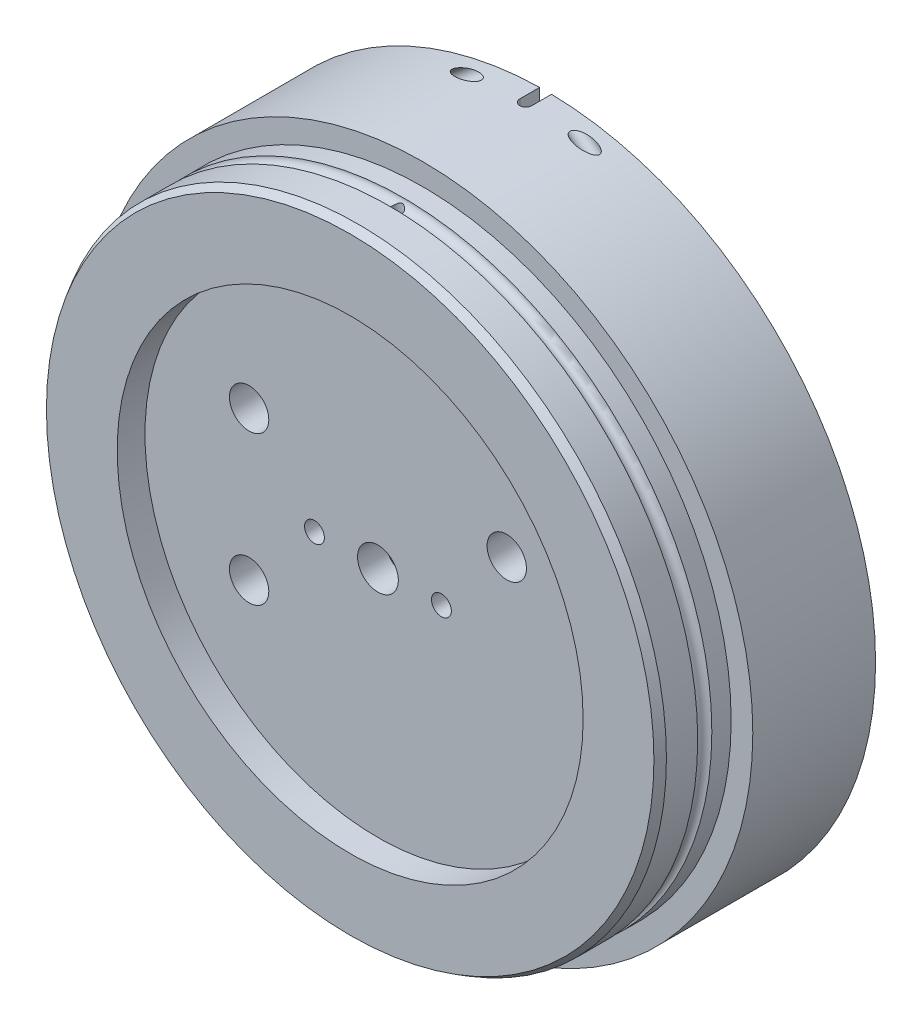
ISO-10303-21;
HEADER;
FILE_DESCRIPTION(('STEP AP214'),'2;1');
FILE_NAME('part.step','',(''),(''),'','','');
FILE_SCHEMA(('AUTOMOTIVE_DESIGN { 1 0 10303 214 1 1 1 1 }'));
ENDSEC;
DATA;
#1=APPLICATION_CONTEXT('core data for automotive mechanical design processes');
#2=APPLICATION_PROTOCOL_DEFINITION('international standard','automotive_design',2000,#1);
#3=PRODUCT_CONTEXT('',#1,'mechanical');
#4=PRODUCT('Part','Part','',(#3));
#5=PRODUCT_RELATED_PRODUCT_CATEGORY('part','',(#4));
#6=PRODUCT_DEFINITION_FORMATION('','',#4);
#7=PRODUCT_DEFINITION_CONTEXT('part definition',#1,'design');
#8=PRODUCT_DEFINITION('design','',#6,#7);
#9=PRODUCT_DEFINITION_SHAPE('','',#8);
#10=(LENGTH_UNIT() NAMED_UNIT(*) SI_UNIT(.MILLI.,.METRE.));
#11=(NAMED_UNIT(*) PLANE_ANGLE_UNIT() SI_UNIT($,.RADIAN.));
#12=(NAMED_UNIT(*) SI_UNIT($,.STERADIAN.) SOLID_ANGLE_UNIT());
#13=UNCERTAINTY_MEASURE_WITH_UNIT(LENGTH_MEASURE(1.E-05),#10,'distance_accuracy_value','');
#14=(GEOMETRIC_REPRESENTATION_CONTEXT(3) GLOBAL_UNCERTAINTY_ASSIGNED_CONTEXT((#13)) GLOBAL_UNIT_ASSIGNED_CONTEXT((#10,
#11,#12)) REPRESENTATION_CONTEXT('',''));
#15=CARTESIAN_POINT('',(0.,0.,0.));
#16=DIRECTION('',(0.,0.,1.));
#17=DIRECTION('',(1.,0.,0.));
#18=AXIS2_PLACEMENT_3D('',#15,#16,#17);
#19=CARTESIAN_POINT('',(-83.1850015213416,0.,30.));
#20=DIRECTION('',(0.,0.,-1.));
#21=DIRECTION('',(-1.,0.,0.));
#22=AXIS2_PLACEMENT_3D('',#19,#20,#21);
#23=PLANE('',#22);
#24=CARTESIAN_POINT('',(1.84412953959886E-13,0.,30.));
#25=DIRECTION('',(0.,0.,1.));
#26=DIRECTION('',(1.,0.,0.));
#27=AXIS2_PLACEMENT_3D('',#24,#25,#26);
#28=CIRCLE('',#27,77.7286000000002);
#29=CARTESIAN_POINT('',(77.7286000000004,0.,30.));
#30=VERTEX_POINT('',#29);
#31=EDGE_CURVE('E595',#30,#30,#28,.T.);
#32=ORIENTED_EDGE('',*,*,#31,.F.);
#33=EDGE_LOOP('',(#32));
#34=FACE_BOUND('',#33,.T.);
#35=CARTESIAN_POINT('',(0.,0.,30.));
#36=DIRECTION('',(0.,0.,1.));
#37=DIRECTION('',(1.,0.,0.));
#38=AXIS2_PLACEMENT_3D('',#35,#36,#37);
#39=CIRCLE('',#38,83.1850015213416);
#40=CARTESIAN_POINT('',(83.1850015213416,0.,30.));
#41=VERTEX_POINT('',#40);
#42=EDGE_CURVE('E294',#41,#41,#39,.F.);
#43=ORIENTED_EDGE('',*,*,#42,.F.);
#44=EDGE_LOOP('',(#43));
#45=FACE_BOUND('',#44,.T.);
#46=ADVANCED_FACE('F57',(#34,#45),#23,.F.);
#47=CARTESIAN_POINT('',(-100.,-99.9999999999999,-0.951400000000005));
#48=DIRECTION('',(0.,0.,1.));
#49=DIRECTION('',(1.,0.,0.));
#50=AXIS2_PLACEMENT_3D('',#47,#48,#49);
#51=PLANE('',#50);
#52=DIRECTION('',(0.,1.,0.));
#53=VECTOR('',#52,1.);
#54=CARTESIAN_POINT('',(-1.5,-83.1860015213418,-0.951399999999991));
#55=LINE('',#54,#53);
#56=CARTESIAN_POINT('',(-1.49999999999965,83.1714763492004,-0.951399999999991));
#57=VERTEX_POINT('',#56);
#58=CARTESIAN_POINT('',(-1.5,73.3388623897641,-0.951399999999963));
#59=VERTEX_POINT('',#58);
#60=EDGE_CURVE('E73',#57,#59,#55,.F.);
#61=ORIENTED_EDGE('',*,*,#60,.T.);
#62=CARTESIAN_POINT('',(0.,0.,-0.951399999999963));
#63=DIRECTION('',(0.,0.,1.));
#64=DIRECTION('',(1.,0.,0.));
#65=AXIS2_PLACEMENT_3D('',#62,#63,#64);
#66=CIRCLE('',#65,73.3542005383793);
#67=CARTESIAN_POINT('',(1.5,73.3388623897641,-0.951399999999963));
#68=VERTEX_POINT('',#67);
#69=EDGE_CURVE('E262',#59,#68,#66,.T.);
#70=ORIENTED_EDGE('',*,*,#69,.T.);
#71=DIRECTION('',(0.,1.,0.));
#72=VECTOR('',#71,1.);
#73=CARTESIAN_POINT('',(1.5,-83.1860015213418,-0.951400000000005));
#74=LINE('',#73,#72);
#75=CARTESIAN_POINT('',(1.5,83.1714763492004,-0.951399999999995));
#76=VERTEX_POINT('',#75);
#77=EDGE_CURVE('E497',#68,#76,#74,.T.);
#78=ORIENTED_EDGE('',*,*,#77,.T.);
#79=CARTESIAN_POINT('',(0.,0.,-0.951399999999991));
#80=DIRECTION('',(0.,0.,1.));
#81=DIRECTION('',(1.,0.,0.));
#82=AXIS2_PLACEMENT_3D('',#79,#80,#81);
#83=CIRCLE('',#82,83.1850015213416);
#84=EDGE_CURVE('E600',#57,#76,#83,.T.);
#85=ORIENTED_EDGE('',*,*,#84,.F.);
#86=EDGE_LOOP('',(#61,#70,#78,#85));
#87=FACE_BOUND('',#86,.T.);
#88=ADVANCED_FACE('F586',(#87),#51,.F.);
#89=CARTESIAN_POINT('',(46.4089440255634,55.3080257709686,4.04860000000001));
#90=DIRECTION('',(-0.766044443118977,0.642787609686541,0.));
#91=DIRECTION('',(-0.642787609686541,-0.766044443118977,0.));
#92=AXIS2_PLACEMENT_3D('',#89,#90,#91);
#93=PLANE('',#92);
#94=CARTESIAN_POINT('',(46.4089440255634,55.3080257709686,2.2686));
#95=CARTESIAN_POINT('',(46.4411338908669,55.3463881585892,2.26860033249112));
#96=CARTESIAN_POINT('',(46.4733083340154,55.3847321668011,2.27071469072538));
#97=CARTESIAN_POINT('',(46.5374269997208,55.4611458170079,2.27914972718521));
#98=CARTESIAN_POINT('',(46.569371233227,55.4992154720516,2.28547020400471));
#99=CARTESIAN_POINT('',(46.6644628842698,55.6125412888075,2.31068165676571));
#100=CARTESIAN_POINT('',(46.726973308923,55.6870383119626,2.33582281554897));
#101=CARTESIAN_POINT('',(46.8483909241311,55.8317381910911,2.40207405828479));
#102=CARTESIAN_POINT('',(46.9072964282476,55.9019390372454,2.4431915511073));
#103=CARTESIAN_POINT('',(47.0198312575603,56.0360528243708,2.54022277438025));
#104=CARTESIAN_POINT('',(47.0734616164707,56.0999669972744,2.59613359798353));
#105=CARTESIAN_POINT('',(47.1739270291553,56.2196970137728,2.72116845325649));
#106=CARTESIAN_POINT('',(47.2207619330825,56.2755126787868,2.79029277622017));
#107=CARTESIAN_POINT('',(47.3063152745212,56.3774711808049,2.93980368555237));
#108=CARTESIAN_POINT('',(47.3450324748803,56.423612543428,3.02019198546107));
#109=CARTESIAN_POINT('',(47.4132398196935,56.5048988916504,3.18993667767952));
#110=CARTESIAN_POINT('',(47.4427303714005,56.5400443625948,3.27929267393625));
#111=CARTESIAN_POINT('',(47.4916482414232,56.5983424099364,3.46443302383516));
#112=CARTESIAN_POINT('',(47.5110762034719,56.6214957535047,3.56021696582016));
#113=CARTESIAN_POINT('',(47.5393203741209,56.6551558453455,3.75550173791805));
#114=CARTESIAN_POINT('',(47.5481363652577,56.6656623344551,3.8550026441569));
#115=CARTESIAN_POINT('',(47.5549062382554,56.6737303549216,4.05489635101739));
#116=CARTESIAN_POINT('',(47.552859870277,56.6712915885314,4.15528917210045));
#117=CARTESIAN_POINT('',(47.5379606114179,56.6535353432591,4.35411715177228));
#118=CARTESIAN_POINT('',(47.5251078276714,56.6382179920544,4.45255232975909));
#119=CARTESIAN_POINT('',(47.4889682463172,56.5951485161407,4.64465793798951));
#120=CARTESIAN_POINT('',(47.4656814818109,56.5673964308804,4.73832838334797));
#121=CARTESIAN_POINT('',(47.4093064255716,56.5002112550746,4.91829864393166));
#122=CARTESIAN_POINT('',(47.3762178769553,56.4607778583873,5.00459826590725));
#123=CARTESIAN_POINT('',(47.3200097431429,56.3937916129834,5.12655359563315));
#124=CARTESIAN_POINT('',(47.3001736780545,56.3701519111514,5.16596273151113));
#125=CARTESIAN_POINT('',(47.2584213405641,56.320393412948,5.24208447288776));
#126=CARTESIAN_POINT('',(47.2365030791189,56.2942722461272,5.27879443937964));
#127=CARTESIAN_POINT('',(47.167906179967,56.2125216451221,5.38436073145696));
#128=CARTESIAN_POINT('',(47.1183349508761,56.1534449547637,5.44876273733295));
#129=CARTESIAN_POINT('',(47.012939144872,56.027839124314,5.56368411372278));
#130=CARTESIAN_POINT('',(46.9571148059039,55.9613102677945,5.61420401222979));
#131=CARTESIAN_POINT('',(46.8699109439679,55.8573847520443,5.67851844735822));
#132=CARTESIAN_POINT('',(46.8402324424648,55.8220152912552,5.69806001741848));
#133=CARTESIAN_POINT('',(46.7799390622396,55.7501604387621,5.73317174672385));
#134=CARTESIAN_POINT('',(46.7493249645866,55.7136759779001,5.74874512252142));
#135=CARTESIAN_POINT('',(46.6873952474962,55.6398710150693,5.77580767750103));
#136=CARTESIAN_POINT('',(46.6560803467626,55.6025513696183,5.78730085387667));
#137=CARTESIAN_POINT('',(46.5929453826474,55.5273100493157,5.80614280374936));
#138=CARTESIAN_POINT('',(46.5611254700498,55.4893885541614,5.81349279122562));
#139=CARTESIAN_POINT('',(46.5091876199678,55.4274914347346,5.82203082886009));
#140=CARTESIAN_POINT('',(46.4891527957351,55.4036148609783,5.82449583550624));
#141=CARTESIAN_POINT('',(46.4490606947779,55.3558349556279,5.82777923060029));
#142=CARTESIAN_POINT('',(46.4290035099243,55.3319317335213,5.82860033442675));
#143=CARTESIAN_POINT('',(46.4089440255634,55.3080257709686,5.8286));
#144=B_SPLINE_CURVE_WITH_KNOTS('',3,(#94,#95,#96,#97,#98,#99,#100,#101,#102,#103,#104,#105,#106,
#107,#108,#109,#110,#111,#112,#113,#114,#115,#116,#117,#118,#119,#120,#121,#122,#123,#124,#125,
#126,#127,#128,#129,#130,#131,#132,#133,#134,#135,#136,#137,#138,#139,#140,#141,#142,#143),
.UNSPECIFIED.,.F.,.F.,(4,2,2,2,2,2,2,2,2,2,2,2,2,2,2,2,2,2,2,2,2,2,2,2,4),(0.,0.150143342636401,
0.300279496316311,0.600072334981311,0.900004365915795,1.19987750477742,1.49975725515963,
1.79968267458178,2.09959485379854,2.39948784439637,2.69938698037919,2.99929301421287,
3.29919607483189,3.59909818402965,3.8990081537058,4.04901679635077,4.19917020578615,
4.49907849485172,4.79897537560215,4.94923648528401,5.09937540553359,5.24936683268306,
5.39931428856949,5.49307242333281,5.58667556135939),.UNSPECIFIED.);
#145=CARTESIAN_POINT('',(46.4089440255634,55.3080257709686,2.26860000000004));
#146=VERTEX_POINT('',#145);
#147=CARTESIAN_POINT('',(46.4089440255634,55.3080257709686,5.8286));
#148=VERTEX_POINT('',#147);
#149=EDGE_CURVE('E1200',#146,#148,#144,.T.);
#150=ORIENTED_EDGE('',*,*,#149,.T.);
#151=DIRECTION('',(0.,0.,1.));
#152=VECTOR('',#151,1.);
#153=CARTESIAN_POINT('',(46.4089440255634,55.3080257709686,0.));
#154=LINE('',#153,#152);
#155=CARTESIAN_POINT('',(46.4089440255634,55.3080257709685,5.92820000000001));
#156=VERTEX_POINT('',#155);
#157=EDGE_CURVE('E490',#148,#156,#154,.T.);
#158=ORIENTED_EDGE('',*,*,#157,.T.);
#159=CARTESIAN_POINT('',(46.4089440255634,55.3080257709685,4.04860000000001));
#160=DIRECTION('',(0.766044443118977,-0.64278760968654,0.));
#161=DIRECTION('',(0.64278760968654,0.766044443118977,0.));
#162=AXIS2_PLACEMENT_3D('',#159,#160,#161);
#163=CIRCLE('',#162,1.8796);
#164=CARTESIAN_POINT('',(46.4089440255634,55.3080257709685,2.16900000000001));
#165=VERTEX_POINT('',#164);
#166=EDGE_CURVE('E606',#156,#165,#163,.F.);
#167=ORIENTED_EDGE('',*,*,#166,.T.);
#168=EDGE_CURVE('E81',#165,#146,#154,.T.);
#169=ORIENTED_EDGE('',*,*,#168,.T.);
#170=EDGE_LOOP('',(#150,#158,#167,#169));
#171=FACE_BOUND('',#170,.T.);
#172=ADVANCED_FACE('F390',(#171),#93,.T.);
#173=CARTESIAN_POINT('',(0.,0.,407.444180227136));
#174=DIRECTION('',(0.,0.,1.));
#175=DIRECTION('',(1.,0.,0.));
#176=AXIS2_PLACEMENT_3D('',#173,#174,#175);
#177=CYLINDRICAL_SURFACE('',#176,83.1850015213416);
#178=CARTESIAN_POINT('',(-11.1582406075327,82.433234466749,4.04860000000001));
#179=CARTESIAN_POINT('',(-11.1582465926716,82.4332337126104,4.1083956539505));
#180=CARTESIAN_POINT('',(-11.1635894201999,82.432510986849,4.16827916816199));
#181=CARTESIAN_POINT('',(-11.1844720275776,82.4296801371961,4.28626025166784));
#182=CARTESIAN_POINT('',(-11.2000351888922,82.42756883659,4.34435340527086));
#183=CARTESIAN_POINT('',(-11.239891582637,82.4221433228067,4.45686813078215));
#184=CARTESIAN_POINT('',(-11.264119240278,82.4188381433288,4.51131372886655));
#185=CARTESIAN_POINT('',(-11.3197298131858,82.4112188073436,4.61626429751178));
#186=CARTESIAN_POINT('',(-11.3511128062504,82.4069046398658,4.6667692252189));
#187=CARTESIAN_POINT('',(-11.4434174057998,82.3941507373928,4.7974385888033));
#188=CARTESIAN_POINT('',(-11.5096833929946,82.3849310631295,4.87374599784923));
#189=CARTESIAN_POINT('',(-11.6530121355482,82.3647804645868,5.0152430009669));
#190=CARTESIAN_POINT('',(-11.7301101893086,82.3538439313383,5.08039463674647));
#191=CARTESIAN_POINT('',(-11.879779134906,82.3323764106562,5.19212380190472));
#192=CARTESIAN_POINT('',(-11.9514040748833,82.3220136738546,5.2400250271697));
#193=CARTESIAN_POINT('',(-12.0984579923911,82.3005304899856,5.32945028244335));
#194=CARTESIAN_POINT('',(-12.1738897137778,82.2894094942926,5.37096962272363));
#195=CARTESIAN_POINT('',(-12.3275887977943,82.2665246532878,5.44836917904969));
#196=CARTESIAN_POINT('',(-12.4058594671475,82.2547600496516,5.48424254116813));
#197=CARTESIAN_POINT('',(-12.5644679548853,82.2306820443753,5.55090042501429));
#198=CARTESIAN_POINT('',(-12.6448065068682,82.2183684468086,5.58168311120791));
#199=CARTESIAN_POINT('',(-12.8736149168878,82.1829471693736,5.662044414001));
#200=CARTESIAN_POINT('',(-13.0238754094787,82.1592764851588,5.70630883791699));
#201=CARTESIAN_POINT('',(-13.327445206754,82.1105801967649,5.78183091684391));
#202=CARTESIAN_POINT('',(-13.4807568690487,82.0855535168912,5.81307806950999));
#203=CARTESIAN_POINT('',(-13.7894399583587,82.0342633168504,5.86406853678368));
#204=CARTESIAN_POINT('',(-13.944815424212,82.0079969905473,5.88378425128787));
#205=CARTESIAN_POINT('',(-14.2562990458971,81.9544226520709,5.91257682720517));
#206=CARTESIAN_POINT('',(-14.4124069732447,81.927114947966,5.92165681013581));
#207=CARTESIAN_POINT('',(-14.7376764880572,81.869254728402,5.93012536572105));
#208=CARTESIAN_POINT('',(-14.9068460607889,81.8386210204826,5.92864696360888));
#209=CARTESIAN_POINT('',(-15.2445646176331,81.7763854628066,5.91425152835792));
#210=CARTESIAN_POINT('',(-15.4131134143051,81.7447833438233,5.9013312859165));
#211=CARTESIAN_POINT('',(-15.7480600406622,81.6809159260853,5.86401546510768));
#212=CARTESIAN_POINT('',(-15.9144639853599,81.6486540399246,5.83966917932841));
#213=CARTESIAN_POINT('',(-16.2448878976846,81.5835547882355,5.77894555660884));
#214=CARTESIAN_POINT('',(-16.4089091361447,81.5507177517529,5.74257489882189));
#215=CARTESIAN_POINT('',(-16.7038907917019,81.4907533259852,5.66438507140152));
#216=CARTESIAN_POINT('',(-16.8354410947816,81.4636731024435,5.62475816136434));
#217=CARTESIAN_POINT('',(-17.0957567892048,81.4094423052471,5.53527303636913));
#218=CARTESIAN_POINT('',(-17.2245071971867,81.3822919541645,5.48537011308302));
#219=CARTESIAN_POINT('',(-17.4362248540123,81.3371391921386,5.39163589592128));
#220=CARTESIAN_POINT('',(-17.5205871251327,81.3190057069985,5.35102212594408));
#221=CARTESIAN_POINT('',(-17.6861872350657,81.2831497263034,5.26343166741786));
#222=CARTESIAN_POINT('',(-17.767422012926,81.2654276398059,5.21644893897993));
#223=CARTESIAN_POINT('',(-17.9247738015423,81.2308648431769,5.11542384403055));
#224=CARTESIAN_POINT('',(-18.0009235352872,81.2140186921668,5.06143491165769));
#225=CARTESIAN_POINT('',(-18.1464869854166,81.1816174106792,4.94481332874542));
#226=CARTESIAN_POINT('',(-18.2159170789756,81.1660591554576,4.88220264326));
#227=CARTESIAN_POINT('',(-18.3235717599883,81.1418091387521,4.76872655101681));
#228=CARTESIAN_POINT('',(-18.36459921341,81.1325303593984,4.72066833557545));
#229=CARTESIAN_POINT('',(-18.4402617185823,81.1153667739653,4.61936666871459));
#230=CARTESIAN_POINT('',(-18.4748918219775,81.1074830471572,4.56611925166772));
#231=CARTESIAN_POINT('',(-18.5357878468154,81.0935881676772,4.45364906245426));
#232=CARTESIAN_POINT('',(-18.5619205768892,81.0876068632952,4.39434867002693));
#233=CARTESIAN_POINT('',(-18.6020550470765,81.0784093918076,4.27165136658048));
#234=CARTESIAN_POINT('',(-18.6161130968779,81.0751803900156,4.20827496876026));
#235=CARTESIAN_POINT('',(-18.6248487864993,81.0731736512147,4.12834354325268));
#236=CARTESIAN_POINT('',(-18.6261502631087,81.0728746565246,4.11242801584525));
#237=CARTESIAN_POINT('',(-18.6278906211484,81.072474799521,4.08054419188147));
#238=CARTESIAN_POINT('',(-18.6283293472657,81.0723739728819,4.06457588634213));
#239=CARTESIAN_POINT('',(-18.6283213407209,81.0723758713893,3.99646096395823));
#240=CARTESIAN_POINT('',(-18.6236222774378,81.0734559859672,3.9442411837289));
#241=CARTESIAN_POINT('',(-18.6053334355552,81.0776549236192,3.84142394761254));
#242=CARTESIAN_POINT('',(-18.5917208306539,81.0807789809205,3.79083100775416));
#243=CARTESIAN_POINT('',(-18.5527051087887,81.0897163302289,3.68068266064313));
#244=CARTESIAN_POINT('',(-18.5252539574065,81.0959956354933,3.62189742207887));
#245=CARTESIAN_POINT('',(-18.4615366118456,81.1105246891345,3.50964133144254));
#246=CARTESIAN_POINT('',(-18.4252553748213,81.1187777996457,3.45617977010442));
#247=CARTESIAN_POINT('',(-18.3224028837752,81.1420865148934,3.32366453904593));
#248=CARTESIAN_POINT('',(-18.250804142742,81.1582325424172,3.24874791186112));
#249=CARTESIAN_POINT('',(-18.0977534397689,81.192499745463,3.1103964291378));
#250=CARTESIAN_POINT('',(-18.0162750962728,81.2106261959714,3.04699349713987));
#251=CARTESIAN_POINT('',(-17.8493905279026,81.2474666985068,2.93129419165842));
#252=CARTESIAN_POINT('',(-17.7641528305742,81.2661510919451,2.87874134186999));
#253=CARTESIAN_POINT('',(-17.5895757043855,81.3041161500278,2.78112271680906));
#254=CARTESIAN_POINT('',(-17.5002325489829,81.3233973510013,2.73606392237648));
#255=CARTESIAN_POINT('',(-17.318504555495,81.3622918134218,2.65232948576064));
#256=CARTESIAN_POINT('',(-17.2261146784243,81.3819055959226,2.61366512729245));
#257=CARTESIAN_POINT('',(-17.0391660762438,81.4212529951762,2.54202834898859));
#258=CARTESIAN_POINT('',(-16.9446066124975,81.4409866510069,2.50905790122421));
#259=CARTESIAN_POINT('',(-16.6699354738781,81.4977986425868,2.42146588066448));
#260=CARTESIAN_POINT('',(-16.4877411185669,81.5348636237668,2.3733130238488));
#261=CARTESIAN_POINT('',(-16.1197380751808,81.608417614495,2.29267026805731));
#262=CARTESIAN_POINT('',(-15.9339264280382,81.6449061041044,2.2601938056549));
#263=CARTESIAN_POINT('',(-15.5598542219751,81.7170224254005,2.20977522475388));
#264=CARTESIAN_POINT('',(-15.3715900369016,81.7526486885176,2.19185790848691));
#265=CARTESIAN_POINT('',(-14.9941181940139,81.8227213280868,2.17032394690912));
#266=CARTESIAN_POINT('',(-14.8049110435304,81.8571682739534,2.16670030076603));
#267=CARTESIAN_POINT('',(-14.4594575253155,81.9188243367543,2.17346060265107));
#268=CARTESIAN_POINT('',(-14.3032021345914,81.9462502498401,2.18151782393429));
#269=CARTESIAN_POINT('',(-13.9913471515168,82.0000714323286,2.20820459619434));
#270=CARTESIAN_POINT('',(-13.8357477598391,82.026466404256,2.22683717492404));
#271=CARTESIAN_POINT('',(-13.5268372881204,82.0779724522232,2.27551130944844));
#272=CARTESIAN_POINT('',(-13.3735190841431,82.10308874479,2.30550144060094));
#273=CARTESIAN_POINT('',(-13.0698017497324,82.1519833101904,2.37829105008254));
#274=CARTESIAN_POINT('',(-12.9194001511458,82.1757627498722,2.42107914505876));
#275=CARTESIAN_POINT('',(-12.6593163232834,82.2161728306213,2.50937647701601));
#276=CARTESIAN_POINT('',(-12.5486112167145,82.233137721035,2.55170452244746));
#277=CARTESIAN_POINT('',(-12.331131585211,82.2660303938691,2.64628142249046));
#278=CARTESIAN_POINT('',(-12.2243616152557,82.2819569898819,2.69854136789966));
#279=CARTESIAN_POINT('',(-12.016227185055,82.3126108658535,2.81507861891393));
#280=CARTESIAN_POINT('',(-11.9149099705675,82.3273281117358,2.87944423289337));
#281=CARTESIAN_POINT('',(-11.7222987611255,82.3549729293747,3.02208991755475));
#282=CARTESIAN_POINT('',(-11.6309796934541,82.3679050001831,3.10033382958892));
#283=CARTESIAN_POINT('',(-11.4985248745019,82.3864729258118,3.23777727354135));
#284=CARTESIAN_POINT('',(-11.4521020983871,82.3929347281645,3.29174712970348));
#285=CARTESIAN_POINT('',(-11.3669277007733,82.4047284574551,3.40569321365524));
#286=CARTESIAN_POINT('',(-11.3281787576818,82.410059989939,3.46567152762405));
#287=CARTESIAN_POINT('',(-11.2604673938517,82.4193396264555,3.59214056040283));
#288=CARTESIAN_POINT('',(-11.2316395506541,82.4232687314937,3.65870617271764));
#289=CARTESIAN_POINT('',(-11.1874394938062,82.4292799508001,3.79615489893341));
#290=CARTESIAN_POINT('',(-11.1720129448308,82.431369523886,3.86701932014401));
#291=CARTESIAN_POINT('',(-11.1622283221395,82.4326945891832,3.95685650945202));
#292=CARTESIAN_POINT('',(-11.1607359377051,82.4328966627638,3.97516873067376));
#293=CARTESIAN_POINT('',(-11.1587410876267,82.4331667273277,4.01185119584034));
#294=CARTESIAN_POINT('',(-11.1582387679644,82.433234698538,4.03022144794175));
#295=CARTESIAN_POINT('',(-11.1582406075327,82.433234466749,4.04860000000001));
#296=B_SPLINE_CURVE_WITH_KNOTS('',3,(#178,#179,#180,#181,#182,#183,#184,#185,#186,#187,#188,
#189,#190,#191,#192,#193,#194,#195,#196,#197,#198,#199,#200,#201,#202,#203,#204,#205,#206,#207,
#208,#209,#210,#211,#212,#213,#214,#215,#216,#217,#218,#219,#220,#221,#222,#223,#224,#225,#226,
#227,#228,#229,#230,#231,#232,#233,#234,#235,#236,#237,#238,#239,#240,#241,#242,#243,#244,#245,
#246,#247,#248,#249,#250,#251,#252,#253,#254,#255,#256,#257,#258,#259,#260,#261,#262,#263,#264,
#265,#266,#267,#268,#269,#270,#271,#272,#273,#274,#275,#276,#277,#278,#279,#280,#281,#282,#283,
#284,#285,#286,#287,#288,#289,#290,#291,#292,#293,#294,#295),.UNSPECIFIED.,.T.,.F.,(4,2,2,2,2,2,
2,2,2,2,2,2,2,2,2,2,2,2,2,2,2,2,2,2,2,2,2,2,2,2,2,2,2,2,2,2,2,2,2,2,2,2,2,2,2,2,2,2,2,2,2,2,2,2,
2,2,2,2,4),(0.,0.179310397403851,0.35903244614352,0.537422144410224,0.715813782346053,
1.01851792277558,1.32223240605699,1.58222647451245,1.8424106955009,2.10290837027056,
2.36349976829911,2.83801092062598,3.31290417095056,3.78892945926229,4.2648150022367,
4.78020056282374,5.29573072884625,5.80905703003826,6.32209867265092,6.7418796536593,
7.16352711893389,7.44942911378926,7.73560416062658,8.01971249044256,8.3031099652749,
8.4942941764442,8.68562565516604,8.87982582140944,9.07311534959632,9.12101304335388,
9.16891935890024,9.3252668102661,9.48201621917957,9.67645706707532,9.87123151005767,
10.1841030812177,10.4978293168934,10.802969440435,11.1083922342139,11.4143483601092,
11.720410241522,12.2957172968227,12.871516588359,13.4482947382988,14.0247903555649,
14.5010157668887,14.9773775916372,15.4516078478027,15.9254175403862,16.2842253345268,
16.6434361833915,17.0053768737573,17.3663880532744,17.5803084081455,17.794303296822,
18.011096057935,18.2270056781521,18.2821096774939,18.3372218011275),.UNSPECIFIED.);
#297=CARTESIAN_POINT('',(-11.1582406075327,82.433234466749,4.04860000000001));
#298=VERTEX_POINT('',#297);
#299=EDGE_CURVE('E1309',#298,#298,#296,.T.);
#300=ORIENTED_EDGE('',*,*,#299,.T.);
#301=EDGE_LOOP('',(#300));
#302=FACE_BOUND('',#301,.T.);
#303=DIRECTION('',(0.,0.,1.));
#304=VECTOR('',#303,1.);
#305=CARTESIAN_POINT('',(1.5,83.1714763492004,407.444180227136));
#306=LINE('',#305,#304);
#307=CARTESIAN_POINT('',(1.5,83.1714763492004,4.04860000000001));
#308=VERTEX_POINT('',#307);
#309=EDGE_CURVE('E546',#76,#308,#306,.T.);
#310=ORIENTED_EDGE('',*,*,#309,.T.);
#311=CARTESIAN_POINT('',(1.5,83.1714763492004,4.0486));
#312=CARTESIAN_POINT('',(1.49999972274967,83.1714761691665,4.09079721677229));
#313=CARTESIAN_POINT('',(1.49821827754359,83.1715085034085,4.13297421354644));
#314=CARTESIAN_POINT('',(1.49111139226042,83.1716362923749,4.2170263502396));
#315=CARTESIAN_POINT('',(1.48578612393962,83.1717317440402,4.2589015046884));
#316=CARTESIAN_POINT('',(1.46454445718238,83.172109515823,4.38355550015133));
#317=CARTESIAN_POINT('',(1.44336206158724,83.1724832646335,4.46549920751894));
#318=CARTESIAN_POINT('',(1.38754300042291,83.1734330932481,4.62466430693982));
#319=CARTESIAN_POINT('',(1.35289988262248,83.1740092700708,4.7018834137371));
#320=CARTESIAN_POINT('',(1.27114928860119,83.1752987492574,4.84940253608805));
#321=CARTESIAN_POINT('',(1.22404478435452,83.1760120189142,4.91970419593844));
#322=CARTESIAN_POINT('',(1.11870433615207,83.177495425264,5.05140256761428));
#323=CARTESIAN_POINT('',(1.06046805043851,83.1782655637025,5.11279900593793));
#324=CARTESIAN_POINT('',(0.934489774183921,83.1797761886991,5.22496861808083));
#325=CARTESIAN_POINT('',(0.86674416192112,83.1805166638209,5.2757377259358));
#326=CARTESIAN_POINT('',(0.723664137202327,83.1818844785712,5.36519996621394));
#327=CARTESIAN_POINT('',(0.648326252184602,83.1825117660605,5.40388753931));
#328=CARTESIAN_POINT('',(0.492282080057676,83.1835813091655,5.46802193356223));
#329=CARTESIAN_POINT('',(0.411582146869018,83.1840237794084,5.49348412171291));
#330=CARTESIAN_POINT('',(0.275363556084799,83.1845633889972,5.52414969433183));
#331=CARTESIAN_POINT('',(0.22070242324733,83.1847269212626,5.53330628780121));
#332=CARTESIAN_POINT('',(0.110702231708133,83.1849460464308,5.54553268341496));
#333=CARTESIAN_POINT('',(0.0553631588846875,83.1850016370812,5.54860235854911));
#334=CARTESIAN_POINT('',(-0.0842561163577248,83.1850013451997,5.54859641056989));
#335=CARTESIAN_POINT('',(-0.168568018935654,83.1848721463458,5.54147762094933));
#336=CARTESIAN_POINT('',(-0.33486217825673,83.1843692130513,5.51318041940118));
#337=CARTESIAN_POINT('',(-0.416841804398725,83.1839952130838,5.49198674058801));
#338=CARTESIAN_POINT('',(-0.576048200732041,83.1830450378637,5.43614410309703));
#339=CARTESIAN_POINT('',(-0.65327706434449,83.182468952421,5.40150112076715));
#340=CARTESIAN_POINT('',(-0.800804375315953,83.1811795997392,5.31975054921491));
#341=CARTESIAN_POINT('',(-0.871104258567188,83.1804663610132,5.27264554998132));
#342=CARTESIAN_POINT('',(-1.00281156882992,83.1789828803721,5.16729632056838));
#343=CARTESIAN_POINT('',(-1.06421750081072,83.1782126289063,5.10905022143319));
#344=CARTESIAN_POINT('',(-1.1763844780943,83.176701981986,4.98306901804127));
#345=CARTESIAN_POINT('',(-1.22714470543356,83.1759615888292,4.9153331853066));
#346=CARTESIAN_POINT('',(-1.31658532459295,83.1745940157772,4.77228736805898));
#347=CARTESIAN_POINT('',(-1.35526223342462,83.1739668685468,4.69697520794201));
#348=CARTESIAN_POINT('',(-1.41940552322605,83.1728970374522,4.54093459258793));
#349=CARTESIAN_POINT('',(-1.44487872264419,83.1724542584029,4.46020895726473));
#350=CARTESIAN_POINT('',(-1.47555848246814,83.1719144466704,4.32392266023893));
#351=CARTESIAN_POINT('',(-1.48471885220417,83.1717509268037,4.26921959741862));
#352=CARTESIAN_POINT('',(-1.49693861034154,83.1715315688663,4.15921864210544));
#353=CARTESIAN_POINT('',(-1.50000705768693,83.17147557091,4.1039217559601));
#354=CARTESIAN_POINT('',(-1.5,83.1714763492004,4.04860000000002));
#355=B_SPLINE_CURVE_WITH_KNOTS('',3,(#311,#312,#313,#314,#315,#316,#317,#318,#319,#320,#321,
#322,#323,#324,#325,#326,#327,#328,#329,#330,#331,#332,#333,#334,#335,#336,#337,#338,#339,#340,
#341,#342,#343,#344,#345,#346,#347,#348,#349,#350,#351,#352,#353,#354),.UNSPECIFIED.,.F.,.F.,(4,
2,2,2,2,2,2,2,2,2,2,2,2,2,2,2,2,2,2,2,2,4),(0.,0.126513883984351,0.253021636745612,
0.505633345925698,0.758366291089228,1.01103901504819,1.26371949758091,1.51649647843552,
1.7693896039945,2.02198822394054,2.18794186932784,2.35389897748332,2.6064658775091,
2.85930718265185,3.11203626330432,3.36471286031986,3.61743188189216,3.87017031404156,
4.12298153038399,4.37566206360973,4.54174101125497,4.70757280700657),.UNSPECIFIED.);
#356=CARTESIAN_POINT('',(-1.49999999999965,83.1714763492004,4.04860000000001));
#357=VERTEX_POINT('',#356);
#358=EDGE_CURVE('E525',#308,#357,#355,.T.);
#359=ORIENTED_EDGE('',*,*,#358,.T.);
#360=DIRECTION('',(0.,0.,1.));
#361=VECTOR('',#360,1.);
#362=CARTESIAN_POINT('',(-1.49999999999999,83.1714763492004,407.444180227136));
#363=LINE('',#362,#361);
#364=EDGE_CURVE('E543',#357,#57,#363,.F.);
#365=ORIENTED_EDGE('',*,*,#364,.T.);
#366=ORIENTED_EDGE('',*,*,#84,.T.);
#367=EDGE_LOOP('',(#310,#359,#365,#366));
#368=FACE_BOUND('',#367,.T.);
#369=ORIENTED_EDGE('',*,*,#42,.T.);
#370=EDGE_LOOP('',(#369));
#371=FACE_BOUND('',#370,.T.);
#372=CARTESIAN_POINT('',(18.6283274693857,81.0723744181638,4.04860000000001));
#373=CARTESIAN_POINT('',(18.6283213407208,81.0723758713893,4.1007390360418));
#374=CARTESIAN_POINT('',(18.6236222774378,81.0734559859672,4.15295881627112));
#375=CARTESIAN_POINT('',(18.6053334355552,81.0776549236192,4.25577605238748));
#376=CARTESIAN_POINT('',(18.5917208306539,81.0807789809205,4.30636899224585));
#377=CARTESIAN_POINT('',(18.5527051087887,81.0897163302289,4.41651733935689));
#378=CARTESIAN_POINT('',(18.5252539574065,81.0959956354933,4.47530257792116));
#379=CARTESIAN_POINT('',(18.4615366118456,81.1105246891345,4.58755866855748));
#380=CARTESIAN_POINT('',(18.4252553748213,81.1187777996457,4.64102022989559));
#381=CARTESIAN_POINT('',(18.3224028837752,81.1420865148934,4.77353546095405));
#382=CARTESIAN_POINT('',(18.250804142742,81.1582325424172,4.84845208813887));
#383=CARTESIAN_POINT('',(18.0977534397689,81.192499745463,4.9868035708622));
#384=CARTESIAN_POINT('',(18.0162750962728,81.2106261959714,5.05020650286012));
#385=CARTESIAN_POINT('',(17.8493905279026,81.2474666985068,5.16590580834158));
#386=CARTESIAN_POINT('',(17.7641528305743,81.2661510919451,5.21845865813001));
#387=CARTESIAN_POINT('',(17.5895757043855,81.3041161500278,5.31607728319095));
#388=CARTESIAN_POINT('',(17.500232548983,81.3233973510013,5.36113607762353));
#389=CARTESIAN_POINT('',(17.318504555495,81.3622918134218,5.44487051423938));
#390=CARTESIAN_POINT('',(17.2261146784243,81.3819055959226,5.48353487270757));
#391=CARTESIAN_POINT('',(17.0391660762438,81.4212529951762,5.55517165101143));
#392=CARTESIAN_POINT('',(16.9446066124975,81.4409866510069,5.58814209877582));
#393=CARTESIAN_POINT('',(16.669935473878,81.4977986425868,5.67573411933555));
#394=CARTESIAN_POINT('',(16.4877411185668,81.5348636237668,5.72388697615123));
#395=CARTESIAN_POINT('',(16.1197380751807,81.608417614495,5.80452973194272));
#396=CARTESIAN_POINT('',(15.9339264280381,81.6449061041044,5.83700619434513));
#397=CARTESIAN_POINT('',(15.5598542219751,81.7170224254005,5.88742477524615));
#398=CARTESIAN_POINT('',(15.3715900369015,81.7526486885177,5.90534209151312));
#399=CARTESIAN_POINT('',(14.9941181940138,81.8227213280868,5.9268760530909));
#400=CARTESIAN_POINT('',(14.8049110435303,81.8571682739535,5.93049969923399));
#401=CARTESIAN_POINT('',(14.4594575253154,81.9188243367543,5.92373939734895));
#402=CARTESIAN_POINT('',(14.3032021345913,81.9462502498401,5.91568217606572));
#403=CARTESIAN_POINT('',(13.9913471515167,82.0000714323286,5.88899540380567));
#404=CARTESIAN_POINT('',(13.835747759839,82.026466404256,5.87036282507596));
#405=CARTESIAN_POINT('',(13.5268372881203,82.0779724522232,5.82168869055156));
#406=CARTESIAN_POINT('',(13.373519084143,82.10308874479,5.79169855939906));
#407=CARTESIAN_POINT('',(13.0698017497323,82.1519833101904,5.71890894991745));
#408=CARTESIAN_POINT('',(12.9194001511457,82.1757627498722,5.67612085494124));
#409=CARTESIAN_POINT('',(12.6593163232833,82.2161728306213,5.58782352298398));
#410=CARTESIAN_POINT('',(12.5486112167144,82.233137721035,5.54549547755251));
#411=CARTESIAN_POINT('',(12.3311315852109,82.2660303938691,5.45091857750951));
#412=CARTESIAN_POINT('',(12.2243616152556,82.2819569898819,5.39865863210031));
#413=CARTESIAN_POINT('',(12.0162271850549,82.3126108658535,5.28212138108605));
#414=CARTESIAN_POINT('',(11.9149099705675,82.3273281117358,5.21775576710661));
#415=CARTESIAN_POINT('',(11.7222987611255,82.3549729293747,5.07511008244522));
#416=CARTESIAN_POINT('',(11.630979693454,82.3679050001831,4.99686617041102));
#417=CARTESIAN_POINT('',(11.4985248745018,82.3864729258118,4.85942272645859));
#418=CARTESIAN_POINT('',(11.452102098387,82.3929347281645,4.80545287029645));
#419=CARTESIAN_POINT('',(11.3669277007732,82.4047284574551,4.69150678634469));
#420=CARTESIAN_POINT('',(11.3281787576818,82.410059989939,4.63152847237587));
#421=CARTESIAN_POINT('',(11.2604673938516,82.4193396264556,4.5050594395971));
#422=CARTESIAN_POINT('',(11.231639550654,82.4232687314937,4.43849382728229));
#423=CARTESIAN_POINT('',(11.1874394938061,82.4292799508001,4.30104510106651));
#424=CARTESIAN_POINT('',(11.1720129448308,82.431369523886,4.23018067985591));
#425=CARTESIAN_POINT('',(11.1622283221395,82.4326945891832,4.14034349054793));
#426=CARTESIAN_POINT('',(11.1607359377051,82.4328966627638,4.12203126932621));
#427=CARTESIAN_POINT('',(11.1587410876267,82.4331667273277,4.08534880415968));
#428=CARTESIAN_POINT('',(11.1582387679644,82.433234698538,4.06697855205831));
#429=CARTESIAN_POINT('',(11.1582465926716,82.4332337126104,3.98880434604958));
#430=CARTESIAN_POINT('',(11.1635894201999,82.432510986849,3.92892083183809));
#431=CARTESIAN_POINT('',(11.1844720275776,82.4296801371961,3.81093974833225));
#432=CARTESIAN_POINT('',(11.2000351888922,82.42756883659,3.75284659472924));
#433=CARTESIAN_POINT('',(11.239891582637,82.4221433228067,3.64033186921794));
#434=CARTESIAN_POINT('',(11.2641192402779,82.4188381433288,3.58588627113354));
#435=CARTESIAN_POINT('',(11.3197298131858,82.4112188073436,3.48093570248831));
#436=CARTESIAN_POINT('',(11.3511128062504,82.4069046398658,3.4304307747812));
#437=CARTESIAN_POINT('',(11.4434174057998,82.3941507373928,3.29976141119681));
#438=CARTESIAN_POINT('',(11.5096833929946,82.3849310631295,3.22345400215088));
#439=CARTESIAN_POINT('',(11.653012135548,82.3647804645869,3.08195699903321));
#440=CARTESIAN_POINT('',(11.7301101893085,82.3538439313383,3.01680536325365));
#441=CARTESIAN_POINT('',(11.8797791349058,82.3323764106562,2.90507619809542));
#442=CARTESIAN_POINT('',(11.9514040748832,82.3220136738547,2.85717497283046));
#443=CARTESIAN_POINT('',(12.0984579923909,82.3005304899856,2.7677497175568));
#444=CARTESIAN_POINT('',(12.1738897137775,82.2894094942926,2.7262303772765));
#445=CARTESIAN_POINT('',(12.327588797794,82.2665246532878,2.64883082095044));
#446=CARTESIAN_POINT('',(12.4058594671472,82.2547600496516,2.61295745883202));
#447=CARTESIAN_POINT('',(12.564467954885,82.2306820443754,2.54629957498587));
#448=CARTESIAN_POINT('',(12.6448065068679,82.2183684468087,2.51551688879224));
#449=CARTESIAN_POINT('',(12.8736149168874,82.1829471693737,2.43515558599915));
#450=CARTESIAN_POINT('',(13.0238754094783,82.1592764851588,2.39089116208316));
#451=CARTESIAN_POINT('',(13.3274452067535,82.110580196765,2.31536908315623));
#452=CARTESIAN_POINT('',(13.4807568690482,82.0855535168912,2.28412193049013));
#453=CARTESIAN_POINT('',(13.789439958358,82.0342633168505,2.23313146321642));
#454=CARTESIAN_POINT('',(13.9448154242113,82.0079969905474,2.21341574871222));
#455=CARTESIAN_POINT('',(14.2562990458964,81.954422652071,2.1846231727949));
#456=CARTESIAN_POINT('',(14.412406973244,81.9271149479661,2.17554318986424));
#457=CARTESIAN_POINT('',(14.7376764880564,81.8692547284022,2.16707463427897));
#458=CARTESIAN_POINT('',(14.906846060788,81.8386210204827,2.16855303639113));
#459=CARTESIAN_POINT('',(15.2445646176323,81.7763854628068,2.18294847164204));
#460=CARTESIAN_POINT('',(15.4131134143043,81.7447833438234,2.19586871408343));
#461=CARTESIAN_POINT('',(15.7480600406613,81.6809159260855,2.23318453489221));
#462=CARTESIAN_POINT('',(15.9144639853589,81.6486540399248,2.25753082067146));
#463=CARTESIAN_POINT('',(16.2448878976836,81.5835547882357,2.31825444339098));
#464=CARTESIAN_POINT('',(16.4089091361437,81.5507177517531,2.3546251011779));
#465=CARTESIAN_POINT('',(16.703890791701,81.4907533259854,2.43281492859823));
#466=CARTESIAN_POINT('',(16.8354410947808,81.4636731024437,2.4724418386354));
#467=CARTESIAN_POINT('',(17.0957567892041,81.4094423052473,2.56192696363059));
#468=CARTESIAN_POINT('',(17.2245071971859,81.3822919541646,2.6118298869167));
#469=CARTESIAN_POINT('',(17.4362248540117,81.3371391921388,2.70556410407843));
#470=CARTESIAN_POINT('',(17.5205871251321,81.3190057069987,2.74617787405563));
#471=CARTESIAN_POINT('',(17.6861872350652,81.2831497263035,2.83376833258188));
#472=CARTESIAN_POINT('',(17.7674220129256,81.265427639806,2.88075106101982));
#473=CARTESIAN_POINT('',(17.924773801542,81.230864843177,2.98177615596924));
#474=CARTESIAN_POINT('',(18.0009235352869,81.2140186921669,3.0357650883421));
#475=CARTESIAN_POINT('',(18.1464869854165,81.1816174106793,3.15238667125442));
#476=CARTESIAN_POINT('',(18.2159170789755,81.1660591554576,3.21499735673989));
#477=CARTESIAN_POINT('',(18.3235717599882,81.1418091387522,3.32847344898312));
#478=CARTESIAN_POINT('',(18.3645992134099,81.1325303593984,3.37653166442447));
#479=CARTESIAN_POINT('',(18.4402617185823,81.1153667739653,3.47783333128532));
#480=CARTESIAN_POINT('',(18.4748918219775,81.1074830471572,3.53108074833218));
#481=CARTESIAN_POINT('',(18.5357878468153,81.0935881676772,3.64355093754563));
#482=CARTESIAN_POINT('',(18.5619205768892,81.0876068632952,3.70285132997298));
#483=CARTESIAN_POINT('',(18.6020550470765,81.0784093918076,3.82554863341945));
#484=CARTESIAN_POINT('',(18.6161130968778,81.0751803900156,3.88892503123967));
#485=CARTESIAN_POINT('',(18.6248487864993,81.0731736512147,3.96885645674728));
#486=CARTESIAN_POINT('',(18.6261502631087,81.0728746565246,3.98477198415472));
#487=CARTESIAN_POINT('',(18.6278906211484,81.072474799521,4.01665580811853));
#488=CARTESIAN_POINT('',(18.6283293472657,81.0723739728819,4.03262411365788));
#489=CARTESIAN_POINT('',(18.6283274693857,81.0723744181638,4.04860000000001));
#490=B_SPLINE_CURVE_WITH_KNOTS('',3,(#372,#373,#374,#375,#376,#377,#378,#379,#380,#381,#382,
#383,#384,#385,#386,#387,#388,#389,#390,#391,#392,#393,#394,#395,#396,#397,#398,#399,#400,#401,
#402,#403,#404,#405,#406,#407,#408,#409,#410,#411,#412,#413,#414,#415,#416,#417,#418,#419,#420,
#421,#422,#423,#424,#425,#426,#427,#428,#429,#430,#431,#432,#433,#434,#435,#436,#437,#438,#439,
#440,#441,#442,#443,#444,#445,#446,#447,#448,#449,#450,#451,#452,#453,#454,#455,#456,#457,#458,
#459,#460,#461,#462,#463,#464,#465,#466,#467,#468,#469,#470,#471,#472,#473,#474,#475,#476,#477,
#478,#479,#480,#481,#482,#483,#484,#485,#486,#487,#488,#489),.UNSPECIFIED.,.T.,.F.,(4,2,2,2,2,2,
2,2,2,2,2,2,2,2,2,2,2,2,2,2,2,2,2,2,2,2,2,2,2,2,2,2,2,2,2,2,2,2,2,2,2,2,2,2,2,2,2,2,2,2,2,2,2,2,
2,2,2,2,4),(0.,0.156347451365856,0.313096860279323,0.507537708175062,0.702312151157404,
1.01518372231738,1.32890995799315,1.63405008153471,1.93947287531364,2.24542900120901,
2.55149088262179,3.12679793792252,3.70259722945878,4.27937537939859,4.85587099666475,
5.33209640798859,5.80845823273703,6.28268848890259,6.75649818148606,7.11530597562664,
7.47451682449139,7.8364575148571,8.1974686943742,8.41138904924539,8.62538393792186,
8.84217669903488,9.05808631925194,9.11319031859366,9.16830244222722,9.34761283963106,
9.52733488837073,9.70572458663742,9.88411622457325,10.1868203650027,10.4905348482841,
10.7505289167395,11.0107131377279,11.2712108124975,11.531802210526,12.0063133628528,
12.4812066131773,12.9572319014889,13.4331174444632,13.9485030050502,14.4640331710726,
14.9773594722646,15.4904011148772,15.9101820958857,16.3318295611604,16.6177315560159,
16.9039066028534,17.1880149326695,17.471412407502,17.6625966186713,17.8539280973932,
18.0481282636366,18.2414177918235,18.2893154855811,18.3372218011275),.UNSPECIFIED.);
#491=CARTESIAN_POINT('',(18.6283274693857,81.0723744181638,4.04860000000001));
#492=VERTEX_POINT('',#491);
#493=EDGE_CURVE('E612',#492,#492,#490,.T.);
#494=ORIENTED_EDGE('',*,*,#493,.T.);
#495=EDGE_LOOP('',(#494));
#496=FACE_BOUND('',#495,.T.);
#497=ADVANCED_FACE('F379',(#302,#368,#371,#496),#177,.T.);
#498=CARTESIAN_POINT('',(-106.799944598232,183.865547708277,4.04860000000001));
#499=DIRECTION('',(0.766044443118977,-0.64278760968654,0.));
#500=DIRECTION('',(0.64278760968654,0.766044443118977,0.));
#501=AXIS2_PLACEMENT_3D('',#498,#499,#500);
#502=CYLINDRICAL_SURFACE('',#501,1.8796);
#503=ORIENTED_EDGE('',*,*,#493,.F.);
#504=EDGE_LOOP('',(#503));
#505=FACE_BOUND('',#504,.T.);
#506=CARTESIAN_POINT('',(46.4089440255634,55.3080257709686,5.92820000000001));
#507=CARTESIAN_POINT('',(45.9288451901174,55.7108766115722,5.92819854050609));
#508=CARTESIAN_POINT('',(45.443502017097,56.1074747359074,5.92825117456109));
#509=CARTESIAN_POINT('',(44.4625039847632,56.8880175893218,5.92782992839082));
#510=CARTESIAN_POINT('',(43.9668461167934,57.2719585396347,5.92735589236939));
#511=CARTESIAN_POINT('',(43.0947167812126,57.9295239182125,5.92437859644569));
#512=CARTESIAN_POINT('',(42.7204488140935,58.2060786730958,5.92242977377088));
#513=CARTESIAN_POINT('',(41.9666317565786,58.7519034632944,5.91589665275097));
#514=CARTESIAN_POINT('',(41.5870824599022,59.0211732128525,5.91131225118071));
#515=CARTESIAN_POINT('',(40.8229492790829,59.5522549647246,5.89780750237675));
#516=CARTESIAN_POINT('',(40.4383660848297,59.8140679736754,5.88888774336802));
#517=CARTESIAN_POINT('',(39.6643740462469,60.33010468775,5.86445806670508));
#518=CARTESIAN_POINT('',(39.2749656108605,60.5843290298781,5.84894870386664));
#519=CARTESIAN_POINT('',(38.5942258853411,61.01943336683,5.8135800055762));
#520=CARTESIAN_POINT('',(38.3039151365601,61.2020864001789,5.79592336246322));
#521=CARTESIAN_POINT('',(37.7210317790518,61.5630497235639,5.75363271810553));
#522=CARTESIAN_POINT('',(37.4284588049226,61.741359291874,5.72899756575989));
#523=CARTESIAN_POINT('',(36.8411466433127,62.0935990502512,5.67043821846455));
#524=CARTESIAN_POINT('',(36.5464055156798,62.267524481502,5.63650436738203));
#525=CARTESIAN_POINT('',(36.1034993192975,62.5246694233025,5.57603298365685));
#526=CARTESIAN_POINT('',(35.9557569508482,62.6097462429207,5.55428531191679));
#527=CARTESIAN_POINT('',(35.6601419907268,62.7785874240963,5.5069560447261));
#528=CARTESIAN_POINT('',(35.5122694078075,62.8623518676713,5.48137468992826));
#529=CARTESIAN_POINT('',(35.2129420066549,63.0305219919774,5.42486656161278));
#530=CARTESIAN_POINT('',(35.0614889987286,63.1148923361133,5.39382328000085));
#531=CARTESIAN_POINT('',(34.7589499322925,63.2820123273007,5.3255676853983));
#532=CARTESIAN_POINT('',(34.60786413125,63.3647610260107,5.28835187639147));
#533=CARTESIAN_POINT('',(34.3069539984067,63.5281822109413,5.20594494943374));
#534=CARTESIAN_POINT('',(34.1571282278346,63.6088573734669,5.16076477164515));
#535=CARTESIAN_POINT('',(33.9342723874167,63.7278593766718,5.08461513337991));
#536=CARTESIAN_POINT('',(33.8603343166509,63.767174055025,5.05784952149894));
#537=CARTESIAN_POINT('',(33.7133716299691,63.8449941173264,5.00087797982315));
#538=CARTESIAN_POINT('',(33.6403467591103,63.8834997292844,4.97067303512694));
#539=CARTESIAN_POINT('',(33.5219354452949,63.9456828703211,4.91767131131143));
#540=CARTESIAN_POINT('',(33.4761355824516,63.9696707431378,4.8961636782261));
#541=CARTESIAN_POINT('',(33.3852825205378,64.0171331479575,4.85104592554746));
#542=CARTESIAN_POINT('',(33.3402295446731,64.0406075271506,4.82743519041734));
#543=CARTESIAN_POINT('',(33.251331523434,64.0868102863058,4.777769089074));
#544=CARTESIAN_POINT('',(33.2074828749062,64.1095409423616,4.75172235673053));
#545=CARTESIAN_POINT('',(33.1213136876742,64.1541014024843,4.6965415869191));
#546=CARTESIAN_POINT('',(33.0789921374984,64.1759318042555,4.66740964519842));
#547=CARTESIAN_POINT('',(33.0039970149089,64.2145266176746,4.61078242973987));
#548=CARTESIAN_POINT('',(32.9709519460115,64.2314986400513,4.58392675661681));
#549=CARTESIAN_POINT('',(32.9070324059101,64.2642693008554,4.52684974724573));
#550=CARTESIAN_POINT('',(32.8761639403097,64.2800646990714,4.49661965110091));
#551=CARTESIAN_POINT('',(32.8175116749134,64.310028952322,4.43161396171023));
#552=CARTESIAN_POINT('',(32.7897777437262,64.3241716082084,4.39678006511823));
#553=CARTESIAN_POINT('',(32.740272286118,64.3493833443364,4.3221254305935));
#554=CARTESIAN_POINT('',(32.7184687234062,64.3604689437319,4.28233325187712));
#555=CARTESIAN_POINT('',(32.6919822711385,64.3739249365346,4.21674135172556));
#556=CARTESIAN_POINT('',(32.6840023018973,64.3779763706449,4.19263157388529));
#557=CARTESIAN_POINT('',(32.6716421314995,64.3842500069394,4.14327437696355));
#558=CARTESIAN_POINT('',(32.667257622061,64.3864743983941,4.1180283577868));
#559=CARTESIAN_POINT('',(32.6625576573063,64.3888587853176,4.06691734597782));
#560=CARTESIAN_POINT('',(32.6622634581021,64.3890079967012,4.04104981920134));
#561=CARTESIAN_POINT('',(32.6658347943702,64.3871962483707,3.9896754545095));
#562=CARTESIAN_POINT('',(32.669703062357,64.3852339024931,3.96416886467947));
#563=CARTESIAN_POINT('',(32.6821041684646,64.3789400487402,3.91013134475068));
#564=CARTESIAN_POINT('',(32.6913011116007,64.3742711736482,3.88179544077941));
#565=CARTESIAN_POINT('',(32.7136547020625,64.3629144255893,3.82717488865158));
#566=CARTESIAN_POINT('',(32.7268188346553,64.3562227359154,3.80089423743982));
#567=CARTESIAN_POINT('',(32.7649656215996,64.3368130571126,3.73510827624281));
#568=CARTESIAN_POINT('',(32.7922590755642,64.3229090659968,3.69731550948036));
#569=CARTESIAN_POINT('',(32.8513434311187,64.2927534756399,3.62653231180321));
#570=CARTESIAN_POINT('',(32.8831470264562,64.2764952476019,3.59355598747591));
#571=CARTESIAN_POINT('',(32.9612542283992,64.2364853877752,3.52049909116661));
#572=CARTESIAN_POINT('',(33.0087150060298,64.2121136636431,3.48201644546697));
#573=CARTESIAN_POINT('',(33.1066087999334,64.1616965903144,3.41020759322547));
#574=CARTESIAN_POINT('',(33.1570477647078,64.135647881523,3.37689222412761));
#575=CARTESIAN_POINT('',(33.2600376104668,64.0822992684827,3.31408070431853));
#576=CARTESIAN_POINT('',(33.3125984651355,64.0549933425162,3.28460625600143));
#577=CARTESIAN_POINT('',(33.418894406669,63.9996007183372,3.22887361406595));
#578=CARTESIAN_POINT('',(33.4726282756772,63.9715148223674,3.20261225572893));
#579=CARTESIAN_POINT('',(33.6251841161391,63.8915261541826,3.13224791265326));
#580=CARTESIAN_POINT('',(33.7249858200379,63.8389071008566,3.09109189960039));
#581=CARTESIAN_POINT('',(33.9261652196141,63.7322219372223,3.01490233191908));
#582=CARTESIAN_POINT('',(34.0275438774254,63.6781549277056,2.97987268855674));
#583=CARTESIAN_POINT('',(34.2314263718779,63.5687868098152,2.91449937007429));
#584=CARTESIAN_POINT('',(34.3339321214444,63.5134833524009,2.88416567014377));
#585=CARTESIAN_POINT('',(34.5394960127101,63.4019298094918,2.82732882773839));
#586=CARTESIAN_POINT('',(34.6425542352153,63.3456795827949,2.80082626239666));
#587=CARTESIAN_POINT('',(34.9523412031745,63.1756055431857,2.72598922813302));
#588=CARTESIAN_POINT('',(35.159528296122,63.0605409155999,2.68237225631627));
#589=CARTESIAN_POINT('',(35.573753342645,62.8277987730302,2.60426326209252));
#590=CARTESIAN_POINT('',(35.7807911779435,62.7101245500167,2.56976038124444));
#591=CARTESIAN_POINT('',(36.2313324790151,62.4510797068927,2.5021651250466));
#592=CARTESIAN_POINT('',(36.4747575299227,62.309224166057,2.47042050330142));
#593=CARTESIAN_POINT('',(36.9606221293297,62.0222530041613,2.41423250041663));
#594=CARTESIAN_POINT('',(37.2030612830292,61.877136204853,2.38979180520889));
#595=CARTESIAN_POINT('',(37.68605297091,61.584160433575,2.34667923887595));
#596=CARTESIAN_POINT('',(37.9266084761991,61.4363081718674,2.32799483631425));
#597=CARTESIAN_POINT('',(38.4061571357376,61.1376698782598,2.29514165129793));
#598=CARTESIAN_POINT('',(38.6451504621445,60.9868841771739,2.28097236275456));
#599=CARTESIAN_POINT('',(39.1471197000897,60.6660435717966,2.25489566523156));
#600=CARTESIAN_POINT('',(39.4099075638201,60.4956618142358,2.24339598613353));
#601=CARTESIAN_POINT('',(39.9333377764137,60.1514294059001,2.22381249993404));
#602=CARTESIAN_POINT('',(40.1939800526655,59.9775786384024,2.21572880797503));
#603=CARTESIAN_POINT('',(40.7131822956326,59.6263606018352,2.20217401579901));
#604=CARTESIAN_POINT('',(40.9717408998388,59.4489912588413,2.19670450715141));
#605=CARTESIAN_POINT('',(41.4865490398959,59.0908822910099,2.1877285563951));
#606=CARTESIAN_POINT('',(41.7427985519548,58.910142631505,2.18422213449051));
#607=CARTESIAN_POINT('',(42.3762976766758,58.4571093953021,2.17726720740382));
#608=CARTESIAN_POINT('',(42.7521274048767,58.1828141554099,2.17466693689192));
#609=CARTESIAN_POINT('',(43.4984242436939,57.6270021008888,2.17117889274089));
#610=CARTESIAN_POINT('',(43.868891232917,57.3454851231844,2.17029115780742));
#611=CARTESIAN_POINT('',(44.6042639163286,56.775380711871,2.16925759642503));
#612=CARTESIAN_POINT('',(44.9691703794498,56.4867942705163,2.16911166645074));
#613=CARTESIAN_POINT('',(45.6933280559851,55.9026295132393,2.16898512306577));
#614=CARTESIAN_POINT('',(46.0525793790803,55.6070513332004,2.16900450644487));
#615=CARTESIAN_POINT('',(46.8891557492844,54.9050801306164,2.16899392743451));
#616=CARTESIAN_POINT('',(47.3641257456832,54.4958746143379,2.16894447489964));
#617=CARTESIAN_POINT('',(48.3031528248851,53.6653153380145,2.16937462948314));
#618=CARTESIAN_POINT('',(48.7672119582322,53.2439638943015,2.16985413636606));
#619=CARTESIAN_POINT('',(49.6846384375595,52.3889114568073,2.17325336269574));
#620=CARTESIAN_POINT('',(50.1379953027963,51.9551992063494,2.17617537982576));
#621=CARTESIAN_POINT('',(50.8094465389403,51.2958709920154,2.18486390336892));
#622=CARTESIAN_POINT('',(51.0318582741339,51.0746087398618,2.18847833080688));
#623=CARTESIAN_POINT('',(51.4737570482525,50.6292261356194,2.19771357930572));
#624=CARTESIAN_POINT('',(51.6932441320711,50.4051058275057,2.20333436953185));
#625=CARTESIAN_POINT('',(52.1297096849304,49.9535782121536,2.21725970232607));
#626=CARTESIAN_POINT('',(52.3466817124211,49.7261648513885,2.22557001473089));
#627=CARTESIAN_POINT('',(52.7775580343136,49.2686098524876,2.24569106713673));
#628=CARTESIAN_POINT('',(52.9914624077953,49.0384682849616,2.2575017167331));
#629=CARTESIAN_POINT('',(53.4160250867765,48.5756587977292,2.2856321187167));
#630=CARTESIAN_POINT('',(53.6266847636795,48.3429920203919,2.30194990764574));
#631=CARTESIAN_POINT('',(54.0447089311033,47.875208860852,2.34039567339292));
#632=CARTESIAN_POINT('',(54.2520736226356,47.6400926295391,2.36252329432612));
#633=CARTESIAN_POINT('',(54.6640872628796,47.1667694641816,2.41440235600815));
#634=CARTESIAN_POINT('',(54.8687235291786,46.9285543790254,2.4441813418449));
#635=CARTESIAN_POINT('',(55.1728785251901,46.5697959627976,2.4964470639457));
#636=CARTESIAN_POINT('',(55.2738387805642,46.4499198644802,2.51514463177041));
#637=CARTESIAN_POINT('',(55.4747311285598,46.2098095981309,2.55551764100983));
#638=CARTESIAN_POINT('',(55.5746632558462,46.0895754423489,2.57719298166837));
#639=CARTESIAN_POINT('',(55.7730619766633,45.8492916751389,2.62398954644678));
#640=CARTESIAN_POINT('',(55.871532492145,45.7292429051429,2.64909836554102));
#641=CARTESIAN_POINT('',(56.0672292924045,45.4890930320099,2.70354584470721));
#642=CARTESIAN_POINT('',(56.1644556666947,45.3689919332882,2.732884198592));
#643=CARTESIAN_POINT('',(56.3573396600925,45.1291670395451,2.79676466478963));
#644=CARTESIAN_POINT('',(56.4529991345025,45.0094429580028,2.8313000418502));
#645=CARTESIAN_POINT('',(56.6425163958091,44.7707083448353,2.90705472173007));
#646=CARTESIAN_POINT('',(56.7363748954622,44.6516975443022,2.94827131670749));
#647=CARTESIAN_POINT('',(56.8754389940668,44.4742388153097,3.016967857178));
#648=CARTESIAN_POINT('',(56.921560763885,44.4151918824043,3.04104503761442));
#649=CARTESIAN_POINT('',(57.0130637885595,44.2976737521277,3.09196589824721));
#650=CARTESIAN_POINT('',(57.0584447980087,44.2392027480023,3.11881047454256));
#651=CARTESIAN_POINT('',(57.1482469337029,44.1231351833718,3.17589014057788));
#652=CARTESIAN_POINT('',(57.1926677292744,44.0655389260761,3.20612637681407));
#653=CARTESIAN_POINT('',(57.2801524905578,43.951758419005,3.27087229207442));
#654=CARTESIAN_POINT('',(57.3232173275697,43.8955732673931,3.30537915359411));
#655=CARTESIAN_POINT('',(57.4075864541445,43.7851764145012,3.38023892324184));
#656=CARTESIAN_POINT('',(57.4488799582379,43.7309770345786,3.42062244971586));
#657=CARTESIAN_POINT('',(57.5280884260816,43.626724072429,3.50920025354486));
#658=CARTESIAN_POINT('',(57.5660167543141,43.576654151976,3.55736127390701));
#659=CARTESIAN_POINT('',(57.6162744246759,43.5101529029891,3.63530289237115));
#660=CARTESIAN_POINT('',(57.6311766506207,43.4904106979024,3.66055282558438));
#661=CARTESIAN_POINT('',(57.6591533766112,43.4533124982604,3.71380062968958));
#662=CARTESIAN_POINT('',(57.672225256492,43.4359599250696,3.74180234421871));
#663=CARTESIAN_POINT('',(57.6958928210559,43.4045175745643,3.80129002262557));
#664=CARTESIAN_POINT('',(57.7064448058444,43.3904854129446,3.83282522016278));
#665=CARTESIAN_POINT('',(57.7235359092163,43.3677462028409,3.8987519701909));
#666=CARTESIAN_POINT('',(57.7300930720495,43.3590152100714,3.93312987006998));
#667=CARTESIAN_POINT('',(57.7368125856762,43.3500668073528,3.99238019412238));
#668=CARTESIAN_POINT('',(57.7383403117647,43.3480317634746,4.01682683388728));
#669=CARTESIAN_POINT('',(57.7388408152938,43.3473651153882,4.06579862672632));
#670=CARTESIAN_POINT('',(57.7378137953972,43.3487332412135,4.09032377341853));
#671=CARTESIAN_POINT('',(57.7333231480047,43.3547138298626,4.13863984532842));
#672=CARTESIAN_POINT('',(57.7298682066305,43.3593147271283,4.16243307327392));
#673=CARTESIAN_POINT('',(57.7208603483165,43.3713054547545,4.20888389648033));
#674=CARTESIAN_POINT('',(57.7153056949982,43.3786975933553,4.23154053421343));
#675=CARTESIAN_POINT('',(57.6987160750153,43.4007632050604,4.28844016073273));
#676=CARTESIAN_POINT('',(57.6863815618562,43.4171591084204,4.32162860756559));
#677=CARTESIAN_POINT('',(57.658815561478,43.4537606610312,4.38451749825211));
#678=CARTESIAN_POINT('',(57.6435750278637,43.4739782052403,4.41420656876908));
#679=CARTESIAN_POINT('',(57.6117842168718,43.5160980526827,4.46942411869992));
#680=CARTESIAN_POINT('',(57.5953066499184,43.5379059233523,4.49506854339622));
#681=CARTESIAN_POINT('',(57.5610755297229,43.5831526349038,4.5439747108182));
#682=CARTESIAN_POINT('',(57.5433207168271,43.6065930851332,4.56723404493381));
#683=CARTESIAN_POINT('',(57.4886230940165,43.6787092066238,4.63409959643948));
#684=CARTESIAN_POINT('',(57.4503011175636,43.7291080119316,4.67470680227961));
#685=CARTESIAN_POINT('',(57.3777879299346,43.8241972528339,4.74417133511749));
#686=CARTESIAN_POINT('',(57.3439014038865,43.8685305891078,4.77387133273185));
#687=CARTESIAN_POINT('',(57.2750426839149,43.9583949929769,4.8300503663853));
#688=CARTESIAN_POINT('',(57.2400702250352,44.0039263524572,4.85652860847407));
#689=CARTESIAN_POINT('',(57.1338255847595,44.1418989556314,4.93218778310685));
#690=CARTESIAN_POINT('',(57.0613599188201,44.2355431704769,4.97747294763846));
#691=CARTESIAN_POINT('',(56.9140688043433,44.4248924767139,5.06099274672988));
#692=CARTESIAN_POINT('',(56.8392329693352,44.5206058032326,5.09918914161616));
#693=CARTESIAN_POINT('',(56.7259257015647,44.6647611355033,5.15229301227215));
#694=CARTESIAN_POINT('',(56.688004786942,44.7128805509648,5.16928663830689));
#695=CARTESIAN_POINT('',(56.6118372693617,44.8092786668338,5.20204252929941));
#696=CARTESIAN_POINT('',(56.5735906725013,44.8575573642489,5.21780481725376));
#697=CARTESIAN_POINT('',(56.4489257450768,45.0145067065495,5.26721712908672));
#698=CARTESIAN_POINT('',(56.3619165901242,45.1234052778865,5.2986601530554));
#699=CARTESIAN_POINT('',(56.1866867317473,45.3414115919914,5.35717557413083));
#700=CARTESIAN_POINT('',(56.0984658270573,45.4505193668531,5.38424723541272));
#701=CARTESIAN_POINT('',(55.9209336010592,45.6687725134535,5.43480910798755));
#702=CARTESIAN_POINT('',(55.8316217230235,45.7779178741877,5.45829740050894));
#703=CARTESIAN_POINT('',(55.6520571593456,45.9960465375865,5.50225195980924));
#704=CARTESIAN_POINT('',(55.5618044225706,46.1050298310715,5.52271806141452));
#705=CARTESIAN_POINT('',(55.2893099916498,46.4321079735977,5.58036414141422));
#706=CARTESIAN_POINT('',(55.1057635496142,46.6498005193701,5.61367394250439));
#707=CARTESIAN_POINT('',(54.7356554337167,47.0835120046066,5.67254442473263));
#708=CARTESIAN_POINT('',(54.54909466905,47.2995314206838,5.69810739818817));
#709=CARTESIAN_POINT('',(54.1730579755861,47.7297520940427,5.7432183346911));
#710=CARTESIAN_POINT('',(53.9835812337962,47.9439528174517,5.76276458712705));
#711=CARTESIAN_POINT('',(53.6018939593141,48.3703074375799,5.79710590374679));
#712=CARTESIAN_POINT('',(53.4096832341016,48.582461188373,5.8119006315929));
#713=CARTESIAN_POINT('',(53.0228940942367,49.0043088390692,5.83769756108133));
#714=CARTESIAN_POINT('',(52.8283191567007,49.2140056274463,5.84870476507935));
#715=CARTESIAN_POINT('',(52.4366210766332,49.6311437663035,5.86773202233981));
#716=CARTESIAN_POINT('',(52.2394979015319,49.8385850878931,5.87575203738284));
#717=CARTESIAN_POINT('',(51.8183149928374,50.276568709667,5.89028928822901));
#718=CARTESIAN_POINT('',(51.5939292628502,50.5068076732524,5.8964995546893));
#719=CARTESIAN_POINT('',(51.1420780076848,50.9642917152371,5.90670072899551));
#720=CARTESIAN_POINT('',(50.9146124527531,51.191536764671,5.91069161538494));
#721=CARTESIAN_POINT('',(50.2275129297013,51.8688589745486,5.92028728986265));
#722=CARTESIAN_POINT('',(49.7633262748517,52.3143670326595,5.92351080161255));
#723=CARTESIAN_POINT('',(48.8239929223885,53.1920863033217,5.927259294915));
#724=CARTESIAN_POINT('',(48.3488655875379,53.6243182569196,5.92778872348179));
#725=CARTESIAN_POINT('',(47.3873078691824,54.4758958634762,5.92825978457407));
#726=CARTESIAN_POINT('',(46.9008790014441,54.8952432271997,5.92820149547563));
#727=CARTESIAN_POINT('',(46.4089440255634,55.3080257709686,5.92820000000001));
#728=B_SPLINE_CURVE_WITH_KNOTS('',3,(#506,#507,#508,#509,#510,#511,#512,#513,#514,#515,#516,
#517,#518,#519,#520,#521,#522,#523,#524,#525,#526,#527,#528,#529,#530,#531,#532,#533,#534,#535,
#536,#537,#538,#539,#540,#541,#542,#543,#544,#545,#546,#547,#548,#549,#550,#551,#552,#553,#554,
#555,#556,#557,#558,#559,#560,#561,#562,#563,#564,#565,#566,#567,#568,#569,#570,#571,#572,#573,
#574,#575,#576,#577,#578,#579,#580,#581,#582,#583,#584,#585,#586,#587,#588,#589,#590,#591,#592,
#593,#594,#595,#596,#597,#598,#599,#600,#601,#602,#603,#604,#605,#606,#607,#608,#609,#610,#611,
#612,#613,#614,#615,#616,#617,#618,#619,#620,#621,#622,#623,#624,#625,#626,#627,#628,#629,#630,
#631,#632,#633,#634,#635,#636,#637,#638,#639,#640,#641,#642,#643,#644,#645,#646,#647,#648,#649,
#650,#651,#652,#653,#654,#655,#656,#657,#658,#659,#660,#661,#662,#663,#664,#665,#666,#667,#668,
#669,#670,#671,#672,#673,#674,#675,#676,#677,#678,#679,#680,#681,#682,#683,#684,#685,#686,#687,
#688,#689,#690,#691,#692,#693,#694,#695,#696,#697,#698,#699,#700,#701,#702,#703,#704,#705,#706,
#707,#708,#709,#710,#711,#712,#713,#714,#715,#716,#717,#718,#719,#720,#721,#722,#723,#724,#725,
#726,#727),.UNSPECIFIED.,.T.,.F.,(4,2,2,2,2,2,2,2,2,2,2,2,2,2,2,2,2,2,2,2,2,2,2,2,2,2,2,2,2,2,2,
2,2,2,2,2,2,2,2,2,2,2,2,2,2,2,2,2,2,2,2,2,2,2,2,2,2,2,2,2,2,2,2,2,2,2,2,2,2,2,2,2,2,2,2,2,2,2,2,
2,2,2,2,2,2,2,2,2,2,2,2,2,2,2,2,2,2,2,2,2,2,2,2,2,2,2,2,2,2,2,4),(0.,1.88011974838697,
3.76079580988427,5.15680027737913,6.55285942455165,7.94872920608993,9.34448148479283,
10.3747285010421,11.4051455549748,12.4366367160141,12.9522051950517,13.4677413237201,
13.9960217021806,14.5246023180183,15.0524624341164,15.3161512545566,15.5797647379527,
15.7477185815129,15.9157217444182,16.083150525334,16.250466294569,16.3878487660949,
16.5255965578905,16.6652948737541,16.8042228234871,16.8810903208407,16.957865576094,
17.0350396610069,17.112264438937,17.2022259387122,17.2923582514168,17.4374739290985,
17.5830064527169,17.7798811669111,17.9771633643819,18.1755159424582,18.3736715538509,
18.7336761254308,19.0939097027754,19.4548982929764,19.8159412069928,20.5385687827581,
21.2603315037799,22.1107520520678,22.9614849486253,23.8103524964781,24.6591248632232,
25.5992735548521,26.539453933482,27.4802059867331,28.4209677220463,29.8167317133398,
31.2125272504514,32.6081279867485,34.0037016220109,35.8842776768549,37.7644974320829,
39.6464879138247,40.5877018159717,41.5289012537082,42.4721333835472,43.4153411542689,
44.3581386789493,45.3008784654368,46.2470608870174,46.720550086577,47.1940232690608,
47.6658289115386,48.137600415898,48.6087656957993,49.0797404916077,49.3157955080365,
49.5519272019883,49.7881389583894,50.0241956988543,50.2615295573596,50.4978742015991,
50.6037443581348,50.7097645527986,50.8175079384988,50.9247609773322,50.9981512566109,
51.0715357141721,51.1446589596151,51.21784280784,51.3342230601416,51.4509716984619,
51.5632398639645,51.6756203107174,51.9007518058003,52.0902934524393,52.2798817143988,
52.6598089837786,53.0417296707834,53.2324544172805,53.423175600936,53.8517484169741,
54.2803932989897,54.7092669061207,55.1381639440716,55.9980383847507,56.8576581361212,
57.7175220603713,58.5774468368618,59.4362314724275,60.2950270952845,61.2596503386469,
62.224282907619,64.1541978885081,66.0809262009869,68.0073975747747),.UNSPECIFIED.);
#729=CARTESIAN_POINT('',(38.8833150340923,60.8346579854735,5.8286));
#730=VERTEX_POINT('',#729);
#731=EDGE_CURVE('E65',#156,#730,#728,.T.);
#732=ORIENTED_EDGE('',*,*,#731,.T.);
#733=CARTESIAN_POINT('',(38.8833150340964,60.8346579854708,5.8286));
#734=CARTESIAN_POINT('',(38.7695531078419,60.9301064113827,5.82859569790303));
#735=CARTESIAN_POINT('',(38.6552167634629,61.0248650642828,5.82829102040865));
#736=CARTESIAN_POINT('',(38.4255363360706,61.2131435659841,5.82713101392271));
#737=CARTESIAN_POINT('',(38.3101922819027,61.3066634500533,5.82627570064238));
#738=CARTESIAN_POINT('',(37.9628752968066,61.5855641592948,5.82295916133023));
#739=CARTESIAN_POINT('',(37.7295930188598,61.7693065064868,5.81974731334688));
#740=CARTESIAN_POINT('',(37.2603127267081,62.1331828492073,5.81144124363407));
#741=CARTESIAN_POINT('',(37.0243150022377,62.3133172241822,5.80634722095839));
#742=CARTESIAN_POINT('',(36.5500580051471,62.6705301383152,5.7942055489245));
#743=CARTESIAN_POINT('',(36.3117986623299,62.8476085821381,5.78715783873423));
#744=CARTESIAN_POINT('',(35.8458120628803,63.1899278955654,5.77134101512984));
#745=CARTESIAN_POINT('',(35.6181814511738,63.3553054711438,5.76268048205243));
#746=CARTESIAN_POINT('',(35.1614261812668,63.6838500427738,5.74318838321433));
#747=CARTESIAN_POINT('',(34.9323015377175,63.8470170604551,5.73235683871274));
#748=CARTESIAN_POINT('',(34.4727228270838,64.1713011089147,5.70820021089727));
#749=CARTESIAN_POINT('',(34.2422687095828,64.3324180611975,5.69487503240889));
#750=CARTESIAN_POINT('',(33.780193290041,64.6526968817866,5.66531653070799));
#751=CARTESIAN_POINT('',(33.5485719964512,64.8118587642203,5.64908322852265));
#752=CARTESIAN_POINT('',(33.0027508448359,65.1838773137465,5.60687911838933));
#753=CARTESIAN_POINT('',(32.6881265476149,65.3959540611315,5.57949091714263));
#754=CARTESIAN_POINT('',(32.0574052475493,65.8166919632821,5.51668475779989));
#755=CARTESIAN_POINT('',(31.7413083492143,66.0253533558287,5.48126736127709));
#756=CARTESIAN_POINT('',(31.2102132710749,66.3724556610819,5.41274482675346));
#757=CARTESIAN_POINT('',(30.995464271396,66.5118547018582,5.38257311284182));
#758=CARTESIAN_POINT('',(30.5658078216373,66.7889166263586,5.31588391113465));
#759=CARTESIAN_POINT('',(30.3509003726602,66.9265795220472,5.27936646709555));
#760=CARTESIAN_POINT('',(29.9899976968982,67.1562717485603,5.21085336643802));
#761=CARTESIAN_POINT('',(29.8439112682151,67.2488354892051,5.18113753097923));
#762=CARTESIAN_POINT('',(29.5521692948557,67.4328887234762,5.11670126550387));
#763=CARTESIAN_POINT('',(29.4065136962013,67.5243783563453,5.08198149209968));
#764=CARTESIAN_POINT('',(29.161931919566,67.6773512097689,5.01784585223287));
#765=CARTESIAN_POINT('',(29.0627638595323,67.7391929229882,4.99021359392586));
#766=CARTESIAN_POINT('',(28.8651016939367,67.8621005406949,4.93092878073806));
#767=CARTESIAN_POINT('',(28.7666077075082,67.9231663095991,4.89927553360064));
#768=CARTESIAN_POINT('',(28.6011783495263,68.0254411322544,4.84121832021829));
#769=CARTESIAN_POINT('',(28.5339255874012,68.0669370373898,4.8162292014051));
#770=CARTESIAN_POINT('',(28.4003379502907,68.1492035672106,4.76297405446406));
#771=CARTESIAN_POINT('',(28.3340023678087,68.1899747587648,4.73471073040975));
#772=CARTESIAN_POINT('',(28.2226300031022,68.2582978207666,4.68298271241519));
#773=CARTESIAN_POINT('',(28.177227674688,68.2861133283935,4.66065741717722));
#774=CARTESIAN_POINT('',(28.0873408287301,68.3411113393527,4.61318944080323));
#775=CARTESIAN_POINT('',(28.0428583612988,68.3682924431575,4.58804113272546));
#776=CARTESIAN_POINT('',(27.975762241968,68.4092409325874,4.54653216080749));
#777=CARTESIAN_POINT('',(27.952562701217,68.4233898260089,4.53149661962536));
#778=CARTESIAN_POINT('',(27.9068038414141,68.4512790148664,4.50013424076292));
#779=CARTESIAN_POINT('',(27.8842443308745,68.4650194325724,4.48380779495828));
#780=CARTESIAN_POINT('',(27.8400770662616,68.4919037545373,4.44964012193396));
#781=CARTESIAN_POINT('',(27.8184662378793,68.5050495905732,4.43180443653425));
#782=CARTESIAN_POINT('',(27.7764758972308,68.5305772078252,4.39418125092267));
#783=CARTESIAN_POINT('',(27.756096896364,68.5429586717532,4.37439294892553));
#784=CARTESIAN_POINT('',(27.7211287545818,68.5641925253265,4.33659540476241));
#785=CARTESIAN_POINT('',(27.7061979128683,68.5732548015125,4.31902476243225));
#786=CARTESIAN_POINT('',(27.6781125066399,68.5902947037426,4.28205909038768));
#787=CARTESIAN_POINT('',(27.6649541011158,68.5982746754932,4.26266816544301));
#788=CARTESIAN_POINT('',(27.6429670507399,68.6116046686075,4.22480189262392));
#789=CARTESIAN_POINT('',(27.6337862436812,68.6171688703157,4.20661125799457));
#790=CARTESIAN_POINT('',(27.6180621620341,68.6266969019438,4.16873554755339));
#791=CARTESIAN_POINT('',(27.6115115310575,68.6306651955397,4.14905482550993));
#792=CARTESIAN_POINT('',(27.6035565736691,68.6354837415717,4.1157699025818));
#793=CARTESIAN_POINT('',(27.6011506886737,68.6369408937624,4.10249142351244));
#794=CARTESIAN_POINT('',(27.5979209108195,68.6388969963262,4.07567702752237));
#795=CARTESIAN_POINT('',(27.5970961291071,68.6393964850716,4.0621412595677));
#796=CARTESIAN_POINT('',(27.5970998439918,68.6393942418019,4.03071481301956));
#797=CARTESIAN_POINT('',(27.5985435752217,68.6385199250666,4.01282004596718));
#798=CARTESIAN_POINT('',(27.6041314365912,68.6351355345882,3.97761320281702));
#799=CARTESIAN_POINT('',(27.6082799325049,68.6326228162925,3.96030211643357));
#800=CARTESIAN_POINT('',(27.6203674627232,68.6253000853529,3.92173511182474));
#801=CARTESIAN_POINT('',(27.6290605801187,68.6200329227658,3.90080767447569));
#802=CARTESIAN_POINT('',(27.6491363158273,68.6078649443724,3.86080953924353));
#803=CARTESIAN_POINT('',(27.6605251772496,68.6009603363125,3.84174329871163));
#804=CARTESIAN_POINT('',(27.6839346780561,68.5867626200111,3.80715816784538));
#805=CARTESIAN_POINT('',(27.6957818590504,68.5795752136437,3.79147490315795));
#806=CARTESIAN_POINT('',(27.7205772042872,68.5645268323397,3.76133936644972));
#807=CARTESIAN_POINT('',(27.7335263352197,68.5566652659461,3.74688819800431));
#808=CARTESIAN_POINT('',(27.7602615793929,68.5404275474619,3.71902516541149));
#809=CARTESIAN_POINT('',(27.7740495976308,68.5320502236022,3.70561583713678));
#810=CARTESIAN_POINT('',(27.8022324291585,68.5149197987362,3.6797272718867));
#811=CARTESIAN_POINT('',(27.8166270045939,68.5061668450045,3.66724767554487));
#812=CARTESIAN_POINT('',(27.8550691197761,68.4827811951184,3.63549824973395));
#813=CARTESIAN_POINT('',(27.8795066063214,68.4679050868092,3.61688076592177));
#814=CARTESIAN_POINT('',(27.9292479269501,68.437603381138,3.58131531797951));
#815=CARTESIAN_POINT('',(27.954552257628,68.4221774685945,3.56436833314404));
#816=CARTESIAN_POINT('',(28.0314780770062,68.3752470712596,3.51550077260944));
#817=CARTESIAN_POINT('',(28.0840264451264,68.3431421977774,3.48562050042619));
#818=CARTESIAN_POINT('',(28.190783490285,68.2778158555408,3.42953756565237));
#819=CARTESIAN_POINT('',(28.2449995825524,68.2445893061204,3.4033555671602));
#820=CARTESIAN_POINT('',(28.3542631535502,68.1775194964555,3.35393561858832));
#821=CARTESIAN_POINT('',(28.4093094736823,68.1436770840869,3.33069392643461));
#822=CARTESIAN_POINT('',(28.5501622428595,68.0569404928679,3.27443175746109));
#823=CARTESIAN_POINT('',(28.6363867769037,68.0037127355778,3.24298310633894));
#824=CARTESIAN_POINT('',(28.8096964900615,67.8964529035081,3.18404046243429));
#825=CARTESIAN_POINT('',(28.8967819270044,67.8424205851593,3.1565476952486));
#826=CARTESIAN_POINT('',(29.0716698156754,67.7336310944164,3.10459441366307));
#827=CARTESIAN_POINT('',(29.1594733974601,67.6788726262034,3.08014046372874));
#828=CARTESIAN_POINT('',(29.3354293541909,67.5688517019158,3.03373747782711));
#829=CARTESIAN_POINT('',(29.4235817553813,67.5135892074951,3.01178863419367));
#830=CARTESIAN_POINT('',(29.6885400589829,67.3470498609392,2.94900062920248));
#831=CARTESIAN_POINT('',(29.8656764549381,67.2351272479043,2.911268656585));
#832=CARTESIAN_POINT('',(30.2202562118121,67.0098824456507,2.84186067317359));
#833=CARTESIAN_POINT('',(30.3976996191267,66.8965600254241,2.81018567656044));
#834=CARTESIAN_POINT('',(30.7523189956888,66.6688471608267,2.75161445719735));
#835=CARTESIAN_POINT('',(30.9294949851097,66.5544584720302,2.72471147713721));
#836=CARTESIAN_POINT('',(31.2835600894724,66.3245947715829,2.67473447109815));
#837=CARTESIAN_POINT('',(31.4604492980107,66.2091202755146,2.65165871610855));
#838=CARTESIAN_POINT('',(31.8111615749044,65.9788736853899,2.60900837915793));
#839=CARTESIAN_POINT('',(31.9849897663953,65.8641183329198,2.58938518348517));
#840=CARTESIAN_POINT('',(32.3322334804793,65.6335687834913,2.55275037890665));
#841=CARTESIAN_POINT('',(32.5056489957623,65.5177745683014,2.53573881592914));
#842=CARTESIAN_POINT('',(33.0253760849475,65.1687017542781,2.48804260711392));
#843=CARTESIAN_POINT('',(33.3709570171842,64.9338715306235,2.46072114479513));
#844=CARTESIAN_POINT('',(34.0597526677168,64.45990983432,2.41292885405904));
#845=CARTESIAN_POINT('',(34.4029667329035,64.220777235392,2.39245984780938));
#846=CARTESIAN_POINT('',(35.0857516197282,63.7384522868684,2.35701065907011));
#847=CARTESIAN_POINT('',(35.4253285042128,63.4952693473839,2.34201922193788));
#848=CARTESIAN_POINT('',(36.1008503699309,63.0038780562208,2.31649509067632));
#849=CARTESIAN_POINT('',(36.436796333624,62.7556711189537,2.30596115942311));
#850=CARTESIAN_POINT('',(37.1042361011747,62.2532807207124,2.28874277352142));
#851=CARTESIAN_POINT('',(37.435730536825,61.9990981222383,2.282057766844));
#852=CARTESIAN_POINT('',(37.8586321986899,61.667016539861,2.27586743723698));
#853=CARTESIAN_POINT('',(37.9527565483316,61.5926007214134,2.27464087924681));
#854=CARTESIAN_POINT('',(38.1404643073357,61.4430824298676,2.27250946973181));
#855=CARTESIAN_POINT('',(38.2340477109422,61.367979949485,2.27160462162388));
#856=CARTESIAN_POINT('',(38.5139582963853,61.141484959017,2.2694024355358));
#857=CARTESIAN_POINT('',(38.6993741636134,60.9889610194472,2.26861853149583));
#858=CARTESIAN_POINT('',(38.8833150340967,60.8346579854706,2.2686));
#859=B_SPLINE_CURVE_WITH_KNOTS('',3,(#733,#734,#735,#736,#737,#738,#739,#740,#741,#742,#743,
#744,#745,#746,#747,#748,#749,#750,#751,#752,#753,#754,#755,#756,#757,#758,#759,#760,#761,#762,
#763,#764,#765,#766,#767,#768,#769,#770,#771,#772,#773,#774,#775,#776,#777,#778,#779,#780,#781,
#782,#783,#784,#785,#786,#787,#788,#789,#790,#791,#792,#793,#794,#795,#796,#797,#798,#799,#800,
#801,#802,#803,#804,#805,#806,#807,#808,#809,#810,#811,#812,#813,#814,#815,#816,#817,#818,#819,
#820,#821,#822,#823,#824,#825,#826,#827,#828,#829,#830,#831,#832,#833,#834,#835,#836,#837,#838,
#839,#840,#841,#842,#843,#844,#845,#846,#847,#848,#849,#850,#851,#852,#853,#854,#855,#856,#857,
#858),.UNSPECIFIED.,.F.,.F.,(4,2,2,2,2,2,2,2,2,2,2,2,2,2,2,2,2,2,2,2,2,2,2,2,2,2,2,2,2,2,2,2,2,
2,2,2,2,2,2,2,2,2,2,2,2,2,2,2,2,2,2,2,2,2,2,2,2,2,2,2,2,2,4),(0.,0.445491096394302,
0.89096948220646,1.78183044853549,2.67259722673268,3.56339174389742,4.40786118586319,
5.25232235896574,6.096815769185,6.94130307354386,8.08246545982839,9.22354805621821,
9.99688187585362,10.7702103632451,11.2965910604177,11.8229027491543,12.1831321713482,
12.5434236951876,12.7920186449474,13.0404097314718,13.2135674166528,13.3870765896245,
13.4802177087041,13.5733306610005,13.6661154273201,13.7589384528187,13.8331533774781,
13.9072047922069,13.9703662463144,14.0333497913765,14.0739532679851,14.1145339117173,
14.1681325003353,14.2218178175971,14.2912171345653,14.3607787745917,14.4234709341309,
14.4862186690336,14.5491146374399,14.6119861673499,14.7143046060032,14.8166826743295,
15.0217997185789,15.2280209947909,15.4339771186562,15.7521515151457,16.0704242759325,
16.3893730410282,16.7083462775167,17.3469123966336,17.9855853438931,18.6233465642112,
19.2608188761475,19.8884356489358,20.5160634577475,21.7720801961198,23.0284306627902,
24.2821850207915,25.5355911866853,26.7888175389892,27.1487976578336,27.5087815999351,
28.2290225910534),.UNSPECIFIED.);
#860=CARTESIAN_POINT('',(38.8833150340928,60.8346579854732,2.26860000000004));
#861=VERTEX_POINT('',#860);
#862=EDGE_CURVE('E558',#730,#861,#859,.T.);
#863=ORIENTED_EDGE('',*,*,#862,.T.);
#864=EDGE_CURVE('E1181',#861,#165,#728,.T.);
#865=ORIENTED_EDGE('',*,*,#864,.T.);
#866=ORIENTED_EDGE('',*,*,#166,.F.);
#867=EDGE_LOOP('',(#732,#863,#865,#866));
#868=FACE_BOUND('',#867,.T.);
#869=ADVANCED_FACE('F376',(#505,#868),#502,.F.);
#870=CARTESIAN_POINT('',(1.5,-83.1860015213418,4.0486));
#871=DIRECTION('',(1.,0.,0.));
#872=DIRECTION('',(0.,0.,-1.));
#873=AXIS2_PLACEMENT_3D('',#870,#871,#872);
#874=PLANE('',#873);
#875=ORIENTED_EDGE('',*,*,#77,.F.);
#876=CARTESIAN_POINT('',(1.5,72.1839164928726,1.04860000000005));
#877=CARTESIAN_POINT('',(1.5,72.3764079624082,0.715266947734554));
#878=CARTESIAN_POINT('',(1.5,72.5688991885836,0.381933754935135));
#879=CARTESIAN_POINT('',(1.5,72.9538811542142,-0.284732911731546));
#880=CARTESIAN_POINT('',(1.5,73.1463718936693,-0.618066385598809));
#881=CARTESIAN_POINT('',(1.5,73.3388623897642,-0.951399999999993));
#882=B_SPLINE_CURVE_WITH_KNOTS('',3,(#876,#877,#878,#879,#880,#881),.UNSPECIFIED.,.F.,.F.,(4,2,
4),(0.,1.1547618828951,2.3095237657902),.UNSPECIFIED.);
#883=CARTESIAN_POINT('',(1.5,72.1839164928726,1.04860000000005));
#884=VERTEX_POINT('',#883);
#885=EDGE_CURVE('E491',#884,#68,#882,.T.);
#886=ORIENTED_EDGE('',*,*,#885,.F.);
#887=DIRECTION('',(0.,0.,-1.));
#888=VECTOR('',#887,1.);
#889=CARTESIAN_POINT('',(1.5,72.1839164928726,4.0486));
#890=LINE('',#889,#888);
#891=CARTESIAN_POINT('',(1.5,72.1839164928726,2.26860000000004));
#892=VERTEX_POINT('',#891);
#893=EDGE_CURVE('E498',#892,#884,#890,.T.);
#894=ORIENTED_EDGE('',*,*,#893,.F.);
#895=CARTESIAN_POINT('',(1.5,72.1839164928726,2.2686));
#896=CARTESIAN_POINT('',(1.5,72.2340146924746,2.26860033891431));
#897=CARTESIAN_POINT('',(1.5,72.2840888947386,2.27071543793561));
#898=CARTESIAN_POINT('',(1.5,72.3838790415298,2.279153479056));
#899=CARTESIAN_POINT('',(1.5,72.4335950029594,2.28547622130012));
#900=CARTESIAN_POINT('',(1.5,72.5815850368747,2.31069604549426));
#901=CARTESIAN_POINT('',(1.5,72.6788679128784,2.33584489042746));
#902=CARTESIAN_POINT('',(1.5,72.8678281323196,2.4021175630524));
#903=CARTESIAN_POINT('',(1.5,72.9595027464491,2.44324909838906));
#904=CARTESIAN_POINT('',(1.5,73.1346416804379,2.54031637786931));
#905=CARTESIAN_POINT('',(1.50000000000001,73.2181074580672,2.59624948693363));
#906=CARTESIAN_POINT('',(1.5,73.3744504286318,2.72132769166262));
#907=CARTESIAN_POINT('',(1.49999999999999,73.4473287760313,2.79047134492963));
#908=CARTESIAN_POINT('',(1.50000000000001,73.5804556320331,2.94003113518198));
#909=CARTESIAN_POINT('',(1.50000000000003,73.6407016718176,3.02044947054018));
#910=CARTESIAN_POINT('',(1.50000000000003,73.7468300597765,3.19025251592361));
#911=CARTESIAN_POINT('',(1.5,73.7927124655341,3.2796371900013));
#912=CARTESIAN_POINT('',(1.49999999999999,73.8687926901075,3.46482421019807));
#913=CARTESIAN_POINT('',(1.5,73.8989997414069,3.56062274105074));
#914=CARTESIAN_POINT('',(1.50000000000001,73.9353514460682,3.72227462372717));
#915=CARTESIAN_POINT('',(1.5,73.9461974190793,3.78710975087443));
#916=CARTESIAN_POINT('',(1.49999999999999,73.9606664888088,3.91748750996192));
#917=CARTESIAN_POINT('',(1.49999999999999,73.9642998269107,3.98302900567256));
#918=CARTESIAN_POINT('',(1.50000000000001,73.9642915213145,4.04859999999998));
#919=B_SPLINE_CURVE_WITH_KNOTS('',3,(#895,#896,#897,#898,#899,#900,#901,#902,#903,#904,#905,
#906,#907,#908,#909,#910,#911,#912,#913,#914,#915,#916,#917,#918),.UNSPECIFIED.,.F.,.F.,(4,2,2,
2,2,2,2,2,2,2,2,4),(0.,0.150202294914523,0.300397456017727,0.600294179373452,0.900335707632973,
1.20032385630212,1.50027926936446,1.80029325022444,2.10030602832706,2.40014190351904,
2.59697655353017,2.7935315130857),.UNSPECIFIED.);
#920=CARTESIAN_POINT('',(1.50000000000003,73.9642915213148,4.04860000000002));
#921=VERTEX_POINT('',#920);
#922=EDGE_CURVE('E511',#892,#921,#919,.T.);
#923=ORIENTED_EDGE('',*,*,#922,.T.);
#924=DIRECTION('',(0.,1.,0.));
#925=VECTOR('',#924,1.);
#926=CARTESIAN_POINT('',(1.5,83.1850015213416,4.0486));
#927=LINE('',#926,#925);
#928=EDGE_CURVE('E553',#921,#308,#927,.T.);
#929=ORIENTED_EDGE('',*,*,#928,.T.);
#930=ORIENTED_EDGE('',*,*,#309,.F.);
#931=EDGE_LOOP('',(#875,#886,#894,#923,#929,#930));
#932=FACE_BOUND('',#931,.T.);
#933=ADVANCED_FACE('F378',(#932),#874,.F.);
#934=CARTESIAN_POINT('',(0.,83.1850015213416,4.0486));
#935=DIRECTION('',(0.,1.,0.));
#936=DIRECTION('',(0.,0.,1.));
#937=AXIS2_PLACEMENT_3D('',#934,#935,#936);
#938=CYLINDRICAL_SURFACE('',#937,1.5);
#939=CARTESIAN_POINT('',(1.5,73.9642915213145,4.0486));
#940=CARTESIAN_POINT('',(1.50000802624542,73.9642996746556,4.0844723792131));
#941=CARTESIAN_POINT('',(1.49871344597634,73.9632332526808,4.12033868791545));
#942=CARTESIAN_POINT('',(1.49358106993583,73.9590135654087,4.19174160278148));
#943=CARTESIAN_POINT('',(1.48974500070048,73.9558617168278,4.22727841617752));
#944=CARTESIAN_POINT('',(1.47962955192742,73.9475645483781,4.29749007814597));
#945=CARTESIAN_POINT('',(1.47336870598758,73.9424343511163,4.33216939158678));
#946=CARTESIAN_POINT('',(1.45851567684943,73.9302943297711,4.40068300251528));
#947=CARTESIAN_POINT('',(1.44992320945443,73.9232842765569,4.43451719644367));
#948=CARTESIAN_POINT('',(1.42088675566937,73.8996706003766,4.53424920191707));
#949=CARTESIAN_POINT('',(1.39714872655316,73.880454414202,4.59861106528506));
#950=CARTESIAN_POINT('',(1.34208425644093,73.836351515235,4.72194609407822));
#951=CARTESIAN_POINT('',(1.31074370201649,73.8114542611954,4.78090895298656));
#952=CARTESIAN_POINT('',(1.2292362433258,73.7476738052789,4.91286776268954));
#953=CARTESIAN_POINT('',(1.1763491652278,73.7069776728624,4.98330792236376));
#954=CARTESIAN_POINT('',(1.06084002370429,73.6209863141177,5.11263785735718));
#955=CARTESIAN_POINT('',(0.998193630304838,73.5756796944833,5.17149791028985));
#956=CARTESIAN_POINT('',(0.897237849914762,73.506605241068,5.25144976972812));
#957=CARTESIAN_POINT('',(0.862063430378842,73.483173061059,5.2769056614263));
#958=CARTESIAN_POINT('',(0.789503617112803,73.436618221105,5.32475561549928));
#959=CARTESIAN_POINT('',(0.752119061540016,73.4134954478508,5.34715082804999));
#960=CARTESIAN_POINT('',(0.675137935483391,73.3682648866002,5.38878702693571));
#961=CARTESIAN_POINT('',(0.635544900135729,73.3461555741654,5.40803287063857));
#962=CARTESIAN_POINT('',(0.55399879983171,73.3038157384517,5.44325242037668));
#963=CARTESIAN_POINT('',(0.512047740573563,73.2835836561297,5.45922885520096));
#964=CARTESIAN_POINT('',(0.41999724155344,73.243714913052,5.4895194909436));
#965=CARTESIAN_POINT('',(0.36954800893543,73.2244986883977,5.50334649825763));
#966=CARTESIAN_POINT('',(0.265673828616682,73.1923079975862,5.525831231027));
#967=CARTESIAN_POINT('',(0.212261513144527,73.1793090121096,5.53450929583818));
#968=CARTESIAN_POINT('',(0.131883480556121,73.1664063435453,5.54302112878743));
#969=CARTESIAN_POINT('',(0.105661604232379,73.1632088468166,5.54510702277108));
#970=CARTESIAN_POINT('',(0.0529597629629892,73.1589214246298,5.54789658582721));
#971=CARTESIAN_POINT('',(0.0264797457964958,73.1578319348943,5.54859996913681));
#972=CARTESIAN_POINT('',(-0.0262503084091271,73.15783183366,5.54860003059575));
#973=CARTESIAN_POINT('',(-0.0525003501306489,73.1589024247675,5.54790884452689));
#974=CARTESIAN_POINT('',(-0.104766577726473,73.1631180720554,5.54516617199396));
#975=CARTESIAN_POINT('',(-0.130782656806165,73.1662640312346,5.54311409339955));
#976=CARTESIAN_POINT('',(-0.208260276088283,73.1786008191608,5.53497837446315));
#977=CARTESIAN_POINT('',(-0.25906798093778,73.1906897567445,5.52691549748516));
#978=CARTESIAN_POINT('',(-0.377672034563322,73.2264961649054,5.50200476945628));
#979=CARTESIAN_POINT('',(-0.444132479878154,73.2529309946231,5.48293277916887));
#980=CARTESIAN_POINT('',(-0.571617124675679,73.3117305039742,5.43707661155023));
#981=CARTESIAN_POINT('',(-0.632621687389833,73.3441154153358,5.41026593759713));
#982=CARTESIAN_POINT('',(-0.733434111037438,73.4021475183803,5.35793089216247));
#983=CARTESIAN_POINT('',(-0.774465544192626,73.4272056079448,5.33407166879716));
#984=CARTESIAN_POINT('',(-0.853910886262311,73.4777667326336,5.28272953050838));
#985=CARTESIAN_POINT('',(-0.892323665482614,73.5032699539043,5.25524506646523));
#986=CARTESIAN_POINT('',(-1.00352703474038,73.5792762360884,5.16745987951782));
#987=CARTESIAN_POINT('',(-1.07246808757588,73.6293894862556,5.10173073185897));
#988=CARTESIAN_POINT('',(-1.18478172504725,73.7135184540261,4.97164044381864));
#989=CARTESIAN_POINT('',(-1.23046773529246,73.7486826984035,4.91000346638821));
#990=CARTESIAN_POINT('',(-1.3128938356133,73.8130962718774,4.77820626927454));
#991=CARTESIAN_POINT('',(-1.34964620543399,73.8423537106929,4.7080579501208));
#992=CARTESIAN_POINT('',(-1.40701567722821,73.8884241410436,4.57277864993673));
#993=CARTESIAN_POINT('',(-1.42930739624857,73.9065028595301,4.50879048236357));
#994=CARTESIAN_POINT('',(-1.46520598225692,73.9357362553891,4.37694765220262));
#995=CARTESIAN_POINT('',(-1.47882971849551,73.9469043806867,4.30910078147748));
#996=CARTESIAN_POINT('',(-1.49178342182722,73.9575367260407,4.20862697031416));
#997=CARTESIAN_POINT('',(-1.49485949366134,73.9600645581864,4.17675158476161));
#998=CARTESIAN_POINT('',(-1.49896828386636,73.963442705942,4.11278987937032));
#999=CARTESIAN_POINT('',(-1.50000154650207,73.9642934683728,4.08070361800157));
#1000=CARTESIAN_POINT('',(-1.49999999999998,73.9642915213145,4.04860000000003));
#1001=B_SPLINE_CURVE_WITH_KNOTS('',3,(#939,#940,#941,#942,#943,#944,#945,#946,#947,#948,#949,
#950,#951,#952,#953,#954,#955,#956,#957,#958,#959,#960,#961,#962,#963,#964,#965,#966,#967,#968,
#969,#970,#971,#972,#973,#974,#975,#976,#977,#978,#979,#980,#981,#982,#983,#984,#985,#986,#987,
#988,#989,#990,#991,#992,#993,#994,#995,#996,#997,#998,#999,#1000),.UNSPECIFIED.,.F.,.F.,(4,2,2,
2,2,2,2,2,2,2,2,2,2,2,2,2,2,2,2,2,2,2,2,2,2,2,2,2,2,2,4),(0.,0.107568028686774,
0.215063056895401,0.321752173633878,0.428454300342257,0.641150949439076,0.854245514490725,
1.14379944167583,1.4340871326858,1.58198747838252,1.72983209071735,1.87744648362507,
2.02493716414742,2.1916295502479,2.35765900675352,2.43704961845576,2.51645663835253,
2.59517562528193,2.67392888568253,2.83168115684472,3.05254852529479,3.27418128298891,
3.43500807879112,3.59590382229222,3.91698964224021,4.16928175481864,4.42122509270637,
4.63076246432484,4.83989078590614,4.93616586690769,5.03241529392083),.UNSPECIFIED.);
#1002=CARTESIAN_POINT('',(-1.5,73.9642915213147,4.04860000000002));
#1003=VERTEX_POINT('',#1002);
#1004=EDGE_CURVE('E519',#921,#1003,#1001,.T.);
#1005=ORIENTED_EDGE('',*,*,#1004,.T.);
#1006=DIRECTION('',(0.,1.,0.));
#1007=VECTOR('',#1006,1.);
#1008=CARTESIAN_POINT('',(-1.5,-83.1860015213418,4.04860000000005));
#1009=LINE('',#1008,#1007);
#1010=EDGE_CURVE('E550',#1003,#357,#1009,.T.);
#1011=ORIENTED_EDGE('',*,*,#1010,.T.);
#1012=ORIENTED_EDGE('',*,*,#358,.F.);
#1013=ORIENTED_EDGE('',*,*,#928,.F.);
#1014=EDGE_LOOP('',(#1005,#1011,#1012,#1013));
#1015=FACE_BOUND('',#1014,.T.);
#1016=ADVANCED_FACE('F386',(#1015),#938,.F.);
#1017=CARTESIAN_POINT('',(-1.5,-83.1860015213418,4.0486));
#1018=DIRECTION('',(-1.,0.,0.));
#1019=DIRECTION('',(0.,0.,1.));
#1020=AXIS2_PLACEMENT_3D('',#1017,#1018,#1019);
#1021=PLANE('',#1020);
#1022=ORIENTED_EDGE('',*,*,#1010,.F.);
#1023=CARTESIAN_POINT('',(-1.5,73.9642915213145,4.04860000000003));
#1024=CARTESIAN_POINT('',(-1.5,73.9642911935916,3.99852767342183));
#1025=CARTESIAN_POINT('',(-1.5,73.962176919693,3.94847933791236));
#1026=CARTESIAN_POINT('',(-1.5,73.9537422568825,3.84874086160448));
#1027=CARTESIAN_POINT('',(-1.5,73.947422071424,3.79905070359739));
#1028=CARTESIAN_POINT('',(-1.5,73.9222128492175,3.65113887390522));
#1029=CARTESIAN_POINT('',(-1.50000000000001,73.8970749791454,3.55390806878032));
#1030=CARTESIAN_POINT('',(-1.5,73.8308335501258,3.36504970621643));
#1031=CARTESIAN_POINT('',(-1.5,73.7897223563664,3.27342485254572));
#1032=CARTESIAN_POINT('',(-1.5,73.6927065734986,3.09837929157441));
#1033=CARTESIAN_POINT('',(-1.5,73.6368045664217,3.01495715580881));
#1034=CARTESIAN_POINT('',(-1.50000000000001,73.5117885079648,2.85867635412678));
#1035=CARTESIAN_POINT('',(-1.5,73.4426733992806,2.78581853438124));
#1036=CARTESIAN_POINT('',(-1.5,73.2931781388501,2.65272212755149));
#1037=CARTESIAN_POINT('',(-1.5,73.2127957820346,2.59248601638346));
#1038=CARTESIAN_POINT('',(-1.5,73.0430371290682,2.48634107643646));
#1039=CARTESIAN_POINT('',(-1.5,72.9536573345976,2.44043784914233));
#1040=CARTESIAN_POINT('',(-1.5,72.7684783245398,2.36430887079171));
#1041=CARTESIAN_POINT('',(-1.5,72.6726828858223,2.33407398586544));
#1042=CARTESIAN_POINT('',(-1.5,72.5109055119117,2.29764025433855));
#1043=CARTESIAN_POINT('',(-1.5,72.4459398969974,2.28675673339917));
#1044=CARTESIAN_POINT('',(-1.5,72.3152974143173,2.27223755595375));
#1045=CARTESIAN_POINT('',(-1.5,72.2496216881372,2.26859162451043));
#1046=CARTESIAN_POINT('',(-1.5,72.1839164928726,2.2686));
#1047=B_SPLINE_CURVE_WITH_KNOTS('',3,(#1023,#1024,#1025,#1026,#1027,#1028,#1029,#1030,#1031,
#1032,#1033,#1034,#1035,#1036,#1037,#1038,#1039,#1040,#1041,#1042,#1043,#1044,#1045,#1046),
.UNSPECIFIED.,.F.,.F.,(4,2,2,2,2,2,2,2,2,2,2,4),(0.,0.150124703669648,0.300242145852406,
0.599980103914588,0.899861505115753,1.19969059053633,1.49954367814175,1.79945553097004,
2.09948444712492,2.39933826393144,2.59657560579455,2.79353273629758),.UNSPECIFIED.);
#1048=CARTESIAN_POINT('',(-1.50000000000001,72.1839164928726,2.26860000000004));
#1049=VERTEX_POINT('',#1048);
#1050=EDGE_CURVE('E566',#1003,#1049,#1047,.T.);
#1051=ORIENTED_EDGE('',*,*,#1050,.T.);
#1052=DIRECTION('',(0.,0.,1.));
#1053=VECTOR('',#1052,1.);
#1054=CARTESIAN_POINT('',(-1.50000000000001,72.1839164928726,0.));
#1055=LINE('',#1054,#1053);
#1056=CARTESIAN_POINT('',(-1.5,72.1839164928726,1.04860000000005));
#1057=VERTEX_POINT('',#1056);
#1058=EDGE_CURVE('E520',#1049,#1057,#1055,.F.);
#1059=ORIENTED_EDGE('',*,*,#1058,.T.);
#1060=CARTESIAN_POINT('',(-1.5,73.3388623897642,-0.951399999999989));
#1061=CARTESIAN_POINT('',(-1.5,73.1463718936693,-0.618066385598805));
#1062=CARTESIAN_POINT('',(-1.5,72.9538811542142,-0.284732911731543));
#1063=CARTESIAN_POINT('',(-1.5,72.5688991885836,0.381933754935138));
#1064=CARTESIAN_POINT('',(-1.5,72.3764079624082,0.715266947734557));
#1065=CARTESIAN_POINT('',(-1.5,72.1839164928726,1.04860000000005));
#1066=B_SPLINE_CURVE_WITH_KNOTS('',3,(#1060,#1061,#1062,#1063,#1064,#1065),.UNSPECIFIED.,.F.,
.F.,(4,2,4),(0.,1.1547618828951,2.3095237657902),.UNSPECIFIED.);
#1067=EDGE_CURVE('E499',#59,#1057,#1066,.T.);
#1068=ORIENTED_EDGE('',*,*,#1067,.F.);
#1069=ORIENTED_EDGE('',*,*,#60,.F.);
#1070=ORIENTED_EDGE('',*,*,#364,.F.);
#1071=EDGE_LOOP('',(#1022,#1051,#1059,#1068,#1069,#1070));
#1072=FACE_BOUND('',#1071,.T.);
#1073=ADVANCED_FACE('F572',(#1072),#1021,.F.);
#1074=CARTESIAN_POINT('',(106.799944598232,183.865547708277,4.04860000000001));
#1075=DIRECTION('',(-0.766044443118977,-0.64278760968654,0.));
#1076=DIRECTION('',(0.64278760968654,-0.766044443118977,0.));
#1077=AXIS2_PLACEMENT_3D('',#1074,#1075,#1076);
#1078=CYLINDRICAL_SURFACE('',#1077,1.8796);
#1079=ORIENTED_EDGE('',*,*,#299,.F.);
#1080=EDGE_LOOP('',(#1079));
#1081=FACE_BOUND('',#1080,.T.);
#1082=CARTESIAN_POINT('',(-38.8833150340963,60.8346579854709,5.8286));
#1083=CARTESIAN_POINT('',(-39.1470933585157,60.6660603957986,5.84230346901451));
#1084=CARTESIAN_POINT('',(-39.4098556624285,60.4956954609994,5.85380187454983));
#1085=CARTESIAN_POINT('',(-39.9332369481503,60.1514962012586,5.87338392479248));
#1086=CARTESIAN_POINT('',(-40.1938558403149,59.9776617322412,5.88146742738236));
#1087=CARTESIAN_POINT('',(-40.7130597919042,59.626444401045,5.89502330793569));
#1088=CARTESIAN_POINT('',(-40.9716430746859,59.4490588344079,5.90049361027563));
#1089=CARTESIAN_POINT('',(-41.4865003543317,59.0909166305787,5.90947077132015));
#1090=CARTESIAN_POINT('',(-41.7427743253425,58.9101599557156,5.91297760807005));
#1091=CARTESIAN_POINT('',(-42.3765116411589,58.456956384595,5.91993512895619));
#1092=CARTESIAN_POINT('',(-42.7525523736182,58.1825040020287,5.92253592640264));
#1093=CARTESIAN_POINT('',(-43.4992674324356,57.6263677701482,5.92602417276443));
#1094=CARTESIAN_POINT('',(-43.8699416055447,57.344683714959,5.92691157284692));
#1095=CARTESIAN_POINT('',(-44.6052961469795,56.7745675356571,5.92794259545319));
#1096=CARTESIAN_POINT('',(-44.9699836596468,56.486144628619,5.92808718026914));
#1097=CARTESIAN_POINT('',(-45.6937247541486,55.9023030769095,5.92821624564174));
#1098=CARTESIAN_POINT('',(-46.0527782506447,55.606884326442,5.92820072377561));
#1099=CARTESIAN_POINT('',(-46.7342070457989,55.0350977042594,5.92819933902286));
#1100=CARTESIAN_POINT('',(-47.0570617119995,54.7593008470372,5.92821101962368));
#1101=CARTESIAN_POINT('',(-47.6978537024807,54.2020556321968,5.92812180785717));
#1102=CARTESIAN_POINT('',(-48.015791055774,53.9206073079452,5.92802091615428));
#1103=CARTESIAN_POINT('',(-48.6467764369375,53.3520324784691,5.92730421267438));
#1104=CARTESIAN_POINT('',(-48.9598224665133,53.0649037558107,5.9266881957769));
#1105=CARTESIAN_POINT('',(-49.5807952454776,52.485169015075,5.92426638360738));
#1106=CARTESIAN_POINT('',(-49.8887220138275,52.1925630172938,5.92246059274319));
#1107=CARTESIAN_POINT('',(-50.5016687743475,51.5997326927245,5.91668226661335));
#1108=CARTESIAN_POINT('',(-50.8066490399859,51.2994674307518,5.91269341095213));
#1109=CARTESIAN_POINT('',(-51.4111889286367,50.6935950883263,5.90124452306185));
#1110=CARTESIAN_POINT('',(-51.710748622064,50.387988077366,5.89378453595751));
#1111=CARTESIAN_POINT('',(-52.3039899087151,49.7719109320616,5.87371988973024));
#1112=CARTESIAN_POINT('',(-52.5976774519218,49.4614463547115,5.86112074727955));
#1113=CARTESIAN_POINT('',(-53.1792972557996,48.8355669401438,5.82859324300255));
#1114=CARTESIAN_POINT('',(-53.4672300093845,48.5201525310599,5.80866551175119));
#1115=CARTESIAN_POINT('',(-53.8994778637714,48.0381390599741,5.77056247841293));
#1116=CARTESIAN_POINT('',(-54.046008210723,47.8732223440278,5.75618714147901));
#1117=CARTESIAN_POINT('',(-54.33740185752,47.5422251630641,5.72409121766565));
#1118=CARTESIAN_POINT('',(-54.4822650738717,47.3761446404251,5.70637046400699));
#1119=CARTESIAN_POINT('',(-54.7706183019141,47.0424905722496,5.66684029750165));
#1120=CARTESIAN_POINT('',(-54.9141036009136,46.8749142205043,5.64502006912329));
#1121=CARTESIAN_POINT('',(-55.1991620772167,46.5388959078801,5.59641675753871));
#1122=CARTESIAN_POINT('',(-55.3407355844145,46.3704541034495,5.56963454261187));
#1123=CARTESIAN_POINT('',(-55.6198775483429,46.0352467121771,5.51027457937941));
#1124=CARTESIAN_POINT('',(-55.7574743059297,45.8684898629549,5.4777814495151));
#1125=CARTESIAN_POINT('',(-56.0304690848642,45.5346113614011,5.40504411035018));
#1126=CARTESIAN_POINT('',(-56.1658654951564,45.3674895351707,5.36479447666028));
#1127=CARTESIAN_POINT('',(-56.3665209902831,45.117562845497,5.29668735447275));
#1128=CARTESIAN_POINT('',(-56.4328614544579,45.0345552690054,5.27275510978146));
#1129=CARTESIAN_POINT('',(-56.5647108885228,44.8688364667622,5.22179277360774));
#1130=CARTESIAN_POINT('',(-56.630219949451,44.7861252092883,5.19476302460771));
#1131=CARTESIAN_POINT('',(-56.7601604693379,44.6213287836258,5.13697175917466));
#1132=CARTESIAN_POINT('',(-56.8245931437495,44.5392429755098,5.10621482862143));
#1133=CARTESIAN_POINT('',(-56.9521738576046,44.3759890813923,5.0400019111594));
#1134=CARTESIAN_POINT('',(-57.0153224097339,44.2948206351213,5.00454784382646));
#1135=CARTESIAN_POINT('',(-57.1019229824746,44.1830258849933,4.9509417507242));
#1136=CARTESIAN_POINT('',(-57.1261277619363,44.1517256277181,4.93540329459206));
#1137=CARTESIAN_POINT('',(-57.1742227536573,44.0894273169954,4.90324786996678));
#1138=CARTESIAN_POINT('',(-57.1981129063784,44.0584293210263,4.88663070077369));
#1139=CARTESIAN_POINT('',(-57.2693326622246,43.9658663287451,4.83487187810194));
#1140=CARTESIAN_POINT('',(-57.3160976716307,43.904879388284,4.7978917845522));
#1141=CARTESIAN_POINT('',(-57.4077566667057,43.7849629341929,4.71704115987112));
#1142=CARTESIAN_POINT('',(-57.4526327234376,43.7260537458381,4.67311794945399));
#1143=CARTESIAN_POINT('',(-57.5168345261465,43.6415262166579,4.60012008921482));
#1144=CARTESIAN_POINT('',(-57.5377020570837,43.6140087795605,4.57462354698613));
#1145=CARTESIAN_POINT('',(-57.5779636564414,43.560842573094,4.52071523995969));
#1146=CARTESIAN_POINT('',(-57.5973595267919,43.5351915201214,4.49230714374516));
#1147=CARTESIAN_POINT('',(-57.6333152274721,43.4875802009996,4.43306880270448));
#1148=CARTESIAN_POINT('',(-57.6499551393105,43.4655163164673,4.40237270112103));
#1149=CARTESIAN_POINT('',(-57.680197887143,43.4253750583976,4.33712445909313));
#1150=CARTESIAN_POINT('',(-57.693811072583,43.4072841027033,4.3025860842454));
#1151=CARTESIAN_POINT('',(-57.7124120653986,43.3825476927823,4.24254206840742));
#1152=CARTESIAN_POINT('',(-57.718745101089,43.3741205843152,4.21819985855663));
#1153=CARTESIAN_POINT('',(-57.7289902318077,43.3604838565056,4.16813310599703));
#1154=CARTESIAN_POINT('',(-57.7329049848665,43.3552707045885,4.14241011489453));
#1155=CARTESIAN_POINT('',(-57.7379080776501,43.3486077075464,4.08999393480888));
#1156=CARTESIAN_POINT('',(-57.7389752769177,43.3471860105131,4.06329497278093));
#1157=CARTESIAN_POINT('',(-57.7380800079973,43.3483784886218,4.01003773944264));
#1158=CARTESIAN_POINT('',(-57.7361171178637,43.3509932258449,3.98347948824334));
#1159=CARTESIAN_POINT('',(-57.7297168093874,43.3595159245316,3.93372371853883));
#1160=CARTESIAN_POINT('',(-57.7255168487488,43.3651078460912,3.9104382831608));
#1161=CARTESIAN_POINT('',(-57.7151819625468,43.3788617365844,3.86510348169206));
#1162=CARTESIAN_POINT('',(-57.709046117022,43.3870249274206,3.84305470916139));
#1163=CARTESIAN_POINT('',(-57.6902657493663,43.4119962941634,3.78501098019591));
#1164=CARTESIAN_POINT('',(-57.6761116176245,43.4308026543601,3.75037275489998));
#1165=CARTESIAN_POINT('',(-57.6448325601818,43.4723102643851,3.68498259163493));
#1166=CARTESIAN_POINT('',(-57.6276972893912,43.4950250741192,3.65424485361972));
#1167=CARTESIAN_POINT('',(-57.5914929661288,43.5429516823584,3.59611469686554));
#1168=CARTESIAN_POINT('',(-57.5724247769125,43.5681623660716,3.56872079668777));
#1169=CARTESIAN_POINT('',(-57.5329353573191,43.6202959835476,3.51664635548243));
#1170=CARTESIAN_POINT('',(-57.512512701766,43.6472207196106,3.49196874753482));
#1171=CARTESIAN_POINT('',(-57.4706603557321,43.7023134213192,3.44481912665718));
#1172=CARTESIAN_POINT('',(-57.4492285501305,43.730483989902,3.42235208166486));
#1173=CARTESIAN_POINT('',(-57.4056523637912,43.7876714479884,3.37932254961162));
#1174=CARTESIAN_POINT('',(-57.3835083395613,43.81668791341,3.35875912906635));
#1175=CARTESIAN_POINT('',(-57.3215683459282,43.8977200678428,3.30415296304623));
#1176=CARTESIAN_POINT('',(-57.2811819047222,43.9504096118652,3.27178178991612));
#1177=CARTESIAN_POINT('',(-57.1992048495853,44.0570460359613,3.21083037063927));
#1178=CARTESIAN_POINT('',(-57.1576135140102,44.1109936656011,3.18225245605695));
#1179=CARTESIAN_POINT('',(-57.0313637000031,44.2742618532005,3.10093034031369));
#1180=CARTESIAN_POINT('',(-56.9453803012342,44.384810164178,3.05272177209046));
#1181=CARTESIAN_POINT('',(-56.7707700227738,44.6079331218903,2.96439991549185));
#1182=CARTESIAN_POINT('',(-56.6821317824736,44.7205152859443,2.92432972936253));
#1183=CARTESIAN_POINT('',(-56.5479837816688,44.8898486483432,2.86898208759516));
#1184=CARTESIAN_POINT('',(-56.5030985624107,44.9463333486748,2.85133562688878));
#1185=CARTESIAN_POINT('',(-56.4129562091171,45.0594207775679,2.81743685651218));
#1186=CARTESIAN_POINT('',(-56.367699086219,45.1160235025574,2.80118450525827));
#1187=CARTESIAN_POINT('',(-56.2154333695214,45.3058715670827,2.7487673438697));
#1188=CARTESIAN_POINT('',(-56.1076603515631,45.4392760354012,2.71538779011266));
#1189=CARTESIAN_POINT('',(-55.8905555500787,45.7060520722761,2.6539413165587));
#1190=CARTESIAN_POINT('',(-55.7812234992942,45.8394236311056,2.62587531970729));
#1191=CARTESIAN_POINT('',(-55.5611335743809,46.1059445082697,2.57404205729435));
#1192=CARTESIAN_POINT('',(-55.4503749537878,46.2390936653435,2.55027714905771));
#1193=CARTESIAN_POINT('',(-55.2276062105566,46.5049394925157,2.50632860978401));
#1194=CARTESIAN_POINT('',(-55.1155960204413,46.637636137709,2.48614517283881));
#1195=CARTESIAN_POINT('',(-54.7772630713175,47.0355253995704,2.43000168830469));
#1196=CARTESIAN_POINT('',(-54.5491788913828,47.2998621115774,2.39856960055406));
#1197=CARTESIAN_POINT('',(-54.0888362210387,47.8255964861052,2.34451724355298));
#1198=CARTESIAN_POINT('',(-53.8565790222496,48.0869950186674,2.32189429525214));
#1199=CARTESIAN_POINT('',(-53.3880952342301,48.6065985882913,2.28327126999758));
#1200=CARTESIAN_POINT('',(-53.1518694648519,48.8648042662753,2.26726984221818));
#1201=CARTESIAN_POINT('',(-52.6755424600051,49.3779058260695,2.24025718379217));
#1202=CARTESIAN_POINT('',(-52.4354409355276,49.6328014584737,2.22924632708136));
#1203=CARTESIAN_POINT('',(-51.9517986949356,50.1388147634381,2.21097476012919));
#1204=CARTESIAN_POINT('',(-51.7082627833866,50.3899368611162,2.20370925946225));
#1205=CARTESIAN_POINT('',(-51.2175329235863,50.8886481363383,2.19191365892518));
#1206=CARTESIAN_POINT('',(-50.9703389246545,51.1362372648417,2.18738359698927));
#1207=CARTESIAN_POINT('',(-50.3752566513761,51.7236678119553,2.17885558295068));
#1208=CARTESIAN_POINT('',(-50.025695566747,52.061829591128,2.17575416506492));
#1209=CARTESIAN_POINT('',(-49.3197243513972,52.731103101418,2.17159444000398));
#1210=CARTESIAN_POINT('',(-48.9633126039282,53.0622131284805,2.17053662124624));
#1211=CARTESIAN_POINT('',(-48.2443214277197,53.7167505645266,2.16930658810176));
#1212=CARTESIAN_POINT('',(-47.8817503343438,54.0401871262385,2.16913325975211));
#1213=CARTESIAN_POINT('',(-47.150152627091,54.6796759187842,2.16898189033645));
#1214=CARTESIAN_POINT('',(-46.7811259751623,54.9957281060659,2.16900385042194));
#1215=CARTESIAN_POINT('',(-45.9288341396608,55.7108857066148,2.16899503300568));
#1216=CARTESIAN_POINT('',(-45.4434736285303,56.1074978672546,2.16894711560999));
#1217=CARTESIAN_POINT('',(-44.4624731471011,56.8880415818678,2.16937180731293));
#1218=CARTESIAN_POINT('',(-43.9668307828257,57.271970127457,2.16984453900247));
#1219=CARTESIAN_POINT('',(-43.0947760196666,57.9294792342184,2.17282092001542));
#1220=CARTESIAN_POINT('',(-42.7205678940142,58.205990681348,2.1747695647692));
#1221=CARTESIAN_POINT('',(-41.9668736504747,58.7517300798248,2.18130087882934));
#1222=CARTESIAN_POINT('',(-41.5873873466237,59.0209577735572,2.18588364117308));
#1223=CARTESIAN_POINT('',(-40.8232615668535,59.5520414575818,2.19938569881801));
#1224=CARTESIAN_POINT('',(-40.438621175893,59.8138961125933,2.20830577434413));
#1225=CARTESIAN_POINT('',(-39.6645052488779,60.3300189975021,2.23273621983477));
#1226=CARTESIAN_POINT('',(-39.2750300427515,60.5842877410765,2.24824614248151));
#1227=CARTESIAN_POINT('',(-38.6191042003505,61.0035321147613,2.28232862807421));
#1228=CARTESIAN_POINT('',(-38.3538743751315,61.17063263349,2.29826098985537));
#1229=CARTESIAN_POINT('',(-37.8215219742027,61.501206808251,2.33581753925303));
#1230=CARTESIAN_POINT('',(-37.5543992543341,61.6646801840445,2.35744216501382));
#1231=CARTESIAN_POINT('',(-37.0186747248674,61.9877675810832,2.40805861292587));
#1232=CARTESIAN_POINT('',(-36.7500736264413,62.1473832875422,2.43704715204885));
#1233=CARTESIAN_POINT('',(-36.2117514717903,62.4625813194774,2.5047409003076));
#1234=CARTESIAN_POINT('',(-35.942030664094,62.6181644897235,2.54344405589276));
#1235=CARTESIAN_POINT('',(-35.5371275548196,62.8482658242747,2.61159980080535));
#1236=CARTESIAN_POINT('',(-35.4020453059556,62.9244542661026,2.63601515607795));
#1237=CARTESIAN_POINT('',(-35.1319770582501,63.0756365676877,2.68893053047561));
#1238=CARTESIAN_POINT('',(-34.9969910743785,63.1506302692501,2.7174310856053));
#1239=CARTESIAN_POINT('',(-34.727332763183,63.2993197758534,2.77947733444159));
#1240=CARTESIAN_POINT('',(-34.5926607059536,63.3730146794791,2.81302638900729));
#1241=CARTESIAN_POINT('',(-34.3242146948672,63.5188112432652,2.88651336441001));
#1242=CARTESIAN_POINT('',(-34.1904404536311,63.5909134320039,2.92644912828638));
#1243=CARTESIAN_POINT('',(-33.990911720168,63.697656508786,2.99286448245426));
#1244=CARTESIAN_POINT('',(-33.9244916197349,63.7330548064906,3.01612823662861));
#1245=CARTESIAN_POINT('',(-33.7922956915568,63.8032455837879,3.06524260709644));
#1246=CARTESIAN_POINT('',(-33.726519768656,63.8380381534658,3.09109283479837));
#1247=CARTESIAN_POINT('',(-33.5960522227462,63.9067954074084,3.14586940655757));
#1248=CARTESIAN_POINT('',(-33.5313582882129,63.9407619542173,3.17478784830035));
#1249=CARTESIAN_POINT('',(-33.4033603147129,64.0077223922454,3.23652726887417));
#1250=CARTESIAN_POINT('',(-33.340055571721,64.0407167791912,3.26934621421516));
#1251=CARTESIAN_POINT('',(-33.2301914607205,64.0977773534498,3.33178767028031));
#1252=CARTESIAN_POINT('',(-33.1831838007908,64.1221241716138,3.36035751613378));
#1253=CARTESIAN_POINT('',(-33.0909408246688,64.1697758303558,3.42135610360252));
#1254=CARTESIAN_POINT('',(-33.045710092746,64.1930779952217,3.45379405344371));
#1255=CARTESIAN_POINT('',(-32.9578187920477,64.2382475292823,3.52394027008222));
#1256=CARTESIAN_POINT('',(-32.9151890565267,64.2600978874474,3.56169880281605));
#1257=CARTESIAN_POINT('',(-32.8352880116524,64.3009614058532,3.64384908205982));
#1258=CARTESIAN_POINT('',(-32.7979922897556,64.3199875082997,3.68820857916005));
#1259=CARTESIAN_POINT('',(-32.7504308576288,64.3442101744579,3.75967592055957));
#1260=CARTESIAN_POINT('',(-32.7363002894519,64.3513997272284,3.78350310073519));
#1261=CARTESIAN_POINT('',(-32.7110480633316,64.3642395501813,3.83312194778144));
#1262=CARTESIAN_POINT('',(-32.6999252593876,64.3698904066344,3.85891286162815));
#1263=CARTESIAN_POINT('',(-32.6815182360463,64.3792379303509,3.91258623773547));
#1264=CARTESIAN_POINT('',(-32.6742837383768,64.3829092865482,3.94049081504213));
#1265=CARTESIAN_POINT('',(-32.6648007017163,64.3877210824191,3.9973391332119));
#1266=CARTESIAN_POINT('',(-32.6625436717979,64.3888658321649,4.02628101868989));
#1267=CARTESIAN_POINT('',(-32.6632866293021,64.3884889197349,4.080702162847));
#1268=CARTESIAN_POINT('',(-32.6657070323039,64.3872612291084,4.1061935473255));
#1269=CARTESIAN_POINT('',(-32.6743921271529,64.382854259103,4.15634077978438));
#1270=CARTESIAN_POINT('',(-32.6806607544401,64.3796729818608,4.18099574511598));
#1271=CARTESIAN_POINT('',(-32.6989421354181,64.3703900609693,4.23658137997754));
#1272=CARTESIAN_POINT('',(-32.7121481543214,64.3636811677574,4.26701161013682));
#1273=CARTESIAN_POINT('',(-32.742639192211,64.3481753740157,4.32515992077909));
#1274=CARTESIAN_POINT('',(-32.7599335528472,64.3393736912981,4.35287158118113));
#1275=CARTESIAN_POINT('',(-32.8115602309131,64.3130675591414,4.42582389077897));
#1276=CARTESIAN_POINT('',(-32.8488525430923,64.294032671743,4.46838130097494));
#1277=CARTESIAN_POINT('',(-32.9281923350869,64.2534354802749,4.54734292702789));
#1278=CARTESIAN_POINT('',(-32.9702541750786,64.2318655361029,4.58372769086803));
#1279=CARTESIAN_POINT('',(-33.0796533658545,64.1756168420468,4.66945541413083));
#1280=CARTESIAN_POINT('',(-33.1488146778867,64.1399266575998,4.71577141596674));
#1281=CARTESIAN_POINT('',(-33.2905165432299,64.0664946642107,4.80114150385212));
#1282=CARTESIAN_POINT('',(-33.3630646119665,64.0287482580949,4.8401783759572));
#1283=CARTESIAN_POINT('',(-33.5105046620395,63.9517070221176,4.91305103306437));
#1284=CARTESIAN_POINT('',(-33.5854072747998,63.9124048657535,4.94685726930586));
#1285=CARTESIAN_POINT('',(-33.7363404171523,63.8328631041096,5.01023437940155));
#1286=CARTESIAN_POINT('',(-33.8123695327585,63.7926246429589,5.03981013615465));
#1287=CARTESIAN_POINT('',(-33.9660195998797,63.710948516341,5.09590428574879));
#1288=CARTESIAN_POINT('',(-34.0436488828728,63.6695027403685,5.12238777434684));
#1289=CARTESIAN_POINT('',(-34.1994602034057,63.5859461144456,5.17254436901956));
#1290=CARTESIAN_POINT('',(-34.2776423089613,63.5438351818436,5.1962171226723));
#1291=CARTESIAN_POINT('',(-34.5128119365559,63.4166017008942,5.26373366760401));
#1292=CARTESIAN_POINT('',(-34.6703473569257,63.3306185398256,5.30404932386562));
#1293=CARTESIAN_POINT('',(-34.9863613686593,63.1565908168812,5.37777542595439));
#1294=CARTESIAN_POINT('',(-35.1448413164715,63.0685418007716,5.41116905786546));
#1295=CARTESIAN_POINT('',(-35.4618886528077,62.8908202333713,5.47243359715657));
#1296=CARTESIAN_POINT('',(-35.6204560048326,62.8011481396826,5.50030603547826));
#1297=CARTESIAN_POINT('',(-35.9374007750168,62.6203186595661,5.55159248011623));
#1298=CARTESIAN_POINT('',(-36.0957782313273,62.5291616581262,5.57500762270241));
#1299=CARTESIAN_POINT('',(-36.4122157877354,62.3454234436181,5.61815359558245));
#1300=CARTESIAN_POINT('',(-36.5702758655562,62.2528421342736,5.63788417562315));
#1301=CARTESIAN_POINT('',(-37.0434054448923,61.9732844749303,5.69241810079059));
#1302=CARTESIAN_POINT('',(-37.357810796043,61.7842739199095,5.72262290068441));
#1303=CARTESIAN_POINT('',(-37.772606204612,61.5305795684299,5.756729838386));
#1304=CARTESIAN_POINT('',(-37.8740926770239,61.4681633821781,5.76461643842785));
#1305=CARTESIAN_POINT('',(-38.0768145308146,61.342792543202,5.77953031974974));
#1306=CARTESIAN_POINT('',(-38.1780498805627,61.279837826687,5.78655749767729));
#1307=CARTESIAN_POINT('',(-38.4811002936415,61.0903384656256,5.8064572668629));
#1308=CARTESIAN_POINT('',(-38.6825020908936,60.9630103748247,5.8181676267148));
#1309=CARTESIAN_POINT('',(-38.8833150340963,60.8346579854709,5.8286));
#1310=B_SPLINE_CURVE_WITH_KNOTS('',3,(#1082,#1083,#1084,#1085,#1086,#1087,#1088,#1089,#1090,
#1091,#1092,#1093,#1094,#1095,#1096,#1097,#1098,#1099,#1100,#1101,#1102,#1103,#1104,#1105,#1106,
#1107,#1108,#1109,#1110,#1111,#1112,#1113,#1114,#1115,#1116,#1117,#1118,#1119,#1120,#1121,#1122,
#1123,#1124,#1125,#1126,#1127,#1128,#1129,#1130,#1131,#1132,#1133,#1134,#1135,#1136,#1137,#1138,
#1139,#1140,#1141,#1142,#1143,#1144,#1145,#1146,#1147,#1148,#1149,#1150,#1151,#1152,#1153,#1154,
#1155,#1156,#1157,#1158,#1159,#1160,#1161,#1162,#1163,#1164,#1165,#1166,#1167,#1168,#1169,#1170,
#1171,#1172,#1173,#1174,#1175,#1176,#1177,#1178,#1179,#1180,#1181,#1182,#1183,#1184,#1185,#1186,
#1187,#1188,#1189,#1190,#1191,#1192,#1193,#1194,#1195,#1196,#1197,#1198,#1199,#1200,#1201,#1202,
#1203,#1204,#1205,#1206,#1207,#1208,#1209,#1210,#1211,#1212,#1213,#1214,#1215,#1216,#1217,#1218,
#1219,#1220,#1221,#1222,#1223,#1224,#1225,#1226,#1227,#1228,#1229,#1230,#1231,#1232,#1233,#1234,
#1235,#1236,#1237,#1238,#1239,#1240,#1241,#1242,#1243,#1244,#1245,#1246,#1247,#1248,#1249,#1250,
#1251,#1252,#1253,#1254,#1255,#1256,#1257,#1258,#1259,#1260,#1261,#1262,#1263,#1264,#1265,#1266,
#1267,#1268,#1269,#1270,#1271,#1272,#1273,#1274,#1275,#1276,#1277,#1278,#1279,#1280,#1281,#1282,
#1283,#1284,#1285,#1286,#1287,#1288,#1289,#1290,#1291,#1292,#1293,#1294,#1295,#1296,#1297,#1298,
#1299,#1300,#1301,#1302,#1303,#1304,#1305,#1306,#1307,#1308,#1309),.UNSPECIFIED.,.T.,.F.,(4,2,2,
2,2,2,2,2,2,2,2,2,2,2,2,2,2,2,2,2,2,2,2,2,2,2,2,2,2,2,2,2,2,2,2,2,2,2,2,2,2,2,2,2,2,2,2,2,2,2,2,
2,2,2,2,2,2,2,2,2,2,2,2,2,2,2,2,2,2,2,2,2,2,2,2,2,2,2,2,2,2,2,2,2,2,2,2,2,2,2,2,2,2,2,2,2,2,2,2,
2,2,2,2,2,2,2,2,2,2,2,2,2,2,4),(0.,0.940056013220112,1.88015114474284,2.82099174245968,
3.76184286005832,5.15839605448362,6.55498905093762,7.94977235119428,9.34457675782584,
10.6183608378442,11.8921373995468,13.1664214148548,14.4407007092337,15.724639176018,
17.0085609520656,18.2911081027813,19.5735449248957,20.2367503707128,20.8999888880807,
21.5650024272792,22.2298997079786,22.88566825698,23.5418970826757,23.8686280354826,
24.1953228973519,24.5216198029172,24.8477837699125,24.9752978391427,25.1028357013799,
25.3585054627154,25.616217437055,25.7448823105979,25.8733870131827,25.9969782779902,
26.1201402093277,26.1994420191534,26.2786565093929,26.3584574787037,26.4382695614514,
26.5109310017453,26.5836270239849,26.7085328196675,26.8338810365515,26.9591735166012,
27.0845999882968,27.2103021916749,27.3359424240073,27.5573401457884,27.7788733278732,
28.2227697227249,28.6689590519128,28.8917675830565,29.1145694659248,29.6385917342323,
30.1627049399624,30.687104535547,31.2115325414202,32.2629615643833,33.3140705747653,
34.364965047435,35.415938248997,36.4655638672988,37.5152040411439,38.9742010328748,
40.4335466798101,41.8910539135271,43.3485697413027,45.2287462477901,47.1093655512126,
48.5051480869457,49.900979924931,51.2970629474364,52.6930512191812,53.6346419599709,
54.5763051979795,55.5175493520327,56.4585947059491,56.9295416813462,57.4005505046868,
57.8718742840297,58.3430392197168,58.5793353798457,58.8155960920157,59.0512624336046,
59.2868064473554,59.4671635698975,59.6479589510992,59.8305938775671,60.012364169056,
60.0980197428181,60.183642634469,60.270335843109,60.3568810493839,60.4333844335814,
60.5099661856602,60.6109245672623,60.7121159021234,60.8902086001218,61.0688525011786,
61.3398632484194,61.6115069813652,61.8846332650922,62.1574417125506,62.4330805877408,
62.7087539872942,63.2603685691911,63.8133077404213,64.3660933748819,64.9187379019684,
65.4714199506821,66.5754382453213,66.933651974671,67.2919087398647,68.0075680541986),.UNSPECIFIED.);
#1311=CARTESIAN_POINT('',(-46.4089440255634,55.3080257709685,2.16900000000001));
#1312=VERTEX_POINT('',#1311);
#1313=CARTESIAN_POINT('',(-38.8833150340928,60.8346579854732,2.26860000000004));
#1314=VERTEX_POINT('',#1313);
#1315=EDGE_CURVE('E1279',#1312,#1314,#1310,.T.);
#1316=ORIENTED_EDGE('',*,*,#1315,.T.);
#1317=CARTESIAN_POINT('',(-38.8833150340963,60.8346579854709,5.8286));
#1318=CARTESIAN_POINT('',(-38.7695531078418,60.9301064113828,5.82859569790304));
#1319=CARTESIAN_POINT('',(-38.6552167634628,61.0248650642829,5.82829102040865));
#1320=CARTESIAN_POINT('',(-38.4255363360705,61.2131435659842,5.8271310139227));
#1321=CARTESIAN_POINT('',(-38.3101922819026,61.3066634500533,5.82627570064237));
#1322=CARTESIAN_POINT('',(-37.9628752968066,61.5855641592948,5.82295916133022));
#1323=CARTESIAN_POINT('',(-37.7295930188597,61.7693065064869,5.81974731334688));
#1324=CARTESIAN_POINT('',(-37.260312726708,62.1331828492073,5.81144124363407));
#1325=CARTESIAN_POINT('',(-37.0243150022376,62.3133172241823,5.80634722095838));
#1326=CARTESIAN_POINT('',(-36.550058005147,62.6705301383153,5.7942055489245));
#1327=CARTESIAN_POINT('',(-36.3117986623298,62.8476085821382,5.78715783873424));
#1328=CARTESIAN_POINT('',(-35.8458120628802,63.1899278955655,5.77134101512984));
#1329=CARTESIAN_POINT('',(-35.6181814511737,63.3553054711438,5.76268048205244));
#1330=CARTESIAN_POINT('',(-35.1614261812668,63.6838500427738,5.74318838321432));
#1331=CARTESIAN_POINT('',(-34.9323015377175,63.8470170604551,5.73235683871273));
#1332=CARTESIAN_POINT('',(-34.4727228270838,64.1713011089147,5.70820021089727));
#1333=CARTESIAN_POINT('',(-34.2422687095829,64.3324180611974,5.6948750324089));
#1334=CARTESIAN_POINT('',(-33.7801932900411,64.6526968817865,5.665316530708));
#1335=CARTESIAN_POINT('',(-33.5485719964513,64.8118587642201,5.64908322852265));
#1336=CARTESIAN_POINT('',(-33.0027508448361,65.1838773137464,5.60687911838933));
#1337=CARTESIAN_POINT('',(-32.6881265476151,65.3959540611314,5.57949091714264));
#1338=CARTESIAN_POINT('',(-32.0574052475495,65.816691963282,5.51668475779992));
#1339=CARTESIAN_POINT('',(-31.7413083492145,66.0253533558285,5.48126736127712));
#1340=CARTESIAN_POINT('',(-31.2102132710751,66.3724556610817,5.4127448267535));
#1341=CARTESIAN_POINT('',(-30.9954642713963,66.511854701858,5.38257311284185));
#1342=CARTESIAN_POINT('',(-30.5658078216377,66.7889166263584,5.31588391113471));
#1343=CARTESIAN_POINT('',(-30.3509003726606,66.9265795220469,5.27936646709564));
#1344=CARTESIAN_POINT('',(-29.9899976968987,67.15627174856,5.21085336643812));
#1345=CARTESIAN_POINT('',(-29.8439112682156,67.2488354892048,5.18113753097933));
#1346=CARTESIAN_POINT('',(-29.5521692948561,67.4328887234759,5.11670126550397));
#1347=CARTESIAN_POINT('',(-29.4065136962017,67.524378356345,5.08198149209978));
#1348=CARTESIAN_POINT('',(-29.1619319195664,67.6773512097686,5.01784585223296));
#1349=CARTESIAN_POINT('',(-29.0627638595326,67.739192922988,4.99021359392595));
#1350=CARTESIAN_POINT('',(-28.865101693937,67.8621005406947,4.93092878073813));
#1351=CARTESIAN_POINT('',(-28.7666077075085,67.9231663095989,4.8992755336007));
#1352=CARTESIAN_POINT('',(-28.6011783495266,68.0254411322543,4.84121832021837));
#1353=CARTESIAN_POINT('',(-28.5339255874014,68.0669370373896,4.8162292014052));
#1354=CARTESIAN_POINT('',(-28.4003379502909,68.1492035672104,4.76297405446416));
#1355=CARTESIAN_POINT('',(-28.334002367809,68.1899747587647,4.73471073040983));
#1356=CARTESIAN_POINT('',(-28.2226300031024,68.2582978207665,4.68298271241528));
#1357=CARTESIAN_POINT('',(-28.1772276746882,68.2861133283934,4.66065741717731));
#1358=CARTESIAN_POINT('',(-28.0873408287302,68.3411113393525,4.61318944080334));
#1359=CARTESIAN_POINT('',(-28.0428583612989,68.3682924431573,4.58804113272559));
#1360=CARTESIAN_POINT('',(-27.9757622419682,68.4092409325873,4.54653216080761));
#1361=CARTESIAN_POINT('',(-27.9525627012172,68.4233898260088,4.53149661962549));
#1362=CARTESIAN_POINT('',(-27.9068038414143,68.4512790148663,4.50013424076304));
#1363=CARTESIAN_POINT('',(-27.8842443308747,68.4650194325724,4.48380779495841));
#1364=CARTESIAN_POINT('',(-27.8400770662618,68.4919037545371,4.44964012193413));
#1365=CARTESIAN_POINT('',(-27.8184662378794,68.5050495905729,4.43180443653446));
#1366=CARTESIAN_POINT('',(-27.7764758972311,68.5305772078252,4.39418125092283));
#1367=CARTESIAN_POINT('',(-27.7560968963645,68.5429586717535,4.37439294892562));
#1368=CARTESIAN_POINT('',(-27.7211287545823,68.5641925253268,4.33659540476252));
#1369=CARTESIAN_POINT('',(-27.7061979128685,68.5732548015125,4.31902476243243));
#1370=CARTESIAN_POINT('',(-27.67811250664,68.5902947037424,4.28205909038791));
#1371=CARTESIAN_POINT('',(-27.6649541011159,68.5982746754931,4.2626681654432));
#1372=CARTESIAN_POINT('',(-27.64296705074,68.6116046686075,4.22480189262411));
#1373=CARTESIAN_POINT('',(-27.6337862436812,68.6171688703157,4.20661125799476));
#1374=CARTESIAN_POINT('',(-27.6180621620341,68.6266969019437,4.16873554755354));
#1375=CARTESIAN_POINT('',(-27.6115115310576,68.6306651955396,4.14905482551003));
#1376=CARTESIAN_POINT('',(-27.6035565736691,68.6354837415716,4.11576990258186));
#1377=CARTESIAN_POINT('',(-27.6011506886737,68.6369408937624,4.1024914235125));
#1378=CARTESIAN_POINT('',(-27.5979209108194,68.6388969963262,4.07567702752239));
#1379=CARTESIAN_POINT('',(-27.5970961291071,68.6393964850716,4.0621412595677));
#1380=CARTESIAN_POINT('',(-27.5970998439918,68.6393942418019,4.03071481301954));
#1381=CARTESIAN_POINT('',(-27.5985435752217,68.6385199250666,4.01282004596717));
#1382=CARTESIAN_POINT('',(-27.6041314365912,68.6351355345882,3.977613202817));
#1383=CARTESIAN_POINT('',(-27.6082799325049,68.6326228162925,3.96030211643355));
#1384=CARTESIAN_POINT('',(-27.6203674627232,68.6253000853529,3.92173511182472));
#1385=CARTESIAN_POINT('',(-27.6290605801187,68.6200329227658,3.90080767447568));
#1386=CARTESIAN_POINT('',(-27.6491363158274,68.6078649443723,3.86080953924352));
#1387=CARTESIAN_POINT('',(-27.6605251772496,68.6009603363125,3.84174329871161));
#1388=CARTESIAN_POINT('',(-27.6839346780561,68.5867626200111,3.80715816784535));
#1389=CARTESIAN_POINT('',(-27.6957818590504,68.5795752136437,3.79147490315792));
#1390=CARTESIAN_POINT('',(-27.7205772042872,68.5645268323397,3.76133936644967));
#1391=CARTESIAN_POINT('',(-27.7335263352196,68.5566652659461,3.74688819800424));
#1392=CARTESIAN_POINT('',(-27.7602615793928,68.5404275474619,3.71902516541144));
#1393=CARTESIAN_POINT('',(-27.7740495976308,68.5320502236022,3.70561583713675));
#1394=CARTESIAN_POINT('',(-27.8022324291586,68.5149197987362,3.67972727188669));
#1395=CARTESIAN_POINT('',(-27.8166270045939,68.5061668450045,3.66724767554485));
#1396=CARTESIAN_POINT('',(-27.8550691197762,68.4827811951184,3.6354982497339));
#1397=CARTESIAN_POINT('',(-27.8795066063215,68.4679050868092,3.61688076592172));
#1398=CARTESIAN_POINT('',(-27.9292479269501,68.437603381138,3.58131531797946));
#1399=CARTESIAN_POINT('',(-27.9545522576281,68.4221774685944,3.56436833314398));
#1400=CARTESIAN_POINT('',(-28.0314780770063,68.3752470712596,3.51550077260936));
#1401=CARTESIAN_POINT('',(-28.0840264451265,68.3431421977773,3.48562050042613));
#1402=CARTESIAN_POINT('',(-28.1907834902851,68.2778158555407,3.42953756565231));
#1403=CARTESIAN_POINT('',(-28.2449995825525,68.2445893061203,3.40335556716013));
#1404=CARTESIAN_POINT('',(-28.3542631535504,68.1775194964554,3.35393561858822));
#1405=CARTESIAN_POINT('',(-28.4093094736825,68.1436770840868,3.3306939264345));
#1406=CARTESIAN_POINT('',(-28.5501622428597,68.0569404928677,3.27443175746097));
#1407=CARTESIAN_POINT('',(-28.636386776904,68.0037127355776,3.24298310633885));
#1408=CARTESIAN_POINT('',(-28.8096964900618,67.8964529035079,3.1840404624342));
#1409=CARTESIAN_POINT('',(-28.8967819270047,67.8424205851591,3.15654769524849));
#1410=CARTESIAN_POINT('',(-29.0716698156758,67.7336310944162,3.10459441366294));
#1411=CARTESIAN_POINT('',(-29.1594733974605,67.6788726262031,3.08014046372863));
#1412=CARTESIAN_POINT('',(-29.3354293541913,67.5688517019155,3.03373747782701));
#1413=CARTESIAN_POINT('',(-29.4235817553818,67.5135892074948,3.01178863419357));
#1414=CARTESIAN_POINT('',(-29.6885400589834,67.3470498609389,2.94900062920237));
#1415=CARTESIAN_POINT('',(-29.8656764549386,67.2351272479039,2.91126865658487));
#1416=CARTESIAN_POINT('',(-30.2202562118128,67.0098824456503,2.84186067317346));
#1417=CARTESIAN_POINT('',(-30.3976996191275,66.8965600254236,2.81018567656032));
#1418=CARTESIAN_POINT('',(-30.7523189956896,66.6688471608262,2.75161445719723));
#1419=CARTESIAN_POINT('',(-30.9294949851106,66.5544584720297,2.72471147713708));
#1420=CARTESIAN_POINT('',(-31.2835600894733,66.3245947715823,2.67473447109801));
#1421=CARTESIAN_POINT('',(-31.4604492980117,66.2091202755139,2.65165871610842));
#1422=CARTESIAN_POINT('',(-31.8111615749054,65.9788736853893,2.60900837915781));
#1423=CARTESIAN_POINT('',(-31.9849897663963,65.8641183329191,2.58938518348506));
#1424=CARTESIAN_POINT('',(-32.3322334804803,65.6335687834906,2.55275037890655));
#1425=CARTESIAN_POINT('',(-32.5056489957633,65.5177745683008,2.53573881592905));
#1426=CARTESIAN_POINT('',(-33.0253760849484,65.1687017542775,2.48804260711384));
#1427=CARTESIAN_POINT('',(-33.3709570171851,64.9338715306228,2.46072114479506));
#1428=CARTESIAN_POINT('',(-34.0597526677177,64.4599098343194,2.41292885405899));
#1429=CARTESIAN_POINT('',(-34.4029667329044,64.2207772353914,2.39245984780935));
#1430=CARTESIAN_POINT('',(-35.085751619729,63.7384522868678,2.35701065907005));
#1431=CARTESIAN_POINT('',(-35.4253285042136,63.4952693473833,2.34201922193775));
#1432=CARTESIAN_POINT('',(-36.1008503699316,63.0038780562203,2.31649509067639));
#1433=CARTESIAN_POINT('',(-36.4367963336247,62.7556711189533,2.30596115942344));
#1434=CARTESIAN_POINT('',(-37.1042361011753,62.2532807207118,2.28874277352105));
#1435=CARTESIAN_POINT('',(-37.4357305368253,61.9990981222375,2.28205776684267));
#1436=CARTESIAN_POINT('',(-37.8586321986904,61.6670165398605,2.2758674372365));
#1437=CARTESIAN_POINT('',(-37.9527565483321,61.5926007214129,2.27464087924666));
#1438=CARTESIAN_POINT('',(-38.1404643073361,61.4430824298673,2.27250946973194));
#1439=CARTESIAN_POINT('',(-38.2340477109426,61.3679799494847,2.27160462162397));
#1440=CARTESIAN_POINT('',(-38.5139582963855,61.1414849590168,2.26940243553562));
#1441=CARTESIAN_POINT('',(-38.6993741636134,60.988961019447,2.26861853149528));
#1442=CARTESIAN_POINT('',(-38.8833150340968,60.8346579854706,2.2686));
#1443=B_SPLINE_CURVE_WITH_KNOTS('',3,(#1317,#1318,#1319,#1320,#1321,#1322,#1323,#1324,#1325,
#1326,#1327,#1328,#1329,#1330,#1331,#1332,#1333,#1334,#1335,#1336,#1337,#1338,#1339,#1340,#1341,
#1342,#1343,#1344,#1345,#1346,#1347,#1348,#1349,#1350,#1351,#1352,#1353,#1354,#1355,#1356,#1357,
#1358,#1359,#1360,#1361,#1362,#1363,#1364,#1365,#1366,#1367,#1368,#1369,#1370,#1371,#1372,#1373,
#1374,#1375,#1376,#1377,#1378,#1379,#1380,#1381,#1382,#1383,#1384,#1385,#1386,#1387,#1388,#1389,
#1390,#1391,#1392,#1393,#1394,#1395,#1396,#1397,#1398,#1399,#1400,#1401,#1402,#1403,#1404,#1405,
#1406,#1407,#1408,#1409,#1410,#1411,#1412,#1413,#1414,#1415,#1416,#1417,#1418,#1419,#1420,#1421,
#1422,#1423,#1424,#1425,#1426,#1427,#1428,#1429,#1430,#1431,#1432,#1433,#1434,#1435,#1436,#1437,
#1438,#1439,#1440,#1441,#1442),.UNSPECIFIED.,.F.,.F.,(4,2,2,2,2,2,2,2,2,2,2,2,2,2,2,2,2,2,2,2,2,
2,2,2,2,2,2,2,2,2,2,2,2,2,2,2,2,2,2,2,2,2,2,2,2,2,2,2,2,2,2,2,2,2,2,2,2,2,2,2,2,2,4),(0.,
0.445491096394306,0.890969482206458,1.7818304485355,2.6725972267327,3.56339174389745,
4.40786118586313,5.2523223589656,6.09681576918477,6.94130307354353,8.08246545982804,
9.22354805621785,9.99688187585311,10.7702103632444,11.2965910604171,11.8229027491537,
12.1831321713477,12.5434236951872,12.792018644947,13.0404097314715,13.2135674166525,
13.3870765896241,13.4802177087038,13.5733306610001,13.6661154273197,13.7589384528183,
13.8331533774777,13.9072047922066,13.9703662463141,14.0333497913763,14.0739532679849,
14.1145339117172,14.1681325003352,14.2218178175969,14.2912171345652,14.3607787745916,
14.4234709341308,14.4862186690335,14.5491146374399,14.6119861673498,14.7143046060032,
14.8166826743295,15.0217997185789,15.228020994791,15.4339771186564,15.7521515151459,
16.0704242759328,16.3893730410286,16.7083462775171,17.3469123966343,17.9855853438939,
18.6233465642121,19.2608188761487,19.8884356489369,20.5160634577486,21.7720801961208,
23.0284306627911,24.2821850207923,25.535591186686,26.7888175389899,27.148797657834,
27.5087815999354,28.2290225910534),.UNSPECIFIED.);
#1444=CARTESIAN_POINT('',(-38.8833150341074,60.8346579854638,5.8286));
#1445=VERTEX_POINT('',#1444);
#1446=EDGE_CURVE('E1270',#1445,#1314,#1443,.T.);
#1447=ORIENTED_EDGE('',*,*,#1446,.F.);
#1448=CARTESIAN_POINT('',(-46.4089440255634,55.3080257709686,5.92820000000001));
#1449=VERTEX_POINT('',#1448);
#1450=EDGE_CURVE('E1300',#1445,#1449,#1310,.T.);
#1451=ORIENTED_EDGE('',*,*,#1450,.T.);
#1452=CARTESIAN_POINT('',(-46.4089440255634,55.3080257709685,4.04860000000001));
#1453=DIRECTION('',(-0.766044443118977,-0.64278760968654,0.));
#1454=DIRECTION('',(0.64278760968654,-0.766044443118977,0.));
#1455=AXIS2_PLACEMENT_3D('',#1452,#1453,#1454);
#1456=CIRCLE('',#1455,1.8796);
#1457=EDGE_CURVE('E1315',#1312,#1449,#1456,.F.);
#1458=ORIENTED_EDGE('',*,*,#1457,.F.);
#1459=EDGE_LOOP('',(#1316,#1447,#1451,#1458));
#1460=FACE_BOUND('',#1459,.T.);
#1461=ADVANCED_FACE('F389',(#1081,#1460),#1078,.F.);
#1462=CARTESIAN_POINT('',(-46.4089440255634,55.3080257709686,4.04860000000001));
#1463=DIRECTION('',(0.766044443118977,0.642787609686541,0.));
#1464=DIRECTION('',(-0.642787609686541,0.766044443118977,0.));
#1465=AXIS2_PLACEMENT_3D('',#1462,#1463,#1464);
#1466=PLANE('',#1465);
#1467=CARTESIAN_POINT('',(-46.4089440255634,55.3080257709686,5.8286));
#1468=CARTESIAN_POINT('',(-46.4411338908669,55.3463881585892,5.82859966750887));
#1469=CARTESIAN_POINT('',(-46.4733083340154,55.3847321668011,5.82648530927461));
#1470=CARTESIAN_POINT('',(-46.5374269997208,55.4611458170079,5.81805027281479));
#1471=CARTESIAN_POINT('',(-46.569371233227,55.4992154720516,5.81172979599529));
#1472=CARTESIAN_POINT('',(-46.6644628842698,55.6125412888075,5.78651834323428));
#1473=CARTESIAN_POINT('',(-46.726973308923,55.6870383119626,5.76137718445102));
#1474=CARTESIAN_POINT('',(-46.8483909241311,55.8317381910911,5.69512594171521));
#1475=CARTESIAN_POINT('',(-46.9072964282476,55.9019390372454,5.65400844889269));
#1476=CARTESIAN_POINT('',(-47.0198312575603,56.0360528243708,5.55697722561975));
#1477=CARTESIAN_POINT('',(-47.0734616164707,56.0999669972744,5.50106640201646));
#1478=CARTESIAN_POINT('',(-47.1739270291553,56.2196970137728,5.37603154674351));
#1479=CARTESIAN_POINT('',(-47.2207619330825,56.2755126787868,5.30690722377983));
#1480=CARTESIAN_POINT('',(-47.3063152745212,56.3774711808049,5.15739631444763));
#1481=CARTESIAN_POINT('',(-47.3450324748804,56.423612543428,5.07700801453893));
#1482=CARTESIAN_POINT('',(-47.4132398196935,56.5048988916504,4.90726332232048));
#1483=CARTESIAN_POINT('',(-47.4427303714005,56.5400443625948,4.81790732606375));
#1484=CARTESIAN_POINT('',(-47.4916482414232,56.5983424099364,4.63276697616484));
#1485=CARTESIAN_POINT('',(-47.5110762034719,56.6214957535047,4.53698303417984));
#1486=CARTESIAN_POINT('',(-47.5393203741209,56.6551558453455,4.34169826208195));
#1487=CARTESIAN_POINT('',(-47.5481363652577,56.6656623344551,4.24219735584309));
#1488=CARTESIAN_POINT('',(-47.5549062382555,56.6737303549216,4.04230364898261));
#1489=CARTESIAN_POINT('',(-47.552859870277,56.6712915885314,3.94191082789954));
#1490=CARTESIAN_POINT('',(-47.5379606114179,56.6535353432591,3.74308284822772));
#1491=CARTESIAN_POINT('',(-47.5251078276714,56.6382179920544,3.64464767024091));
#1492=CARTESIAN_POINT('',(-47.4889682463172,56.5951485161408,3.45254206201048));
#1493=CARTESIAN_POINT('',(-47.4656814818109,56.5673964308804,3.35887161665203));
#1494=CARTESIAN_POINT('',(-47.4093064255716,56.5002112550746,3.17890135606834));
#1495=CARTESIAN_POINT('',(-47.3762178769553,56.4607778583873,3.09260173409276));
#1496=CARTESIAN_POINT('',(-47.3200097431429,56.3937916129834,2.97064640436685));
#1497=CARTESIAN_POINT('',(-47.3001736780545,56.3701519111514,2.93123726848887));
#1498=CARTESIAN_POINT('',(-47.2584213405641,56.320393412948,2.85511552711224));
#1499=CARTESIAN_POINT('',(-47.2365030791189,56.2942722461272,2.81840556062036));
#1500=CARTESIAN_POINT('',(-47.167906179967,56.2125216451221,2.71283926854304));
#1501=CARTESIAN_POINT('',(-47.1183349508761,56.1534449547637,2.64843726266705));
#1502=CARTESIAN_POINT('',(-47.012939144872,56.027839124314,2.53351588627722));
#1503=CARTESIAN_POINT('',(-46.9571148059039,55.9613102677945,2.48299598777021));
#1504=CARTESIAN_POINT('',(-46.8699109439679,55.8573847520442,2.41868155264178));
#1505=CARTESIAN_POINT('',(-46.8402324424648,55.8220152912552,2.39913998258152));
#1506=CARTESIAN_POINT('',(-46.7799390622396,55.7501604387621,2.36402825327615));
#1507=CARTESIAN_POINT('',(-46.7493249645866,55.7136759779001,2.34845487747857));
#1508=CARTESIAN_POINT('',(-46.6873952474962,55.6398710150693,2.32139232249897));
#1509=CARTESIAN_POINT('',(-46.6560803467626,55.6025513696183,2.30989914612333));
#1510=CARTESIAN_POINT('',(-46.5929453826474,55.5273100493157,2.29105719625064));
#1511=CARTESIAN_POINT('',(-46.5611254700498,55.4893885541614,2.28370720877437));
#1512=CARTESIAN_POINT('',(-46.5091876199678,55.4274914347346,2.2751691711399));
#1513=CARTESIAN_POINT('',(-46.4891527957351,55.4036148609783,2.27270416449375));
#1514=CARTESIAN_POINT('',(-46.4490606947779,55.3558349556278,2.26942076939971));
#1515=CARTESIAN_POINT('',(-46.4290035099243,55.3319317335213,2.26859966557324));
#1516=CARTESIAN_POINT('',(-46.4089440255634,55.3080257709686,2.2686));
#1517=B_SPLINE_CURVE_WITH_KNOTS('',3,(#1467,#1468,#1469,#1470,#1471,#1472,#1473,#1474,#1475,
#1476,#1477,#1478,#1479,#1480,#1481,#1482,#1483,#1484,#1485,#1486,#1487,#1488,#1489,#1490,#1491,
#1492,#1493,#1494,#1495,#1496,#1497,#1498,#1499,#1500,#1501,#1502,#1503,#1504,#1505,#1506,#1507,
#1508,#1509,#1510,#1511,#1512,#1513,#1514,#1515,#1516),.UNSPECIFIED.,.F.,.F.,(4,2,2,2,2,2,2,2,2,
2,2,2,2,2,2,2,2,2,2,2,2,2,2,2,4),(0.,0.150143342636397,0.300279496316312,0.600072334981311,
0.900004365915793,1.19987750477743,1.49975725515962,1.79968267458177,2.09959485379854,
2.39948784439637,2.69938698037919,2.99929301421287,3.29919607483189,3.59909818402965,
3.89900815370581,4.04901679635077,4.19917020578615,4.49907849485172,4.79897537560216,
4.94923648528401,5.09937540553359,5.24936683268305,5.39931428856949,5.49307242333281,
5.58667556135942),.UNSPECIFIED.);
#1518=CARTESIAN_POINT('',(-46.4089440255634,55.3080257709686,5.8286));
#1519=VERTEX_POINT('',#1518);
#1520=CARTESIAN_POINT('',(-46.4089440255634,55.3080257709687,2.26860000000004));
#1521=VERTEX_POINT('',#1520);
#1522=EDGE_CURVE('E1344',#1519,#1521,#1517,.T.);
#1523=ORIENTED_EDGE('',*,*,#1522,.T.);
#1524=DIRECTION('',(0.,0.,1.));
#1525=VECTOR('',#1524,1.);
#1526=CARTESIAN_POINT('',(-46.4089440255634,55.3080257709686,0.));
#1527=LINE('',#1526,#1525);
#1528=EDGE_CURVE('E1320',#1521,#1312,#1527,.F.);
#1529=ORIENTED_EDGE('',*,*,#1528,.T.);
#1530=ORIENTED_EDGE('',*,*,#1457,.T.);
#1531=EDGE_CURVE('E1301',#1449,#1519,#1527,.F.);
#1532=ORIENTED_EDGE('',*,*,#1531,.T.);
#1533=EDGE_LOOP('',(#1523,#1529,#1530,#1532));
#1534=FACE_BOUND('',#1533,.T.);
#1535=ADVANCED_FACE('F580',(#1534),#1466,.T.);
#1536=CARTESIAN_POINT('',(1.84412953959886E-13,0.,130.327878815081));
#1537=DIRECTION('',(0.,0.,1.));
#1538=DIRECTION('',(1.,0.,0.));
#1539=AXIS2_PLACEMENT_3D('',#1536,#1537,#1538);
#1540=CYLINDRICAL_SURFACE('',#1539,77.7286000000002);
#1541=CARTESIAN_POINT('',(1.80411241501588E-13,0.,34.87));
#1542=DIRECTION('',(0.,0.,1.));
#1543=DIRECTION('',(1.,0.,0.));
#1544=AXIS2_PLACEMENT_3D('',#1541,#1542,#1543);
#1545=CIRCLE('',#1544,77.7286000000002);
#1546=CARTESIAN_POINT('',(77.7286000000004,0.,34.87));
#1547=VERTEX_POINT('',#1546);
#1548=EDGE_CURVE('E275',#1547,#1547,#1545,.T.);
#1549=ORIENTED_EDGE('',*,*,#1548,.F.);
#1550=EDGE_LOOP('',(#1549));
#1551=FACE_BOUND('',#1550,.T.);
#1552=ORIENTED_EDGE('',*,*,#31,.T.);
#1553=EDGE_LOOP('',(#1552));
#1554=FACE_BOUND('',#1553,.T.);
#1555=ADVANCED_FACE('F286',(#1551,#1554),#1540,.T.);
#1556=CARTESIAN_POINT('',(1.80411241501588E-13,0.,36.65));
#1557=DIRECTION('',(0.,0.,1.));
#1558=DIRECTION('',(1.,0.,0.));
#1559=AXIS2_PLACEMENT_3D('',#1556,#1557,#1558);
#1560=TOROIDAL_SURFACE('',#1559,77.7286000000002,1.78);
#1561=CARTESIAN_POINT('',(0.,76.6961756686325,38.1));
#1562=CARTESIAN_POINT('',(-0.0263306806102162,76.6961751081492,38.0999997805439));
#1563=CARTESIAN_POINT('',(-0.0526686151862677,76.6951488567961,38.0992804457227));
#1564=CARTESIAN_POINT('',(-0.10511939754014,76.6911013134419,38.0964237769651));
#1565=CARTESIAN_POINT('',(-0.131232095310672,76.6880787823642,38.0942855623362));
#1566=CARTESIAN_POINT('',(-0.209035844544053,76.6762034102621,38.0858002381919));
#1567=CARTESIAN_POINT('',(-0.260091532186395,76.6645436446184,38.0773827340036));
#1568=CARTESIAN_POINT('',(-0.377599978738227,76.6303296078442,38.0516996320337));
#1569=CARTESIAN_POINT('',(-0.442844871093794,76.6053494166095,38.032322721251));
#1570=CARTESIAN_POINT('',(-0.56791267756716,76.5495523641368,37.9858327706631));
#1571=CARTESIAN_POINT('',(-0.627718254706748,76.5187177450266,37.9586960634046));
#1572=CARTESIAN_POINT('',(-0.725356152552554,76.4638548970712,37.9063679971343));
#1573=CARTESIAN_POINT('',(-0.764506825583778,76.4404670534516,37.8829208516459));
#1574=CARTESIAN_POINT('',(-0.840238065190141,76.3931971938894,37.8326109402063));
#1575=CARTESIAN_POINT('',(-0.876817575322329,76.3693149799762,37.805746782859));
#1576=CARTESIAN_POINT('',(-0.982607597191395,76.2980152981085,37.7201444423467));
#1577=CARTESIAN_POINT('',(-1.0480240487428,76.2508524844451,37.6563132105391));
#1578=CARTESIAN_POINT('',(-1.15484031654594,76.1711378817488,37.5298876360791));
#1579=CARTESIAN_POINT('',(-1.19841132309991,76.1375779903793,37.4697491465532));
#1580=CARTESIAN_POINT('',(-1.27676131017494,76.0761341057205,37.3413830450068));
#1581=CARTESIAN_POINT('',(-1.31155478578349,76.0482407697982,37.2731690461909));
#1582=CARTESIAN_POINT('',(-1.36543449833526,76.0045883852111,37.1421376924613));
#1583=CARTESIAN_POINT('',(-1.38619827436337,75.9875638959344,37.0804358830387));
#1584=CARTESIAN_POINT('',(-1.41941859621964,75.9601913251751,36.9533992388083));
#1585=CARTESIAN_POINT('',(-1.43188002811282,75.9498393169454,36.8880665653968));
#1586=CARTESIAN_POINT('',(-1.44772428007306,75.9366607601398,36.7552686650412));
#1587=CARTESIAN_POINT('',(-1.45107016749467,75.9338648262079,36.6877958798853));
#1588=CARTESIAN_POINT('',(-1.44832906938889,75.9361503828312,36.5531781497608));
#1589=CARTESIAN_POINT('',(-1.44224218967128,75.9412317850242,36.4860332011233));
#1590=CARTESIAN_POINT('',(-1.42176604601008,75.9582281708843,36.3584732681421));
#1591=CARTESIAN_POINT('',(-1.40793702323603,75.9696817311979,36.2979034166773));
#1592=CARTESIAN_POINT('',(-1.3731739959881,75.9982336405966,36.1802562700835));
#1593=CARTESIAN_POINT('',(-1.35223805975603,76.0153335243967,36.1231799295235));
#1594=CARTESIAN_POINT('',(-1.30196048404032,76.055913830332,36.0083763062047));
#1595=CARTESIAN_POINT('',(-1.27202420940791,76.079835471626,35.9510690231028));
#1596=CARTESIAN_POINT('',(-1.20583095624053,76.131772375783,35.8422014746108));
#1597=CARTESIAN_POINT('',(-1.16956668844,76.1597923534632,35.790647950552));
#1598=CARTESIAN_POINT('',(-1.10696741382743,76.206951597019,35.7126908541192));
#1599=CARTESIAN_POINT('',(-1.0823381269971,76.2252484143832,35.684371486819));
#1600=CARTESIAN_POINT('',(-1.0312394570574,76.2625100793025,35.6299825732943));
#1601=CARTESIAN_POINT('',(-1.00477175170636,76.2814743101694,35.6039110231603));
#1602=CARTESIAN_POINT('',(-0.922629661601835,76.3390116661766,35.5289458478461));
#1603=CARTESIAN_POINT('',(-0.864279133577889,76.3781809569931,35.4833792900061));
#1604=CARTESIAN_POINT('',(-0.742374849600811,76.4542914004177,35.4023576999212));
#1605=CARTESIAN_POINT('',(-0.678990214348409,76.4912638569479,35.3666758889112));
#1606=CARTESIAN_POINT('',(-0.545436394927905,76.5604509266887,35.304487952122));
#1607=CARTESIAN_POINT('',(-0.47528227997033,76.5926757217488,35.2779620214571));
#1608=CARTESIAN_POINT('',(-0.354202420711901,76.6371903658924,35.2430625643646));
#1609=CARTESIAN_POINT('',(-0.305303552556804,76.6524948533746,35.2315881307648));
#1610=CARTESIAN_POINT('',(-0.20512258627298,76.6768541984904,35.2136850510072));
#1611=CARTESIAN_POINT('',(-0.153846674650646,76.6859244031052,35.2072440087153));
#1612=CARTESIAN_POINT('',(-0.0496321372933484,76.6962903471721,35.1999033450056));
#1613=CARTESIAN_POINT('',(0.00331684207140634,76.6975200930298,35.1990507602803));
#1614=CARTESIAN_POINT('',(0.108560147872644,76.691761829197,35.2031080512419));
#1615=CARTESIAN_POINT('',(0.160853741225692,76.684765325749,35.2080238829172));
#1616=CARTESIAN_POINT('',(0.272693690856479,76.6619709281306,35.2245502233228));
#1617=CARTESIAN_POINT('',(0.331782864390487,76.6447795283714,35.2372346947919));
#1618=CARTESIAN_POINT('',(0.445945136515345,76.6039881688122,35.2689973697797));
#1619=CARTESIAN_POINT('',(0.501005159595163,76.5803684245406,35.2880953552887));
#1620=CARTESIAN_POINT('',(0.59476621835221,76.5353494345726,35.3268606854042));
#1621=CARTESIAN_POINT('',(0.634315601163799,76.5146904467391,35.345385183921));
#1622=CARTESIAN_POINT('',(0.711084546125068,76.4721057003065,35.3855880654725));
#1623=CARTESIAN_POINT('',(0.748302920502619,76.4501793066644,35.4072680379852));
#1624=CARTESIAN_POINT('',(0.820484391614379,76.4057691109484,35.4536939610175));
#1625=CARTESIAN_POINT('',(0.855445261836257,76.383284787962,35.4784428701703));
#1626=CARTESIAN_POINT('',(0.923067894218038,76.3383608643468,35.5309478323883));
#1627=CARTESIAN_POINT('',(0.955728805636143,76.3159212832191,35.5587049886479));
#1628=CARTESIAN_POINT('',(1.05203376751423,76.2481217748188,35.6482178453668));
#1629=CARTESIAN_POINT('',(1.11188810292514,76.2036368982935,35.7148668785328));
#1630=CARTESIAN_POINT('',(1.21963433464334,76.1213031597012,35.8606032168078));
#1631=CARTESIAN_POINT('',(1.26756172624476,76.0834347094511,35.9396524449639));
#1632=CARTESIAN_POINT('',(1.33602962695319,76.0285014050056,36.082789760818));
#1633=CARTESIAN_POINT('',(1.36045568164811,76.0086249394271,36.1439403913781));
#1634=CARTESIAN_POINT('',(1.40106190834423,75.9753620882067,36.270610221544));
#1635=CARTESIAN_POINT('',(1.41724857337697,75.9619705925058,36.336125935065));
#1636=CARTESIAN_POINT('',(1.44043213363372,75.942740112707,36.4702536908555));
#1637=CARTESIAN_POINT('',(1.44737838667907,75.9369427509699,36.5388806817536));
#1638=CARTESIAN_POINT('',(1.45139046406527,75.9335980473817,36.67662581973));
#1639=CARTESIAN_POINT('',(1.44845801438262,75.9360492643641,36.7457438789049));
#1640=CARTESIAN_POINT('',(1.43360629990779,75.9484043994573,36.8763385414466));
#1641=CARTESIAN_POINT('',(1.42246356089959,75.9576642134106,36.9379689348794));
#1642=CARTESIAN_POINT('',(1.39274981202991,75.9821786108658,37.0581443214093));
#1643=CARTESIAN_POINT('',(1.37417765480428,75.997434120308,37.1166888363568));
#1644=CARTESIAN_POINT('',(1.32912603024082,76.0340503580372,37.2331510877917));
#1645=CARTESIAN_POINT('',(1.30222601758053,76.0557322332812,37.2908025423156));
#1646=CARTESIAN_POINT('',(1.24207191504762,76.1034531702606,37.4007965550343));
#1647=CARTESIAN_POINT('',(1.20880934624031,76.129498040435,37.4531318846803));
#1648=CARTESIAN_POINT('',(1.14633945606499,76.1773565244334,37.5390657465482));
#1649=CARTESIAN_POINT('',(1.11837060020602,76.1984784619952,37.57396928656));
#1650=CARTESIAN_POINT('',(1.05977267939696,76.2418433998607,37.6406303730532));
#1651=CARTESIAN_POINT('',(1.02914569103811,76.2640855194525,37.6723903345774));
#1652=CARTESIAN_POINT('',(0.933376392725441,76.3318973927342,37.7631338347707));
#1653=CARTESIAN_POINT('',(0.864433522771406,76.3784832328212,37.817461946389));
#1654=CARTESIAN_POINT('',(0.730862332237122,76.4610912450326,37.9043754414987));
#1655=CARTESIAN_POINT('',(0.667831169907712,76.4974619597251,37.9391264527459));
#1656=CARTESIAN_POINT('',(0.535129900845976,76.56530061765,37.9996014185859));
#1657=CARTESIAN_POINT('',(0.465478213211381,76.596781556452,38.0253495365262));
#1658=CARTESIAN_POINT('',(0.343975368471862,76.6405637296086,38.0595089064));
#1659=CARTESIAN_POINT('',(0.294005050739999,76.6557553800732,38.0708384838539));
#1660=CARTESIAN_POINT('',(0.191678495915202,76.6794757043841,38.0882018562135));
#1661=CARTESIAN_POINT('',(0.13933208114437,76.6880295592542,38.0942556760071));
#1662=CARTESIAN_POINT('',(0.0721643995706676,76.6937252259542,38.098275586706));
#1663=CARTESIAN_POINT('',(0.0577578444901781,76.6946418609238,38.0989212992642));
#1664=CARTESIAN_POINT('',(0.0289015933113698,76.695867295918,38.099783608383));
#1665=CARTESIAN_POINT('',(0.0144518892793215,76.6961759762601,38.1000001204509));
#1666=CARTESIAN_POINT('',(0.,76.6961756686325,38.1));
#1667=B_SPLINE_CURVE_WITH_KNOTS('',3,(#1561,#1562,#1563,#1564,#1565,#1566,#1567,#1568,#1569,
#1570,#1571,#1572,#1573,#1574,#1575,#1576,#1577,#1578,#1579,#1580,#1581,#1582,#1583,#1584,#1585,
#1586,#1587,#1588,#1589,#1590,#1591,#1592,#1593,#1594,#1595,#1596,#1597,#1598,#1599,#1600,#1601,
#1602,#1603,#1604,#1605,#1606,#1607,#1608,#1609,#1610,#1611,#1612,#1613,#1614,#1615,#1616,#1617,
#1618,#1619,#1620,#1621,#1622,#1623,#1624,#1625,#1626,#1627,#1628,#1629,#1630,#1631,#1632,#1633,
#1634,#1635,#1636,#1637,#1638,#1639,#1640,#1641,#1642,#1643,#1644,#1645,#1646,#1647,#1648,#1649,
#1650,#1651,#1652,#1653,#1654,#1655,#1656,#1657,#1658,#1659,#1660,#1661,#1662,#1663,#1664,#1665,
#1666),.UNSPECIFIED.,.T.,.F.,(4,2,2,2,2,2,2,2,2,2,2,2,2,2,2,2,2,2,2,2,2,2,2,2,2,2,2,2,2,2,2,2,2,
2,2,2,2,2,2,2,2,2,2,2,2,2,2,2,2,2,2,2,4),(0.,0.0789740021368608,0.157997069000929,
0.316341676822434,0.532669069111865,0.749663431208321,0.90331930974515,1.05703795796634,
1.36388741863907,1.60750250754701,1.85071262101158,2.05174617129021,2.25266130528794,
2.45438926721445,2.65611496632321,2.84484235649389,3.0336210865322,3.23970587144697,
3.4460296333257,3.57119112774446,3.69623986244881,3.94666747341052,4.19075529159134,
4.4343117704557,4.59131199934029,4.74792434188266,4.90585317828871,5.06394522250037,
5.25140408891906,5.43944655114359,5.58420689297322,5.72904040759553,5.87401465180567,
6.01904224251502,6.3175486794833,6.61515582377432,6.82069049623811,7.02606294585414,
7.2325563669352,7.43901371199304,7.62810812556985,7.81723175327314,8.01813791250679,
8.21931369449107,8.36751657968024,8.51560471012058,8.81226527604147,9.05354553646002,
9.29417314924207,9.45396298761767,9.61314364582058,9.65648088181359,9.69982664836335),.UNSPECIFIED.);
#1668=CARTESIAN_POINT('',(0.,76.6961756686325,38.1));
#1669=VERTEX_POINT('',#1668);
#1670=EDGE_CURVE('E14',#1669,#1669,#1667,.T.);
#1671=ORIENTED_EDGE('',*,*,#1670,.T.);
#1672=EDGE_LOOP('',(#1671));
#1673=FACE_BOUND('',#1672,.T.);
#1674=ORIENTED_EDGE('',*,*,#1548,.T.);
#1675=EDGE_LOOP('',(#1674));
#1676=FACE_BOUND('',#1675,.T.);
#1677=CARTESIAN_POINT('',(1.84412953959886E-13,0.,38.43));
#1678=DIRECTION('',(0.,0.,-1.));
#1679=DIRECTION('',(-1.,0.,0.));
#1680=AXIS2_PLACEMENT_3D('',#1677,#1678,#1679);
#1681=CIRCLE('',#1680,77.7286000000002);
#1682=CARTESIAN_POINT('',(-77.7286,0.,38.43));
#1683=VERTEX_POINT('',#1682);
#1684=EDGE_CURVE('E271',#1683,#1683,#1681,.F.);
#1685=ORIENTED_EDGE('',*,*,#1684,.F.);
#1686=EDGE_LOOP('',(#1685));
#1687=FACE_BOUND('',#1686,.T.);
#1688=ADVANCED_FACE('F280',(#1673,#1676,#1687),#1560,.F.);
#1689=CARTESIAN_POINT('',(1.84412953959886E-13,0.,46.3168000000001));
#1690=DIRECTION('',(0.,0.,-1.));
#1691=DIRECTION('',(-1.,0.,0.));
#1692=AXIS2_PLACEMENT_3D('',#1689,#1690,#1691);
#1693=CYLINDRICAL_SURFACE('',#1692,77.7286000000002);
#1694=CARTESIAN_POINT('',(1.84412953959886E-13,0.,46.3168000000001));
#1695=DIRECTION('',(0.,0.,1.));
#1696=DIRECTION('',(1.,0.,0.));
#1697=AXIS2_PLACEMENT_3D('',#1694,#1695,#1696);
#1698=CIRCLE('',#1697,77.7286000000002);
#1699=CARTESIAN_POINT('',(77.7286000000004,0.,46.3168000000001));
#1700=VERTEX_POINT('',#1699);
#1701=EDGE_CURVE('E268',#1700,#1700,#1698,.T.);
#1702=ORIENTED_EDGE('',*,*,#1701,.F.);
#1703=EDGE_LOOP('',(#1702));
#1704=FACE_BOUND('',#1703,.T.);
#1705=ORIENTED_EDGE('',*,*,#1684,.T.);
#1706=EDGE_LOOP('',(#1705));
#1707=FACE_BOUND('',#1706,.T.);
#1708=ADVANCED_FACE('F285',(#1704,#1707),#1693,.T.);
#1709=CARTESIAN_POINT('',(1.87350135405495E-13,0.,46.3168000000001));
#1710=DIRECTION('',(0.,0.,-1.));
#1711=DIRECTION('',(1.,0.,0.));
#1712=AXIS2_PLACEMENT_3D('',#1709,#1710,#1711);
#1713=CONICAL_SURFACE('',#1712,77.7286000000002,0.523598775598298);
#1714=CARTESIAN_POINT('',(1.87350135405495E-13,0.,48.3168));
#1715=DIRECTION('',(0.,0.,1.));
#1716=DIRECTION('',(1.,0.,0.));
#1717=AXIS2_PLACEMENT_3D('',#1714,#1715,#1716);
#1718=CIRCLE('',#1717,76.573899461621);
#1719=CARTESIAN_POINT('',(76.5738994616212,0.,48.3168));
#1720=VERTEX_POINT('',#1719);
#1721=EDGE_CURVE('E265',#1720,#1720,#1718,.T.);
#1722=ORIENTED_EDGE('',*,*,#1721,.F.);
#1723=EDGE_LOOP('',(#1722));
#1724=FACE_BOUND('',#1723,.T.);
#1725=ORIENTED_EDGE('',*,*,#1701,.T.);
#1726=EDGE_LOOP('',(#1725));
#1727=FACE_BOUND('',#1726,.T.);
#1728=ADVANCED_FACE('F366',(#1724,#1727),#1713,.T.);
#1729=CARTESIAN_POINT('',(1.87350135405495E-13,0.,48.3168));
#1730=DIRECTION('',(0.,0.,1.));
#1731=DIRECTION('',(1.,0.,0.));
#1732=AXIS2_PLACEMENT_3D('',#1729,#1730,#1731);
#1733=PLANE('',#1732);
#1734=CARTESIAN_POINT('',(0.,0.,48.3168));
#1735=DIRECTION('',(0.,0.,1.));
#1736=DIRECTION('',(1.,0.,0.));
#1737=AXIS2_PLACEMENT_3D('',#1734,#1735,#1736);
#1738=CIRCLE('',#1737,58.7305776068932);
#1739=CARTESIAN_POINT('',(58.7305776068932,0.,48.3168));
#1740=VERTEX_POINT('',#1739);
#1741=EDGE_CURVE('E259',#1740,#1740,#1738,.T.);
#1742=ORIENTED_EDGE('',*,*,#1741,.F.);
#1743=EDGE_LOOP('',(#1742));
#1744=FACE_BOUND('',#1743,.T.);
#1745=ORIENTED_EDGE('',*,*,#1721,.T.);
#1746=EDGE_LOOP('',(#1745));
#1747=FACE_BOUND('',#1746,.T.);
#1748=ADVANCED_FACE('F363',(#1744,#1747),#1733,.T.);
#1749=CARTESIAN_POINT('',(0.,0.,1.04860000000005));
#1750=DIRECTION('',(0.,0.,-1.));
#1751=DIRECTION('',(-1.,0.,0.));
#1752=AXIS2_PLACEMENT_3D('',#1749,#1750,#1751);
#1753=CONICAL_SURFACE('',#1752,72.1995,0.523598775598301);
#1754=ORIENTED_EDGE('',*,*,#69,.F.);
#1755=ORIENTED_EDGE('',*,*,#1067,.T.);
#1756=CARTESIAN_POINT('',(0.,0.,1.04860000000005));
#1757=DIRECTION('',(0.,0.,1.));
#1758=DIRECTION('',(1.,0.,0.));
#1759=AXIS2_PLACEMENT_3D('',#1756,#1757,#1758);
#1760=CIRCLE('',#1759,72.1995);
#1761=EDGE_CURVE('E218',#1057,#884,#1760,.T.);
#1762=ORIENTED_EDGE('',*,*,#1761,.T.);
#1763=ORIENTED_EDGE('',*,*,#885,.T.);
#1764=EDGE_LOOP('',(#1754,#1755,#1762,#1763));
#1765=FACE_BOUND('',#1764,.T.);
#1766=ADVANCED_FACE('F318',(#1765),#1753,.F.);
#1767=CARTESIAN_POINT('',(0.,0.,4.0486));
#1768=DIRECTION('',(0.,0.,1.));
#1769=DIRECTION('',(1.,0.,0.));
#1770=AXIS2_PLACEMENT_3D('',#1767,#1768,#1769);
#1771=TOROIDAL_SURFACE('',#1770,72.1995000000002,1.77999999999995);
#1772=CARTESIAN_POINT('',(0.,0.,5.8286));
#1773=DIRECTION('',(0.,0.,1.));
#1774=DIRECTION('',(1.,0.,0.));
#1775=AXIS2_PLACEMENT_3D('',#1772,#1773,#1774);
#1776=CIRCLE('',#1775,72.1995);
#1777=EDGE_CURVE('E228',#730,#1445,#1776,.T.);
#1778=ORIENTED_EDGE('',*,*,#1777,.T.);
#1779=ORIENTED_EDGE('',*,*,#1446,.T.);
#1780=CARTESIAN_POINT('',(0.,0.,2.26860000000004));
#1781=DIRECTION('',(0.,0.,1.));
#1782=DIRECTION('',(1.,0.,0.));
#1783=AXIS2_PLACEMENT_3D('',#1780,#1781,#1782);
#1784=CIRCLE('',#1783,72.1995000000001);
#1785=EDGE_CURVE('E223',#1049,#1314,#1784,.T.);
#1786=ORIENTED_EDGE('',*,*,#1785,.F.);
#1787=ORIENTED_EDGE('',*,*,#1050,.F.);
#1788=ORIENTED_EDGE('',*,*,#1004,.F.);
#1789=ORIENTED_EDGE('',*,*,#922,.F.);
#1790=EDGE_CURVE('E224',#861,#892,#1784,.T.);
#1791=ORIENTED_EDGE('',*,*,#1790,.F.);
#1792=ORIENTED_EDGE('',*,*,#862,.F.);
#1793=EDGE_LOOP('',(#1778,#1779,#1786,#1787,#1788,#1789,#1791,#1792));
#1794=FACE_BOUND('',#1793,.T.);
#1795=ADVANCED_FACE('F314',(#1794),#1771,.F.);
#1796=ORIENTED_EDGE('',*,*,#149,.F.);
#1797=EDGE_CURVE('E221',#1521,#146,#1784,.T.);
#1798=ORIENTED_EDGE('',*,*,#1797,.F.);
#1799=ORIENTED_EDGE('',*,*,#1522,.F.);
#1800=EDGE_CURVE('E225',#1519,#148,#1776,.T.);
#1801=ORIENTED_EDGE('',*,*,#1800,.T.);
#1802=EDGE_LOOP('',(#1796,#1798,#1799,#1801));
#1803=FACE_BOUND('',#1802,.T.);
#1804=ADVANCED_FACE('F317',(#1803),#1771,.F.);
#1805=CARTESIAN_POINT('',(0.,0.,-0.951399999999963));
#1806=DIRECTION('',(0.,0.,1.));
#1807=DIRECTION('',(1.,0.,0.));
#1808=AXIS2_PLACEMENT_3D('',#1805,#1806,#1807);
#1809=CYLINDRICAL_SURFACE('',#1808,72.1995);
#1810=ORIENTED_EDGE('',*,*,#157,.F.);
#1811=ORIENTED_EDGE('',*,*,#1800,.F.);
#1812=ORIENTED_EDGE('',*,*,#1531,.F.);
#1813=ORIENTED_EDGE('',*,*,#1450,.F.);
#1814=ORIENTED_EDGE('',*,*,#1777,.F.);
#1815=ORIENTED_EDGE('',*,*,#731,.F.);
#1816=EDGE_LOOP('',(#1810,#1811,#1812,#1813,#1814,#1815));
#1817=FACE_BOUND('',#1816,.T.);
#1818=CARTESIAN_POINT('',(0.,0.,10.3286));
#1819=DIRECTION('',(0.,0.,1.));
#1820=DIRECTION('',(1.,0.,0.));
#1821=AXIS2_PLACEMENT_3D('',#1818,#1819,#1820);
#1822=CIRCLE('',#1821,72.1995);
#1823=CARTESIAN_POINT('',(72.1995,0.,10.3286));
#1824=VERTEX_POINT('',#1823);
#1825=EDGE_CURVE('E229',#1824,#1824,#1822,.T.);
#1826=ORIENTED_EDGE('',*,*,#1825,.T.);
#1827=EDGE_LOOP('',(#1826));
#1828=FACE_BOUND('',#1827,.T.);
#1829=ADVANCED_FACE('F313',(#1817,#1828),#1809,.F.);
#1830=CARTESIAN_POINT('',(0.,0.,-0.951399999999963));
#1831=DIRECTION('',(0.,0.,1.));
#1832=DIRECTION('',(1.,0.,0.));
#1833=AXIS2_PLACEMENT_3D('',#1830,#1831,#1832);
#1834=CYLINDRICAL_SURFACE('',#1833,72.1995);
#1835=ORIENTED_EDGE('',*,*,#168,.F.);
#1836=ORIENTED_EDGE('',*,*,#864,.F.);
#1837=ORIENTED_EDGE('',*,*,#1790,.T.);
#1838=ORIENTED_EDGE('',*,*,#893,.T.);
#1839=ORIENTED_EDGE('',*,*,#1761,.F.);
#1840=ORIENTED_EDGE('',*,*,#1058,.F.);
#1841=ORIENTED_EDGE('',*,*,#1785,.T.);
#1842=ORIENTED_EDGE('',*,*,#1315,.F.);
#1843=ORIENTED_EDGE('',*,*,#1528,.F.);
#1844=ORIENTED_EDGE('',*,*,#1797,.T.);
#1845=EDGE_LOOP('',(#1835,#1836,#1837,#1838,#1839,#1840,#1841,#1842,#1843,#1844));
#1846=FACE_BOUND('',#1845,.T.);
#1847=ADVANCED_FACE('F309',(#1846),#1834,.F.);
#1848=CARTESIAN_POINT('',(0.,0.,-0.951399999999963));
#1849=DIRECTION('',(0.,0.,1.));
#1850=DIRECTION('',(1.,0.,0.));
#1851=AXIS2_PLACEMENT_3D('',#1848,#1849,#1850);
#1852=CYLINDRICAL_SURFACE('',#1851,58.7305776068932);
#1853=CARTESIAN_POINT('',(0.,0.,41.3168));
#1854=DIRECTION('',(0.,0.,1.));
#1855=DIRECTION('',(1.,0.,0.));
#1856=AXIS2_PLACEMENT_3D('',#1853,#1854,#1855);
#1857=CIRCLE('',#1856,58.7305776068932);
#1858=CARTESIAN_POINT('',(58.7305776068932,0.,41.3168));
#1859=VERTEX_POINT('',#1858);
#1860=EDGE_CURVE('E256',#1859,#1859,#1857,.T.);
#1861=ORIENTED_EDGE('',*,*,#1860,.F.);
#1862=EDGE_LOOP('',(#1861));
#1863=FACE_BOUND('',#1862,.T.);
#1864=ORIENTED_EDGE('',*,*,#1741,.T.);
#1865=EDGE_LOOP('',(#1864));
#1866=FACE_BOUND('',#1865,.T.);
#1867=ADVANCED_FACE('F312',(#1863,#1866),#1852,.F.);
#1868=CARTESIAN_POINT('',(58.7305776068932,0.,41.3168));
#1869=DIRECTION('',(0.,0.,-1.));
#1870=DIRECTION('',(-1.,0.,0.));
#1871=AXIS2_PLACEMENT_3D('',#1868,#1869,#1870);
#1872=PLANE('',#1871);
#1873=CARTESIAN_POINT('',(-32.4759526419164,18.75,41.3168));
#1874=DIRECTION('',(0.,0.,1.));
#1875=DIRECTION('',(1.,0.,0.));
#1876=AXIS2_PLACEMENT_3D('',#1873,#1874,#1875);
#1877=CIRCLE('',#1876,4.96061999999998);
#1878=CARTESIAN_POINT('',(-27.5153326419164,18.75,41.3168));
#1879=VERTEX_POINT('',#1878);
#1880=EDGE_CURVE('E190',#1879,#1879,#1877,.T.);
#1881=ORIENTED_EDGE('',*,*,#1880,.F.);
#1882=EDGE_LOOP('',(#1881));
#1883=FACE_BOUND('',#1882,.T.);
#1884=CARTESIAN_POINT('',(32.4759526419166,18.7499999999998,41.3168));
#1885=DIRECTION('',(0.,0.,1.));
#1886=DIRECTION('',(1.,0.,0.));
#1887=AXIS2_PLACEMENT_3D('',#1884,#1885,#1886);
#1888=CIRCLE('',#1887,4.96061999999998);
#1889=CARTESIAN_POINT('',(37.4365726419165,18.7499999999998,41.3168));
#1890=VERTEX_POINT('',#1889);
#1891=EDGE_CURVE('E193',#1890,#1890,#1888,.T.);
#1892=ORIENTED_EDGE('',*,*,#1891,.F.);
#1893=EDGE_LOOP('',(#1892));
#1894=FACE_BOUND('',#1893,.T.);
#1895=CARTESIAN_POINT('',(-32.4759526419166,-18.7499999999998,41.3168));
#1896=DIRECTION('',(0.,0.,1.));
#1897=DIRECTION('',(1.,0.,0.));
#1898=AXIS2_PLACEMENT_3D('',#1895,#1896,#1897);
#1899=CIRCLE('',#1898,4.96061999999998);
#1900=CARTESIAN_POINT('',(-27.5153326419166,-18.7499999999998,41.3168));
#1901=VERTEX_POINT('',#1900);
#1902=EDGE_CURVE('E197',#1901,#1901,#1899,.T.);
#1903=ORIENTED_EDGE('',*,*,#1902,.F.);
#1904=EDGE_LOOP('',(#1903));
#1905=FACE_BOUND('',#1904,.T.);
#1906=CARTESIAN_POINT('',(16.,0.,41.3168));
#1907=DIRECTION('',(0.,0.,1.));
#1908=DIRECTION('',(1.,0.,0.));
#1909=AXIS2_PLACEMENT_3D('',#1906,#1907,#1908);
#1910=CIRCLE('',#1909,2.49999999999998);
#1911=CARTESIAN_POINT('',(18.5,0.,41.3168));
#1912=VERTEX_POINT('',#1911);
#1913=EDGE_CURVE('E203',#1912,#1912,#1910,.T.);
#1914=ORIENTED_EDGE('',*,*,#1913,.F.);
#1915=EDGE_LOOP('',(#1914));
#1916=FACE_BOUND('',#1915,.T.);
#1917=CARTESIAN_POINT('',(-16.,0.,41.3168));
#1918=DIRECTION('',(0.,0.,1.));
#1919=DIRECTION('',(1.,0.,0.));
#1920=AXIS2_PLACEMENT_3D('',#1917,#1918,#1919);
#1921=CIRCLE('',#1920,2.49999999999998);
#1922=CARTESIAN_POINT('',(-13.5,0.,41.3168));
#1923=VERTEX_POINT('',#1922);
#1924=EDGE_CURVE('E209',#1923,#1923,#1921,.T.);
#1925=ORIENTED_EDGE('',*,*,#1924,.F.);
#1926=EDGE_LOOP('',(#1925));
#1927=FACE_BOUND('',#1926,.T.);
#1928=CARTESIAN_POINT('',(0.,0.,41.3168));
#1929=DIRECTION('',(0.,0.,1.));
#1930=DIRECTION('',(1.,0.,0.));
#1931=AXIS2_PLACEMENT_3D('',#1928,#1929,#1930);
#1932=CIRCLE('',#1931,5.1433730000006);
#1933=CARTESIAN_POINT('',(5.1433730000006,0.,41.3168));
#1934=VERTEX_POINT('',#1933);
#1935=EDGE_CURVE('E253',#1934,#1934,#1932,.T.);
#1936=ORIENTED_EDGE('',*,*,#1935,.F.);
#1937=EDGE_LOOP('',(#1936));
#1938=FACE_BOUND('',#1937,.T.);
#1939=ORIENTED_EDGE('',*,*,#1860,.T.);
#1940=EDGE_LOOP('',(#1939));
#1941=FACE_BOUND('',#1940,.T.);
#1942=ADVANCED_FACE('F353',(#1883,#1894,#1905,#1916,#1927,#1938,#1941),#1872,.F.);
#1943=CARTESIAN_POINT('',(0.,0.,41.3168));
#1944=DIRECTION('',(0.,0.,1.));
#1945=DIRECTION('',(1.,0.,0.));
#1946=AXIS2_PLACEMENT_3D('',#1943,#1944,#1945);
#1947=CONICAL_SURFACE('',#1946,5.1433730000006,0.0299323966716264);
#1948=CARTESIAN_POINT('',(0.,0.,34.3968000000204));
#1949=DIRECTION('',(0.,0.,1.));
#1950=DIRECTION('',(1.,0.,0.));
#1951=AXIS2_PLACEMENT_3D('',#1948,#1949,#1950);
#1952=CIRCLE('',#1951,4.93617893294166);
#1953=CARTESIAN_POINT('',(4.93617893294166,0.,34.3968000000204));
#1954=VERTEX_POINT('',#1953);
#1955=EDGE_CURVE('E250',#1954,#1954,#1952,.T.);
#1956=ORIENTED_EDGE('',*,*,#1955,.F.);
#1957=EDGE_LOOP('',(#1956));
#1958=FACE_BOUND('',#1957,.T.);
#1959=ORIENTED_EDGE('',*,*,#1935,.T.);
#1960=EDGE_LOOP('',(#1959));
#1961=FACE_BOUND('',#1960,.T.);
#1962=ADVANCED_FACE('F349',(#1958,#1961),#1947,.F.);
#1963=CARTESIAN_POINT('',(4.93617893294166,0.,34.3968000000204));
#1964=DIRECTION('',(0.,0.,-1.));
#1965=DIRECTION('',(-1.,0.,0.));
#1966=AXIS2_PLACEMENT_3D('',#1963,#1964,#1965);
#1967=PLANE('',#1966);
#1968=CARTESIAN_POINT('',(0.,0.,34.3968000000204));
#1969=DIRECTION('',(0.,0.,1.));
#1970=DIRECTION('',(1.,0.,0.));
#1971=AXIS2_PLACEMENT_3D('',#1968,#1969,#1970);
#1972=CIRCLE('',#1971,4.2164);
#1973=CARTESIAN_POINT('',(4.2164,0.,34.3968000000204));
#1974=VERTEX_POINT('',#1973);
#1975=EDGE_CURVE('E247',#1974,#1974,#1972,.T.);
#1976=ORIENTED_EDGE('',*,*,#1975,.F.);
#1977=EDGE_LOOP('',(#1976));
#1978=FACE_BOUND('',#1977,.T.);
#1979=ORIENTED_EDGE('',*,*,#1955,.T.);
#1980=EDGE_LOOP('',(#1979));
#1981=FACE_BOUND('',#1980,.T.);
#1982=ADVANCED_FACE('F345',(#1978,#1981),#1967,.F.);
#1983=CARTESIAN_POINT('',(0.,0.,-0.951399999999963));
#1984=DIRECTION('',(0.,0.,1.));
#1985=DIRECTION('',(1.,0.,0.));
#1986=AXIS2_PLACEMENT_3D('',#1983,#1984,#1985);
#1987=CYLINDRICAL_SURFACE('',#1986,4.2164);
#1988=CARTESIAN_POINT('',(0.,0.,29.6968000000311));
#1989=DIRECTION('',(0.,0.,1.));
#1990=DIRECTION('',(1.,0.,0.));
#1991=AXIS2_PLACEMENT_3D('',#1988,#1989,#1990);
#1992=CIRCLE('',#1991,4.2164);
#1993=CARTESIAN_POINT('',(4.2164,0.,29.6968000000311));
#1994=VERTEX_POINT('',#1993);
#1995=EDGE_CURVE('E244',#1994,#1994,#1992,.T.);
#1996=ORIENTED_EDGE('',*,*,#1995,.F.);
#1997=EDGE_LOOP('',(#1996));
#1998=FACE_BOUND('',#1997,.T.);
#1999=ORIENTED_EDGE('',*,*,#1975,.T.);
#2000=EDGE_LOOP('',(#1999));
#2001=FACE_BOUND('',#2000,.T.);
#2002=ADVANCED_FACE('F341',(#1998,#2001),#1987,.F.);
#2003=CARTESIAN_POINT('',(0.,0.,29.6968000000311));
#2004=DIRECTION('',(0.,0.,1.));
#2005=DIRECTION('',(1.,0.,0.));
#2006=AXIS2_PLACEMENT_3D('',#2003,#2004,#2005);
#2007=CONICAL_SURFACE('',#2006,4.2164,1.02974425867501);
#2008=CARTESIAN_POINT('',(0.,0.,28.3168000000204));
#2009=DIRECTION('',(0.,0.,1.));
#2010=DIRECTION('',(1.,0.,0.));
#2011=AXIS2_PLACEMENT_3D('',#2008,#2009,#2010);
#2012=CIRCLE('',#2011,1.91969431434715);
#2013=CARTESIAN_POINT('',(1.91969431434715,0.,28.3168000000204));
#2014=VERTEX_POINT('',#2013);
#2015=EDGE_CURVE('E241',#2014,#2014,#2012,.T.);
#2016=ORIENTED_EDGE('',*,*,#2015,.F.);
#2017=EDGE_LOOP('',(#2016));
#2018=FACE_BOUND('',#2017,.T.);
#2019=ORIENTED_EDGE('',*,*,#1995,.T.);
#2020=EDGE_LOOP('',(#2019));
#2021=FACE_BOUND('',#2020,.T.);
#2022=ADVANCED_FACE('F337',(#2018,#2021),#2007,.F.);
#2023=CARTESIAN_POINT('',(0.,0.,-0.951399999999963));
#2024=DIRECTION('',(0.,0.,1.));
#2025=DIRECTION('',(1.,0.,0.));
#2026=AXIS2_PLACEMENT_3D('',#2023,#2024,#2025);
#2027=CYLINDRICAL_SURFACE('',#2026,1.91969431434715);
#2028=CARTESIAN_POINT('',(0.,0.,28.1168000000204));
#2029=DIRECTION('',(0.,0.,1.));
#2030=DIRECTION('',(1.,0.,0.));
#2031=AXIS2_PLACEMENT_3D('',#2028,#2029,#2030);
#2032=CIRCLE('',#2031,1.91969431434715);
#2033=CARTESIAN_POINT('',(1.91969431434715,0.,28.1168000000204));
#2034=VERTEX_POINT('',#2033);
#2035=EDGE_CURVE('E238',#2034,#2034,#2032,.T.);
#2036=ORIENTED_EDGE('',*,*,#2035,.F.);
#2037=EDGE_LOOP('',(#2036));
#2038=FACE_BOUND('',#2037,.T.);
#2039=ORIENTED_EDGE('',*,*,#2015,.T.);
#2040=EDGE_LOOP('',(#2039));
#2041=FACE_BOUND('',#2040,.T.);
#2042=ADVANCED_FACE('F333',(#2038,#2041),#2027,.F.);
#2043=CARTESIAN_POINT('',(1.91969431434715,0.,28.1168000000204));
#2044=DIRECTION('',(0.,0.,1.));
#2045=DIRECTION('',(1.,0.,0.));
#2046=AXIS2_PLACEMENT_3D('',#2043,#2044,#2045);
#2047=PLANE('',#2046);
#2048=CARTESIAN_POINT('',(49.5,0.,28.1168000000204));
#2049=DIRECTION('',(0.,0.,-1.));
#2050=DIRECTION('',(-1.,0.,0.));
#2051=AXIS2_PLACEMENT_3D('',#2048,#2049,#2050);
#2052=CIRCLE('',#2051,1.64999999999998);
#2053=CARTESIAN_POINT('',(47.85,0.,28.1168000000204));
#2054=VERTEX_POINT('',#2053);
#2055=EDGE_CURVE('E168',#2054,#2054,#2052,.T.);
#2056=ORIENTED_EDGE('',*,*,#2055,.F.);
#2057=EDGE_LOOP('',(#2056));
#2058=FACE_BOUND('',#2057,.T.);
#2059=CARTESIAN_POINT('',(-49.5,0.,28.1168000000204));
#2060=DIRECTION('',(0.,0.,-1.));
#2061=DIRECTION('',(-1.,0.,0.));
#2062=AXIS2_PLACEMENT_3D('',#2059,#2060,#2061);
#2063=CIRCLE('',#2062,1.64999999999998);
#2064=CARTESIAN_POINT('',(-51.15,0.,28.1168000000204));
#2065=VERTEX_POINT('',#2064);
#2066=EDGE_CURVE('E167',#2065,#2065,#2063,.T.);
#2067=ORIENTED_EDGE('',*,*,#2066,.F.);
#2068=EDGE_LOOP('',(#2067));
#2069=FACE_BOUND('',#2068,.T.);
#2070=CARTESIAN_POINT('',(19.5,-48.5,28.1168000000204));
#2071=DIRECTION('',(0.,0.,-1.));
#2072=DIRECTION('',(-1.,0.,0.));
#2073=AXIS2_PLACEMENT_3D('',#2070,#2071,#2072);
#2074=CIRCLE('',#2073,1.64999999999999);
#2075=CARTESIAN_POINT('',(17.85,-48.5,28.1168000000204));
#2076=VERTEX_POINT('',#2075);
#2077=EDGE_CURVE('E178',#2076,#2076,#2074,.T.);
#2078=ORIENTED_EDGE('',*,*,#2077,.F.);
#2079=EDGE_LOOP('',(#2078));
#2080=FACE_BOUND('',#2079,.T.);
#2081=CARTESIAN_POINT('',(-19.5,-48.5,28.1168000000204));
#2082=DIRECTION('',(0.,0.,-1.));
#2083=DIRECTION('',(-1.,0.,0.));
#2084=AXIS2_PLACEMENT_3D('',#2081,#2082,#2083);
#2085=CIRCLE('',#2084,1.64999999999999);
#2086=CARTESIAN_POINT('',(-21.15,-48.5,28.1168000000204));
#2087=VERTEX_POINT('',#2086);
#2088=EDGE_CURVE('E184',#2087,#2087,#2085,.T.);
#2089=ORIENTED_EDGE('',*,*,#2088,.F.);
#2090=EDGE_LOOP('',(#2089));
#2091=FACE_BOUND('',#2090,.T.);
#2092=CARTESIAN_POINT('',(-32.4759526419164,18.75,28.1168000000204));
#2093=DIRECTION('',(0.,0.,1.));
#2094=DIRECTION('',(1.,0.,0.));
#2095=AXIS2_PLACEMENT_3D('',#2092,#2093,#2094);
#2096=CIRCLE('',#2095,4.96061999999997);
#2097=CARTESIAN_POINT('',(-27.5153326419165,18.75,28.1168000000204));
#2098=VERTEX_POINT('',#2097);
#2099=EDGE_CURVE('E60',#2098,#2098,#2096,.T.);
#2100=ORIENTED_EDGE('',*,*,#2099,.T.);
#2101=EDGE_LOOP('',(#2100));
#2102=FACE_BOUND('',#2101,.T.);
#2103=CARTESIAN_POINT('',(32.4759526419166,18.7499999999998,28.1168000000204));
#2104=DIRECTION('',(0.,0.,1.));
#2105=DIRECTION('',(1.,0.,0.));
#2106=AXIS2_PLACEMENT_3D('',#2103,#2104,#2105);
#2107=CIRCLE('',#2106,4.96061999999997);
#2108=CARTESIAN_POINT('',(37.4365726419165,18.7499999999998,28.1168000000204));
#2109=VERTEX_POINT('',#2108);
#2110=EDGE_CURVE('E196',#2109,#2109,#2107,.T.);
#2111=ORIENTED_EDGE('',*,*,#2110,.T.);
#2112=EDGE_LOOP('',(#2111));
#2113=FACE_BOUND('',#2112,.T.);
#2114=CARTESIAN_POINT('',(-32.4759526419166,-18.7499999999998,28.1168000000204));
#2115=DIRECTION('',(0.,0.,1.));
#2116=DIRECTION('',(1.,0.,0.));
#2117=AXIS2_PLACEMENT_3D('',#2114,#2115,#2116);
#2118=CIRCLE('',#2117,4.96061999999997);
#2119=CARTESIAN_POINT('',(-27.5153326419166,-18.7499999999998,28.1168000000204));
#2120=VERTEX_POINT('',#2119);
#2121=EDGE_CURVE('E200',#2120,#2120,#2118,.T.);
#2122=ORIENTED_EDGE('',*,*,#2121,.T.);
#2123=EDGE_LOOP('',(#2122));
#2124=FACE_BOUND('',#2123,.T.);
#2125=CARTESIAN_POINT('',(0.,0.,28.1168000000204));
#2126=DIRECTION('',(0.,0.,1.));
#2127=DIRECTION('',(1.,0.,0.));
#2128=AXIS2_PLACEMENT_3D('',#2125,#2126,#2127);
#2129=CIRCLE('',#2128,71.4375);
#2130=CARTESIAN_POINT('',(71.4375,0.,28.1168000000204));
#2131=VERTEX_POINT('',#2130);
#2132=EDGE_CURVE('E235',#2131,#2131,#2129,.T.);
#2133=ORIENTED_EDGE('',*,*,#2132,.F.);
#2134=EDGE_LOOP('',(#2133));
#2135=FACE_BOUND('',#2134,.T.);
#2136=ORIENTED_EDGE('',*,*,#2035,.T.);
#2137=EDGE_LOOP('',(#2136));
#2138=FACE_BOUND('',#2137,.T.);
#2139=ADVANCED_FACE('F329',(#2058,#2069,#2080,#2091,#2102,#2113,#2124,#2135,#2138),#2047,.F.);
#2140=CARTESIAN_POINT('',(0.,0.,-0.951399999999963));
#2141=DIRECTION('',(0.,0.,1.));
#2142=DIRECTION('',(1.,0.,0.));
#2143=AXIS2_PLACEMENT_3D('',#2140,#2141,#2142);
#2144=CYLINDRICAL_SURFACE('',#2143,71.4375);
#2145=CARTESIAN_POINT('',(0.,0.,11.0906));
#2146=DIRECTION('',(0.,0.,1.));
#2147=DIRECTION('',(1.,0.,0.));
#2148=AXIS2_PLACEMENT_3D('',#2145,#2146,#2147);
#2149=CIRCLE('',#2148,71.4375);
#2150=CARTESIAN_POINT('',(71.4375,0.,11.0906));
#2151=VERTEX_POINT('',#2150);
#2152=EDGE_CURVE('E232',#2151,#2151,#2149,.T.);
#2153=ORIENTED_EDGE('',*,*,#2152,.F.);
#2154=EDGE_LOOP('',(#2153));
#2155=FACE_BOUND('',#2154,.T.);
#2156=ORIENTED_EDGE('',*,*,#2132,.T.);
#2157=EDGE_LOOP('',(#2156));
#2158=FACE_BOUND('',#2157,.T.);
#2159=ADVANCED_FACE('F325',(#2155,#2158),#2144,.F.);
#2160=CARTESIAN_POINT('',(0.,0.,11.0906));
#2161=DIRECTION('',(0.,0.,-1.));
#2162=DIRECTION('',(-1.,0.,0.));
#2163=AXIS2_PLACEMENT_3D('',#2160,#2161,#2162);
#2164=CONICAL_SURFACE('',#2163,71.4375,0.785398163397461);
#2165=ORIENTED_EDGE('',*,*,#1825,.F.);
#2166=EDGE_LOOP('',(#2165));
#2167=FACE_BOUND('',#2166,.T.);
#2168=ORIENTED_EDGE('',*,*,#2152,.T.);
#2169=EDGE_LOOP('',(#2168));
#2170=FACE_BOUND('',#2169,.T.);
#2171=ADVANCED_FACE('F302',(#2167,#2170),#2164,.F.);
#2172=CARTESIAN_POINT('',(0.,76.6961756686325,36.65));
#2173=DIRECTION('',(0.,1.,0.));
#2174=DIRECTION('',(0.,0.,1.));
#2175=AXIS2_PLACEMENT_3D('',#2172,#2173,#2174);
#2176=CYLINDRICAL_SURFACE('',#2175,1.44999999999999);
#2177=CARTESIAN_POINT('',(0.,72.4286000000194,36.65));
#2178=DIRECTION('',(0.,1.,0.));
#2179=DIRECTION('',(0.,0.,1.));
#2180=AXIS2_PLACEMENT_3D('',#2177,#2178,#2179);
#2181=CIRCLE('',#2180,1.44999999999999);
#2182=CARTESIAN_POINT('',(0.,72.4286000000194,38.1));
#2183=VERTEX_POINT('',#2182);
#2184=EDGE_CURVE('E215',#2183,#2183,#2181,.T.);
#2185=ORIENTED_EDGE('',*,*,#2184,.F.);
#2186=EDGE_LOOP('',(#2185));
#2187=FACE_BOUND('',#2186,.T.);
#2188=ORIENTED_EDGE('',*,*,#1670,.F.);
#2189=EDGE_LOOP('',(#2188));
#2190=FACE_BOUND('',#2189,.T.);
#2191=ADVANCED_FACE('F296',(#2187,#2190),#2176,.F.);
#2192=CARTESIAN_POINT('',(0.,72.4286000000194,36.65));
#2193=DIRECTION('',(0.,1.,0.));
#2194=DIRECTION('',(0.,0.,1.));
#2195=AXIS2_PLACEMENT_3D('',#2192,#2193,#2194);
#2196=CONICAL_SURFACE('',#2195,1.44999999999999,1.02974425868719);
#2197=CARTESIAN_POINT('',(0.,71.5573521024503,36.65));
#2198=VERTEX_POINT('',#2197);
#2199=VERTEX_LOOP('',#2198);
#2200=FACE_BOUND('',#2199,.T.);
#2201=ORIENTED_EDGE('',*,*,#2184,.T.);
#2202=EDGE_LOOP('',(#2201));
#2203=FACE_BOUND('',#2202,.T.);
#2204=ADVANCED_FACE('F301',(#2200,#2203),#2196,.F.);
#2205=CARTESIAN_POINT('',(-16.,0.,31.3168));
#2206=DIRECTION('',(0.,0.,-1.));
#2207=DIRECTION('',(-1.,0.,0.));
#2208=AXIS2_PLACEMENT_3D('',#2205,#2206,#2207);
#2209=PLANE('',#2208);
#2210=CARTESIAN_POINT('',(-16.,0.,31.3168));
#2211=DIRECTION('',(0.,0.,1.));
#2212=DIRECTION('',(1.,0.,0.));
#2213=AXIS2_PLACEMENT_3D('',#2210,#2211,#2212);
#2214=CIRCLE('',#2213,2.49999999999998);
#2215=CARTESIAN_POINT('',(-13.5,0.,31.3168));
#2216=VERTEX_POINT('',#2215);
#2217=EDGE_CURVE('E212',#2216,#2216,#2214,.T.);
#2218=ORIENTED_EDGE('',*,*,#2217,.T.);
#2219=EDGE_LOOP('',(#2218));
#2220=FACE_BOUND('',#2219,.T.);
#2221=ADVANCED_FACE('F304',(#2220),#2209,.F.);
#2222=CARTESIAN_POINT('',(-16.,0.,41.3168));
#2223=DIRECTION('',(0.,0.,1.));
#2224=DIRECTION('',(1.,0.,0.));
#2225=AXIS2_PLACEMENT_3D('',#2222,#2223,#2224);
#2226=CYLINDRICAL_SURFACE('',#2225,2.49999999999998);
#2227=ORIENTED_EDGE('',*,*,#2217,.F.);
#2228=EDGE_LOOP('',(#2227));
#2229=FACE_BOUND('',#2228,.T.);
#2230=ORIENTED_EDGE('',*,*,#1924,.T.);
#2231=EDGE_LOOP('',(#2230));
#2232=FACE_BOUND('',#2231,.T.);
#2233=ADVANCED_FACE('F1536',(#2229,#2232),#2226,.F.);
#2234=CARTESIAN_POINT('',(16.,0.,31.3168));
#2235=DIRECTION('',(0.,0.,-1.));
#2236=DIRECTION('',(-1.,0.,0.));
#2237=AXIS2_PLACEMENT_3D('',#2234,#2235,#2236);
#2238=PLANE('',#2237);
#2239=CARTESIAN_POINT('',(16.,0.,31.3168));
#2240=DIRECTION('',(0.,0.,1.));
#2241=DIRECTION('',(1.,0.,0.));
#2242=AXIS2_PLACEMENT_3D('',#2239,#2240,#2241);
#2243=CIRCLE('',#2242,2.49999999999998);
#2244=CARTESIAN_POINT('',(18.5,0.,31.3168));
#2245=VERTEX_POINT('',#2244);
#2246=EDGE_CURVE('E206',#2245,#2245,#2243,.T.);
#2247=ORIENTED_EDGE('',*,*,#2246,.T.);
#2248=EDGE_LOOP('',(#2247));
#2249=FACE_BOUND('',#2248,.T.);
#2250=ADVANCED_FACE('F1543',(#2249),#2238,.F.);
#2251=CARTESIAN_POINT('',(16.,0.,41.3168));
#2252=DIRECTION('',(0.,0.,1.));
#2253=DIRECTION('',(1.,0.,0.));
#2254=AXIS2_PLACEMENT_3D('',#2251,#2252,#2253);
#2255=CYLINDRICAL_SURFACE('',#2254,2.49999999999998);
#2256=ORIENTED_EDGE('',*,*,#2246,.F.);
#2257=EDGE_LOOP('',(#2256));
#2258=FACE_BOUND('',#2257,.T.);
#2259=ORIENTED_EDGE('',*,*,#1913,.T.);
#2260=EDGE_LOOP('',(#2259));
#2261=FACE_BOUND('',#2260,.T.);
#2262=ADVANCED_FACE('F1550',(#2258,#2261),#2255,.F.);
#2263=CARTESIAN_POINT('',(-32.4759526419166,-18.7499999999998,41.3168));
#2264=DIRECTION('',(0.,0.,1.));
#2265=DIRECTION('',(1.,0.,0.));
#2266=AXIS2_PLACEMENT_3D('',#2263,#2264,#2265);
#2267=CYLINDRICAL_SURFACE('',#2266,4.96061999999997);
#2268=ORIENTED_EDGE('',*,*,#1902,.T.);
#2269=EDGE_LOOP('',(#2268));
#2270=FACE_BOUND('',#2269,.T.);
#2271=ORIENTED_EDGE('',*,*,#2121,.F.);
#2272=EDGE_LOOP('',(#2271));
#2273=FACE_BOUND('',#2272,.T.);
#2274=ADVANCED_FACE('F1558',(#2270,#2273),#2267,.F.);
#2275=CARTESIAN_POINT('',(32.4759526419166,18.7499999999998,41.3168));
#2276=DIRECTION('',(0.,0.,1.));
#2277=DIRECTION('',(1.,0.,0.));
#2278=AXIS2_PLACEMENT_3D('',#2275,#2276,#2277);
#2279=CYLINDRICAL_SURFACE('',#2278,4.96061999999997);
#2280=ORIENTED_EDGE('',*,*,#1891,.T.);
#2281=EDGE_LOOP('',(#2280));
#2282=FACE_BOUND('',#2281,.T.);
#2283=ORIENTED_EDGE('',*,*,#2110,.F.);
#2284=EDGE_LOOP('',(#2283));
#2285=FACE_BOUND('',#2284,.T.);
#2286=ADVANCED_FACE('F1567',(#2282,#2285),#2279,.F.);
#2287=CARTESIAN_POINT('',(-32.4759526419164,18.75,41.3168));
#2288=DIRECTION('',(0.,0.,1.));
#2289=DIRECTION('',(1.,0.,0.));
#2290=AXIS2_PLACEMENT_3D('',#2287,#2288,#2289);
#2291=CYLINDRICAL_SURFACE('',#2290,4.96061999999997);
#2292=ORIENTED_EDGE('',*,*,#1880,.T.);
#2293=EDGE_LOOP('',(#2292));
#2294=FACE_BOUND('',#2293,.T.);
#2295=ORIENTED_EDGE('',*,*,#2099,.F.);
#2296=EDGE_LOOP('',(#2295));
#2297=FACE_BOUND('',#2296,.T.);
#2298=ADVANCED_FACE('F1575',(#2294,#2297),#2291,.F.);
#2299=CARTESIAN_POINT('',(-19.5,-48.5,36.8168000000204));
#2300=DIRECTION('',(0.,0.,1.));
#2301=DIRECTION('',(1.,0.,0.));
#2302=AXIS2_PLACEMENT_3D('',#2299,#2300,#2301);
#2303=PLANE('',#2302);
#2304=CARTESIAN_POINT('',(-19.5,-48.5,36.8168000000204));
#2305=DIRECTION('',(0.,0.,-1.));
#2306=DIRECTION('',(-1.,0.,0.));
#2307=AXIS2_PLACEMENT_3D('',#2304,#2305,#2306);
#2308=CIRCLE('',#2307,1.64999999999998);
#2309=CARTESIAN_POINT('',(-21.15,-48.5,36.8168000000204));
#2310=VERTEX_POINT('',#2309);
#2311=EDGE_CURVE('E187',#2310,#2310,#2308,.T.);
#2312=ORIENTED_EDGE('',*,*,#2311,.T.);
#2313=EDGE_LOOP('',(#2312));
#2314=FACE_BOUND('',#2313,.T.);
#2315=ADVANCED_FACE('F1583',(#2314),#2303,.F.);
#2316=CARTESIAN_POINT('',(-19.5,-48.5,28.1168000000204));
#2317=DIRECTION('',(0.,0.,-1.));
#2318=DIRECTION('',(-1.,0.,0.));
#2319=AXIS2_PLACEMENT_3D('',#2316,#2317,#2318);
#2320=CYLINDRICAL_SURFACE('',#2319,1.64999999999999);
#2321=ORIENTED_EDGE('',*,*,#2311,.F.);
#2322=EDGE_LOOP('',(#2321));
#2323=FACE_BOUND('',#2322,.T.);
#2324=ORIENTED_EDGE('',*,*,#2088,.T.);
#2325=EDGE_LOOP('',(#2324));
#2326=FACE_BOUND('',#2325,.T.);
#2327=ADVANCED_FACE('F1591',(#2323,#2326),#2320,.F.);
#2328=CARTESIAN_POINT('',(19.5,-48.5,36.8168000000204));
#2329=DIRECTION('',(0.,0.,1.));
#2330=DIRECTION('',(1.,0.,0.));
#2331=AXIS2_PLACEMENT_3D('',#2328,#2329,#2330);
#2332=PLANE('',#2331);
#2333=CARTESIAN_POINT('',(19.5,-48.5,36.8168000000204));
#2334=DIRECTION('',(0.,0.,-1.));
#2335=DIRECTION('',(-1.,0.,0.));
#2336=AXIS2_PLACEMENT_3D('',#2333,#2334,#2335);
#2337=CIRCLE('',#2336,1.64999999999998);
#2338=CARTESIAN_POINT('',(17.85,-48.5,36.8168000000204));
#2339=VERTEX_POINT('',#2338);
#2340=EDGE_CURVE('E181',#2339,#2339,#2337,.T.);
#2341=ORIENTED_EDGE('',*,*,#2340,.T.);
#2342=EDGE_LOOP('',(#2341));
#2343=FACE_BOUND('',#2342,.T.);
#2344=ADVANCED_FACE('F1599',(#2343),#2332,.F.);
#2345=CARTESIAN_POINT('',(19.5,-48.5,28.1168000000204));
#2346=DIRECTION('',(0.,0.,-1.));
#2347=DIRECTION('',(-1.,0.,0.));
#2348=AXIS2_PLACEMENT_3D('',#2345,#2346,#2347);
#2349=CYLINDRICAL_SURFACE('',#2348,1.64999999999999);
#2350=ORIENTED_EDGE('',*,*,#2340,.F.);
#2351=EDGE_LOOP('',(#2350));
#2352=FACE_BOUND('',#2351,.T.);
#2353=ORIENTED_EDGE('',*,*,#2077,.T.);
#2354=EDGE_LOOP('',(#2353));
#2355=FACE_BOUND('',#2354,.T.);
#2356=ADVANCED_FACE('F1607',(#2352,#2355),#2349,.F.);
#2357=CARTESIAN_POINT('',(-49.5,0.,36.8168000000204));
#2358=DIRECTION('',(0.,0.,-1.));
#2359=DIRECTION('',(-1.,0.,0.));
#2360=AXIS2_PLACEMENT_3D('',#2357,#2358,#2359);
#2361=CONICAL_SURFACE('',#2360,1.64999999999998,1.02974425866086);
#2362=CARTESIAN_POINT('',(-49.5,0.,37.8082200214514));
#2363=VERTEX_POINT('',#2362);
#2364=VERTEX_LOOP('',#2363);
#2365=FACE_BOUND('',#2364,.T.);
#2366=CARTESIAN_POINT('',(-49.5,0.,36.8168000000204));
#2367=DIRECTION('',(0.,0.,-1.));
#2368=DIRECTION('',(-1.,0.,0.));
#2369=AXIS2_PLACEMENT_3D('',#2366,#2367,#2368);
#2370=CIRCLE('',#2369,1.64999999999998);
#2371=CARTESIAN_POINT('',(-51.15,0.,36.8168000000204));
#2372=VERTEX_POINT('',#2371);
#2373=EDGE_CURVE('E171',#2372,#2372,#2370,.T.);
#2374=ORIENTED_EDGE('',*,*,#2373,.T.);
#2375=EDGE_LOOP('',(#2374));
#2376=FACE_BOUND('',#2375,.T.);
#2377=ADVANCED_FACE('F1615',(#2365,#2376),#2361,.F.);
#2378=CARTESIAN_POINT('',(-49.5,0.,28.1168000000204));
#2379=DIRECTION('',(0.,0.,-1.));
#2380=DIRECTION('',(-1.,0.,0.));
#2381=AXIS2_PLACEMENT_3D('',#2378,#2379,#2380);
#2382=CYLINDRICAL_SURFACE('',#2381,1.64999999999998);
#2383=ORIENTED_EDGE('',*,*,#2373,.F.);
#2384=EDGE_LOOP('',(#2383));
#2385=FACE_BOUND('',#2384,.T.);
#2386=ORIENTED_EDGE('',*,*,#2066,.T.);
#2387=EDGE_LOOP('',(#2386));
#2388=FACE_BOUND('',#2387,.T.);
#2389=ADVANCED_FACE('F161',(#2385,#2388),#2382,.F.);
#2390=CARTESIAN_POINT('',(49.5,0.,36.8168000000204));
#2391=DIRECTION('',(0.,0.,-1.));
#2392=DIRECTION('',(-1.,0.,0.));
#2393=AXIS2_PLACEMENT_3D('',#2390,#2391,#2392);
#2394=CONICAL_SURFACE('',#2393,1.64999999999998,1.02974425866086);
#2395=CARTESIAN_POINT('',(49.5,0.,37.8082200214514));
#2396=VERTEX_POINT('',#2395);
#2397=VERTEX_LOOP('',#2396);
#2398=FACE_BOUND('',#2397,.T.);
#2399=CARTESIAN_POINT('',(49.5,0.,36.8168000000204));
#2400=DIRECTION('',(0.,0.,-1.));
#2401=DIRECTION('',(-1.,0.,0.));
#2402=AXIS2_PLACEMENT_3D('',#2399,#2400,#2401);
#2403=CIRCLE('',#2402,1.64999999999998);
#2404=CARTESIAN_POINT('',(47.85,0.,36.8168000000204));
#2405=VERTEX_POINT('',#2404);
#2406=EDGE_CURVE('E165',#2405,#2405,#2403,.T.);
#2407=ORIENTED_EDGE('',*,*,#2406,.T.);
#2408=EDGE_LOOP('',(#2407));
#2409=FACE_BOUND('',#2408,.T.);
#2410=ADVANCED_FACE('F157',(#2398,#2409),#2394,.F.);
#2411=CARTESIAN_POINT('',(49.5,0.,28.1168000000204));
#2412=DIRECTION('',(0.,0.,-1.));
#2413=DIRECTION('',(-1.,0.,0.));
#2414=AXIS2_PLACEMENT_3D('',#2411,#2412,#2413);
#2415=CYLINDRICAL_SURFACE('',#2414,1.64999999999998);
#2416=ORIENTED_EDGE('',*,*,#2406,.F.);
#2417=EDGE_LOOP('',(#2416));
#2418=FACE_BOUND('',#2417,.T.);
#2419=ORIENTED_EDGE('',*,*,#2055,.T.);
#2420=EDGE_LOOP('',(#2419));
#2421=FACE_BOUND('',#2420,.T.);
#2422=ADVANCED_FACE('F160',(#2418,#2421),#2415,.F.);
#2423=CLOSED_SHELL('',(#46,#88,#172,#497,#869,#933,#1016,#1073,#1461,#1535,#1555,#1688,#1708,
#1728,#1748,#1766,#1795,#1804,#1829,#1847,#1867,#1942,#1962,#1982,#2002,#2022,#2042,#2139,#2159,
#2171,#2191,#2204,#2221,#2233,#2250,#2262,#2274,#2286,#2298,#2315,#2327,#2344,#2356,#2377,#2389,
#2410,#2422));
#2424=MANIFOLD_SOLID_BREP('B2',#2423);
#2425=ADVANCED_BREP_SHAPE_REPRESENTATION('',(#18,#2424),#14);
#2426=SHAPE_DEFINITION_REPRESENTATION(#9,#2425);
ENDSEC;
END-ISO-10303-21;
